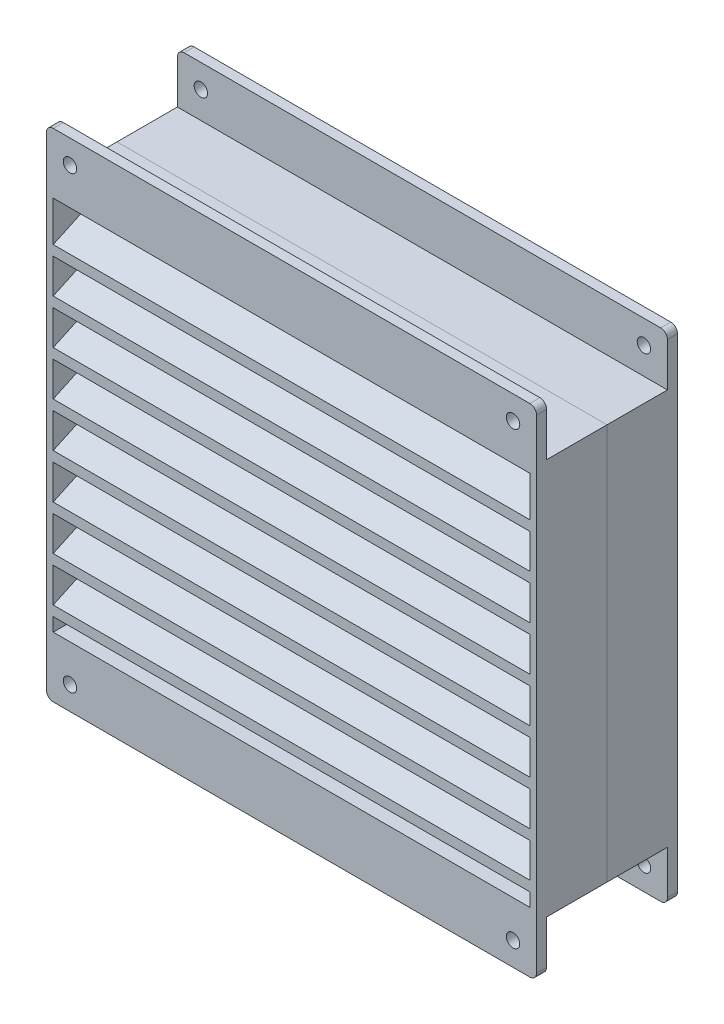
ISO-10303-21;
HEADER;
FILE_DESCRIPTION(('STEP AP214'),'2;1');
FILE_NAME('part.step','',(''),(''),'','','');
FILE_SCHEMA(('AUTOMOTIVE_DESIGN { 1 0 10303 214 1 1 1 1 }'));
ENDSEC;
DATA;
#1=APPLICATION_CONTEXT('core data for automotive mechanical design processes');
#2=APPLICATION_PROTOCOL_DEFINITION('international standard','automotive_design',2000,#1);
#3=PRODUCT_CONTEXT('',#1,'mechanical');
#4=PRODUCT('Part','Part','',(#3));
#5=PRODUCT_RELATED_PRODUCT_CATEGORY('part','',(#4));
#6=PRODUCT_DEFINITION_FORMATION('','',#4);
#7=PRODUCT_DEFINITION_CONTEXT('part definition',#1,'design');
#8=PRODUCT_DEFINITION('design','',#6,#7);
#9=PRODUCT_DEFINITION_SHAPE('','',#8);
#10=(LENGTH_UNIT() NAMED_UNIT(*) SI_UNIT(.MILLI.,.METRE.));
#11=(NAMED_UNIT(*) PLANE_ANGLE_UNIT() SI_UNIT($,.RADIAN.));
#12=(NAMED_UNIT(*) SI_UNIT($,.STERADIAN.) SOLID_ANGLE_UNIT());
#13=UNCERTAINTY_MEASURE_WITH_UNIT(LENGTH_MEASURE(1.E-05),#10,'distance_accuracy_value','');
#14=(GEOMETRIC_REPRESENTATION_CONTEXT(3) GLOBAL_UNCERTAINTY_ASSIGNED_CONTEXT((#13)) GLOBAL_UNIT_ASSIGNED_CONTEXT((#10,
#11,#12)) REPRESENTATION_CONTEXT('',''));
#15=CARTESIAN_POINT('',(0.,0.,0.));
#16=DIRECTION('',(0.,0.,1.));
#17=DIRECTION('',(1.,0.,0.));
#18=AXIS2_PLACEMENT_3D('',#15,#16,#17);
#19=CARTESIAN_POINT('',(146.,118.,-97.0169479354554));
#20=DIRECTION('',(0.,1.,0.));
#21=DIRECTION('',(0.,0.,-1.));
#22=AXIS2_PLACEMENT_3D('',#19,#20,#21);
#23=PLANE('',#22);
#24=DIRECTION('',(0.,0.,1.));
#25=VECTOR('',#24,1.);
#26=CARTESIAN_POINT('',(146.,118.,-97.0169479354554));
#27=LINE('',#26,#25);
#28=CARTESIAN_POINT('',(146.,118.,21.));
#29=VERTEX_POINT('',#28);
#30=CARTESIAN_POINT('',(146.,118.,39.));
#31=VERTEX_POINT('',#30);
#32=EDGE_CURVE('E368',#29,#31,#27,.T.);
#33=ORIENTED_EDGE('',*,*,#32,.F.);
#34=DIRECTION('',(-1.,0.,0.));
#35=VECTOR('',#34,1.);
#36=CARTESIAN_POINT('',(146.,118.,21.));
#37=LINE('',#36,#35);
#38=CARTESIAN_POINT('',(0.,118.,21.));
#39=VERTEX_POINT('',#38);
#40=EDGE_CURVE('E382',#29,#39,#37,.T.);
#41=ORIENTED_EDGE('',*,*,#40,.T.);
#42=DIRECTION('',(0.,0.,-1.));
#43=VECTOR('',#42,1.);
#44=CARTESIAN_POINT('',(0.,118.,42.));
#45=LINE('',#44,#43);
#46=CARTESIAN_POINT('',(0.,118.,39.));
#47=VERTEX_POINT('',#46);
#48=EDGE_CURVE('E370',#47,#39,#45,.T.);
#49=ORIENTED_EDGE('',*,*,#48,.F.);
#50=DIRECTION('',(-1.,0.,0.));
#51=VECTOR('',#50,1.);
#52=CARTESIAN_POINT('',(146.,118.,39.));
#53=LINE('',#52,#51);
#54=EDGE_CURVE('E356',#31,#47,#53,.T.);
#55=ORIENTED_EDGE('',*,*,#54,.F.);
#56=EDGE_LOOP('',(#33,#41,#49,#55));
#57=FACE_BOUND('',#56,.T.);
#58=ADVANCED_FACE('F47',(#57),#23,.T.);
#59=CARTESIAN_POINT('',(144.,118.,-97.0169479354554));
#60=DIRECTION('',(-1.,0.,0.));
#61=DIRECTION('',(0.,-1.,0.));
#62=AXIS2_PLACEMENT_3D('',#59,#60,#61);
#63=PLANE('',#62);
#64=DIRECTION('',(0.,-1.,0.));
#65=VECTOR('',#64,1.);
#66=CARTESIAN_POINT('',(144.,118.,26.9999999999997));
#67=LINE('',#66,#65);
#68=CARTESIAN_POINT('',(144.,109.994614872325,26.9999999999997));
#69=VERTEX_POINT('',#68);
#70=CARTESIAN_POINT('',(144.,106.994614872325,26.9999999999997));
#71=VERTEX_POINT('',#70);
#72=EDGE_CURVE('E564',#69,#71,#67,.T.);
#73=ORIENTED_EDGE('',*,*,#72,.F.);
#74=DIRECTION('',(0.,0.422618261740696,-0.906307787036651));
#75=VECTOR('',#74,1.);
#76=CARTESIAN_POINT('',(144.,158.925673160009,-77.9329931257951));
#77=LINE('',#76,#75);
#78=CARTESIAN_POINT('',(144.,103.,42.));
#79=VERTEX_POINT('',#78);
#80=EDGE_CURVE('E567',#79,#69,#77,.T.);
#81=ORIENTED_EDGE('',*,*,#80,.F.);
#82=DIRECTION('',(0.,1.,0.));
#83=VECTOR('',#82,1.);
#84=CARTESIAN_POINT('',(144.,118.,42.));
#85=LINE('',#84,#83);
#86=CARTESIAN_POINT('',(144.,115.,42.));
#87=VERTEX_POINT('',#86);
#88=EDGE_CURVE('E387',#79,#87,#85,.T.);
#89=ORIENTED_EDGE('',*,*,#88,.T.);
#90=DIRECTION('',(0.,0.,1.));
#91=VECTOR('',#90,1.);
#92=CARTESIAN_POINT('',(144.,115.,-97.0169479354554));
#93=LINE('',#92,#91);
#94=CARTESIAN_POINT('',(144.,115.,21.));
#95=VERTEX_POINT('',#94);
#96=EDGE_CURVE('E418',#95,#87,#93,.T.);
#97=ORIENTED_EDGE('',*,*,#96,.F.);
#98=DIRECTION('',(0.,-1.,0.));
#99=VECTOR('',#98,1.);
#100=CARTESIAN_POINT('',(144.,118.,21.));
#101=LINE('',#100,#99);
#102=CARTESIAN_POINT('',(144.,3.,21.));
#103=VERTEX_POINT('',#102);
#104=EDGE_CURVE('E378',#95,#103,#101,.T.);
#105=ORIENTED_EDGE('',*,*,#104,.T.);
#106=DIRECTION('',(0.,0.,1.));
#107=VECTOR('',#106,1.);
#108=CARTESIAN_POINT('',(144.,3.,42.));
#109=LINE('',#108,#107);
#110=CARTESIAN_POINT('',(144.,3.,42.));
#111=VERTEX_POINT('',#110);
#112=EDGE_CURVE('E390',#103,#111,#109,.T.);
#113=ORIENTED_EDGE('',*,*,#112,.T.);
#114=CARTESIAN_POINT('',(144.,7.00000000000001,42.));
#115=VERTEX_POINT('',#114);
#116=EDGE_CURVE('E379',#111,#115,#85,.T.);
#117=ORIENTED_EDGE('',*,*,#116,.T.);
#118=DIRECTION('',(0.,-0.422618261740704,0.906307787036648));
#119=VECTOR('',#118,1.);
#120=CARTESIAN_POINT('',(144.,80.0718678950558,-114.703126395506));
#121=LINE('',#120,#119);
#122=CARTESIAN_POINT('',(144.,13.9946148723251,27.));
#123=VERTEX_POINT('',#122);
#124=EDGE_CURVE('E711',#123,#115,#121,.T.);
#125=ORIENTED_EDGE('',*,*,#124,.F.);
#126=DIRECTION('',(0.,-1.,0.));
#127=VECTOR('',#126,1.);
#128=CARTESIAN_POINT('',(144.,118.,27.0000000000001));
#129=LINE('',#128,#127);
#130=CARTESIAN_POINT('',(144.,16.9946148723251,27.));
#131=VERTEX_POINT('',#130);
#132=EDGE_CURVE('E714',#131,#123,#129,.T.);
#133=ORIENTED_EDGE('',*,*,#132,.F.);
#134=DIRECTION('',(0.,0.422618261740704,-0.906307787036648));
#135=VECTOR('',#134,1.);
#136=CARTESIAN_POINT('',(144.,82.5360493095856,-113.554059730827));
#137=LINE('',#136,#135);
#138=CARTESIAN_POINT('',(144.,10.,42.));
#139=VERTEX_POINT('',#138);
#140=EDGE_CURVE('E717',#139,#131,#137,.T.);
#141=ORIENTED_EDGE('',*,*,#140,.F.);
#142=CARTESIAN_POINT('',(144.,20.2857142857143,42.));
#143=VERTEX_POINT('',#142);
#144=EDGE_CURVE('E385',#139,#143,#85,.T.);
#145=ORIENTED_EDGE('',*,*,#144,.T.);
#146=DIRECTION('',(0.,-0.422618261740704,0.906307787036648));
#147=VECTOR('',#146,1.);
#148=CARTESIAN_POINT('',(144.,90.9846713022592,-109.614402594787));
#149=LINE('',#148,#147);
#150=CARTESIAN_POINT('',(144.,27.2803291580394,27.));
#151=VERTEX_POINT('',#150);
#152=EDGE_CURVE('E675',#151,#143,#149,.T.);
#153=ORIENTED_EDGE('',*,*,#152,.F.);
#154=DIRECTION('',(0.,-1.,0.));
#155=VECTOR('',#154,1.);
#156=CARTESIAN_POINT('',(144.,118.,27.));
#157=LINE('',#156,#155);
#158=CARTESIAN_POINT('',(144.,30.2803291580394,27.));
#159=VERTEX_POINT('',#158);
#160=EDGE_CURVE('E669',#159,#151,#157,.T.);
#161=ORIENTED_EDGE('',*,*,#160,.F.);
#162=DIRECTION('',(0.,0.422618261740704,-0.906307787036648));
#163=VECTOR('',#162,1.);
#164=CARTESIAN_POINT('',(144.,93.448852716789,-108.465335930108));
#165=LINE('',#164,#163);
#166=CARTESIAN_POINT('',(144.,23.2857142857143,42.));
#167=VERTEX_POINT('',#166);
#168=EDGE_CURVE('E672',#167,#159,#165,.T.);
#169=ORIENTED_EDGE('',*,*,#168,.F.);
#170=CARTESIAN_POINT('',(144.,33.5714285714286,41.9999999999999));
#171=VERTEX_POINT('',#170);
#172=EDGE_CURVE('E1305',#167,#171,#85,.T.);
#173=ORIENTED_EDGE('',*,*,#172,.T.);
#174=DIRECTION('',(0.,-0.422618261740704,0.906307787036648));
#175=VECTOR('',#174,1.);
#176=CARTESIAN_POINT('',(144.,101.897474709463,-104.525678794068));
#177=LINE('',#176,#175);
#178=CARTESIAN_POINT('',(144.,40.5660434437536,26.9999999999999));
#179=VERTEX_POINT('',#178);
#180=EDGE_CURVE('E654',#179,#171,#177,.T.);
#181=ORIENTED_EDGE('',*,*,#180,.F.);
#182=DIRECTION('',(0.,-1.,0.));
#183=VECTOR('',#182,1.);
#184=CARTESIAN_POINT('',(144.,118.,26.9999999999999));
#185=LINE('',#184,#183);
#186=CARTESIAN_POINT('',(144.,43.5660434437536,26.9999999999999));
#187=VERTEX_POINT('',#186);
#188=EDGE_CURVE('E648',#187,#179,#185,.T.);
#189=ORIENTED_EDGE('',*,*,#188,.F.);
#190=DIRECTION('',(0.,0.422618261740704,-0.906307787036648));
#191=VECTOR('',#190,1.);
#192=CARTESIAN_POINT('',(144.,104.361656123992,-103.376612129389));
#193=LINE('',#192,#191);
#194=CARTESIAN_POINT('',(144.,36.5714285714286,41.9999999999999));
#195=VERTEX_POINT('',#194);
#196=EDGE_CURVE('E651',#195,#187,#193,.T.);
#197=ORIENTED_EDGE('',*,*,#196,.F.);
#198=CARTESIAN_POINT('',(144.,46.8571428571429,41.9999999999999));
#199=VERTEX_POINT('',#198);
#200=EDGE_CURVE('E1312',#195,#199,#85,.T.);
#201=ORIENTED_EDGE('',*,*,#200,.T.);
#202=DIRECTION('',(0.,-0.422618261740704,0.906307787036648));
#203=VECTOR('',#202,1.);
#204=CARTESIAN_POINT('',(144.,112.810278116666,-99.4369549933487));
#205=LINE('',#204,#203);
#206=CARTESIAN_POINT('',(144.,53.8517577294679,26.9999999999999));
#207=VERTEX_POINT('',#206);
#208=EDGE_CURVE('E633',#207,#199,#205,.T.);
#209=ORIENTED_EDGE('',*,*,#208,.F.);
#210=DIRECTION('',(0.,-1.,0.));
#211=VECTOR('',#210,1.);
#212=CARTESIAN_POINT('',(144.,118.,26.9999999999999));
#213=LINE('',#212,#211);
#214=CARTESIAN_POINT('',(144.,56.8517577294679,26.9999999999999));
#215=VERTEX_POINT('',#214);
#216=EDGE_CURVE('E627',#215,#207,#213,.T.);
#217=ORIENTED_EDGE('',*,*,#216,.F.);
#218=DIRECTION('',(0.,0.422618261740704,-0.906307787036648));
#219=VECTOR('',#218,1.);
#220=CARTESIAN_POINT('',(144.,115.274459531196,-98.2878883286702));
#221=LINE('',#220,#219);
#222=CARTESIAN_POINT('',(144.,49.8571428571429,41.9999999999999));
#223=VERTEX_POINT('',#222);
#224=EDGE_CURVE('E630',#223,#215,#221,.T.);
#225=ORIENTED_EDGE('',*,*,#224,.F.);
#226=CARTESIAN_POINT('',(144.,60.1428571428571,41.9999999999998));
#227=VERTEX_POINT('',#226);
#228=EDGE_CURVE('E1307',#223,#227,#85,.T.);
#229=ORIENTED_EDGE('',*,*,#228,.T.);
#230=DIRECTION('',(0.,-0.422618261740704,0.906307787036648));
#231=VECTOR('',#230,1.);
#232=CARTESIAN_POINT('',(144.,123.723081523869,-94.3482311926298));
#233=LINE('',#232,#231);
#234=CARTESIAN_POINT('',(144.,67.1374720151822,26.9999999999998));
#235=VERTEX_POINT('',#234);
#236=EDGE_CURVE('E612',#235,#227,#233,.T.);
#237=ORIENTED_EDGE('',*,*,#236,.F.);
#238=DIRECTION('',(0.,-1.,0.));
#239=VECTOR('',#238,1.);
#240=CARTESIAN_POINT('',(144.,118.,26.9999999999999));
#241=LINE('',#240,#239);
#242=CARTESIAN_POINT('',(144.,70.1374720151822,26.9999999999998));
#243=VERTEX_POINT('',#242);
#244=EDGE_CURVE('E606',#243,#235,#241,.T.);
#245=ORIENTED_EDGE('',*,*,#244,.F.);
#246=DIRECTION('',(0.,0.422618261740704,-0.906307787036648));
#247=VECTOR('',#246,1.);
#248=CARTESIAN_POINT('',(144.,126.187262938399,-93.1991645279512));
#249=LINE('',#248,#247);
#250=CARTESIAN_POINT('',(144.,63.1428571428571,41.9999999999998));
#251=VERTEX_POINT('',#250);
#252=EDGE_CURVE('E609',#251,#243,#249,.T.);
#253=ORIENTED_EDGE('',*,*,#252,.F.);
#254=CARTESIAN_POINT('',(144.,73.4285714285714,42.));
#255=VERTEX_POINT('',#254);
#256=EDGE_CURVE('E1300',#251,#255,#85,.T.);
#257=ORIENTED_EDGE('',*,*,#256,.T.);
#258=DIRECTION('',(0.,-0.422618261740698,0.906307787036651));
#259=VECTOR('',#258,1.);
#260=CARTESIAN_POINT('',(144.,134.635884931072,-89.2595073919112));
#261=LINE('',#260,#259);
#262=CARTESIAN_POINT('',(144.,80.4231863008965,26.9999999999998));
#263=VERTEX_POINT('',#262);
#264=EDGE_CURVE('E696',#263,#255,#261,.T.);
#265=ORIENTED_EDGE('',*,*,#264,.F.);
#266=DIRECTION('',(0.,-1.,0.));
#267=VECTOR('',#266,1.);
#268=CARTESIAN_POINT('',(144.,118.,26.9999999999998));
#269=LINE('',#268,#267);
#270=CARTESIAN_POINT('',(144.,83.4231863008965,26.9999999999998));
#271=VERTEX_POINT('',#270);
#272=EDGE_CURVE('E690',#271,#263,#269,.T.);
#273=ORIENTED_EDGE('',*,*,#272,.F.);
#274=DIRECTION('',(0.,0.422618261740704,-0.906307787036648));
#275=VECTOR('',#274,1.);
#276=CARTESIAN_POINT('',(144.,137.100066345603,-88.1104407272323));
#277=LINE('',#276,#275);
#278=CARTESIAN_POINT('',(144.,76.4285714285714,41.9999999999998));
#279=VERTEX_POINT('',#278);
#280=EDGE_CURVE('E693',#279,#271,#277,.T.);
#281=ORIENTED_EDGE('',*,*,#280,.F.);
#282=CARTESIAN_POINT('',(144.,86.7142857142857,41.9999999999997));
#283=VERTEX_POINT('',#282);
#284=EDGE_CURVE('E1299',#279,#283,#85,.T.);
#285=ORIENTED_EDGE('',*,*,#284,.T.);
#286=DIRECTION('',(0.,-0.422618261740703,0.906307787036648));
#287=VECTOR('',#286,1.);
#288=CARTESIAN_POINT('',(144.,145.548688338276,-84.1707835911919));
#289=LINE('',#288,#287);
#290=CARTESIAN_POINT('',(144.,93.7089005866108,26.9999999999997));
#291=VERTEX_POINT('',#290);
#292=EDGE_CURVE('E591',#291,#283,#289,.T.);
#293=ORIENTED_EDGE('',*,*,#292,.F.);
#294=DIRECTION('',(0.,-1.,0.));
#295=VECTOR('',#294,1.);
#296=CARTESIAN_POINT('',(144.,118.,26.9999999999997));
#297=LINE('',#296,#295);
#298=CARTESIAN_POINT('',(144.,96.7089005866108,26.9999999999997));
#299=VERTEX_POINT('',#298);
#300=EDGE_CURVE('E585',#299,#291,#297,.T.);
#301=ORIENTED_EDGE('',*,*,#300,.F.);
#302=DIRECTION('',(0.,0.422618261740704,-0.906307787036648));
#303=VECTOR('',#302,1.);
#304=CARTESIAN_POINT('',(144.,148.012869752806,-83.0217169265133));
#305=LINE('',#304,#303);
#306=CARTESIAN_POINT('',(144.,89.7142857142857,41.9999999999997));
#307=VERTEX_POINT('',#306);
#308=EDGE_CURVE('E588',#307,#299,#305,.T.);
#309=ORIENTED_EDGE('',*,*,#308,.F.);
#310=CARTESIAN_POINT('',(144.,100.,41.9999999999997));
#311=VERTEX_POINT('',#310);
#312=EDGE_CURVE('E1297',#307,#311,#85,.T.);
#313=ORIENTED_EDGE('',*,*,#312,.T.);
#314=DIRECTION('',(0.,-0.422618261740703,0.906307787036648));
#315=VECTOR('',#314,1.);
#316=CARTESIAN_POINT('',(144.,156.461491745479,-79.0820597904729));
#317=LINE('',#316,#315);
#318=EDGE_CURVE('E570',#71,#311,#317,.T.);
#319=ORIENTED_EDGE('',*,*,#318,.F.);
#320=EDGE_LOOP('',(#73,#81,#89,#97,#105,#113,#117,#125,#133,#141,#145,#153,#161,#169,#173,#181,
#189,#197,#201,#209,#217,#225,#229,#237,#245,#253,#257,#265,#273,#281,#285,#293,#301,#309,#313,#319));
#321=FACE_BOUND('',#320,.T.);
#322=ADVANCED_FACE('F767',(#321),#63,.T.);
#323=CARTESIAN_POINT('',(146.,0.,42.));
#324=DIRECTION('',(0.,0.,-1.));
#325=DIRECTION('',(1.,0.,0.));
#326=AXIS2_PLACEMENT_3D('',#323,#324,#325);
#327=PLANE('',#326);
#328=DIRECTION('',(0.,-1.,0.));
#329=VECTOR('',#328,1.);
#330=CARTESIAN_POINT('',(2.,118.,42.));
#331=LINE('',#330,#329);
#332=CARTESIAN_POINT('',(1.99999999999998,7.00000000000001,42.));
#333=VERTEX_POINT('',#332);
#334=CARTESIAN_POINT('',(1.99999999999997,3.,42.));
#335=VERTEX_POINT('',#334);
#336=EDGE_CURVE('E482',#333,#335,#331,.T.);
#337=ORIENTED_EDGE('',*,*,#336,.F.);
#338=DIRECTION('',(-1.,0.,0.));
#339=VECTOR('',#338,1.);
#340=CARTESIAN_POINT('',(146.,7.,42.));
#341=LINE('',#340,#339);
#342=EDGE_CURVE('E699',#115,#333,#341,.T.);
#343=ORIENTED_EDGE('',*,*,#342,.F.);
#344=ORIENTED_EDGE('',*,*,#116,.F.);
#345=DIRECTION('',(-1.,0.,0.));
#346=VECTOR('',#345,1.);
#347=CARTESIAN_POINT('',(146.,3.,42.));
#348=LINE('',#347,#346);
#349=EDGE_CURVE('E415',#111,#335,#348,.T.);
#350=ORIENTED_EDGE('',*,*,#349,.T.);
#351=EDGE_LOOP('',(#337,#343,#344,#350));
#352=FACE_BOUND('',#351,.T.);
#353=CARTESIAN_POINT('',(1.99999999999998,20.2857142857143,42.));
#354=VERTEX_POINT('',#353);
#355=CARTESIAN_POINT('',(1.99999999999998,10.,42.));
#356=VERTEX_POINT('',#355);
#357=EDGE_CURVE('E492',#354,#356,#331,.T.);
#358=ORIENTED_EDGE('',*,*,#357,.F.);
#359=DIRECTION('',(-1.,0.,0.));
#360=VECTOR('',#359,1.);
#361=CARTESIAN_POINT('',(146.,20.2857142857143,42.));
#362=LINE('',#361,#360);
#363=EDGE_CURVE('E666',#143,#354,#362,.T.);
#364=ORIENTED_EDGE('',*,*,#363,.F.);
#365=ORIENTED_EDGE('',*,*,#144,.F.);
#366=DIRECTION('',(-1.,0.,0.));
#367=VECTOR('',#366,1.);
#368=CARTESIAN_POINT('',(146.,10.,42.));
#369=LINE('',#368,#367);
#370=EDGE_CURVE('E708',#139,#356,#369,.T.);
#371=ORIENTED_EDGE('',*,*,#370,.T.);
#372=EDGE_LOOP('',(#358,#364,#365,#371));
#373=FACE_BOUND('',#372,.T.);
#374=CARTESIAN_POINT('',(1.99999999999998,33.5714285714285,42.));
#375=VERTEX_POINT('',#374);
#376=CARTESIAN_POINT('',(1.99999999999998,23.2857142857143,42.));
#377=VERTEX_POINT('',#376);
#378=EDGE_CURVE('E1338',#375,#377,#331,.T.);
#379=ORIENTED_EDGE('',*,*,#378,.F.);
#380=DIRECTION('',(-1.,0.,0.));
#381=VECTOR('',#380,1.);
#382=CARTESIAN_POINT('',(146.,33.5714285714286,41.9999999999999));
#383=LINE('',#382,#381);
#384=EDGE_CURVE('E645',#171,#375,#383,.T.);
#385=ORIENTED_EDGE('',*,*,#384,.F.);
#386=ORIENTED_EDGE('',*,*,#172,.F.);
#387=DIRECTION('',(-1.,0.,0.));
#388=VECTOR('',#387,1.);
#389=CARTESIAN_POINT('',(146.,23.2857142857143,42.));
#390=LINE('',#389,#388);
#391=EDGE_CURVE('E663',#167,#377,#390,.T.);
#392=ORIENTED_EDGE('',*,*,#391,.T.);
#393=EDGE_LOOP('',(#379,#385,#386,#392));
#394=FACE_BOUND('',#393,.T.);
#395=CARTESIAN_POINT('',(1.99999999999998,46.8571428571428,42.));
#396=VERTEX_POINT('',#395);
#397=CARTESIAN_POINT('',(1.99999999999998,36.5714285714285,42.));
#398=VERTEX_POINT('',#397);
#399=EDGE_CURVE('E1344',#396,#398,#331,.T.);
#400=ORIENTED_EDGE('',*,*,#399,.F.);
#401=DIRECTION('',(-1.,0.,0.));
#402=VECTOR('',#401,1.);
#403=CARTESIAN_POINT('',(146.,46.8571428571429,41.9999999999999));
#404=LINE('',#403,#402);
#405=EDGE_CURVE('E624',#199,#396,#404,.T.);
#406=ORIENTED_EDGE('',*,*,#405,.F.);
#407=ORIENTED_EDGE('',*,*,#200,.F.);
#408=DIRECTION('',(-1.,0.,0.));
#409=VECTOR('',#408,1.);
#410=CARTESIAN_POINT('',(146.,36.5714285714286,41.9999999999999));
#411=LINE('',#410,#409);
#412=EDGE_CURVE('E642',#195,#398,#411,.T.);
#413=ORIENTED_EDGE('',*,*,#412,.T.);
#414=EDGE_LOOP('',(#400,#406,#407,#413));
#415=FACE_BOUND('',#414,.T.);
#416=CARTESIAN_POINT('',(1.99999999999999,60.1428571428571,42.));
#417=VERTEX_POINT('',#416);
#418=CARTESIAN_POINT('',(1.99999999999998,49.8571428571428,42.));
#419=VERTEX_POINT('',#418);
#420=EDGE_CURVE('E1350',#417,#419,#331,.T.);
#421=ORIENTED_EDGE('',*,*,#420,.F.);
#422=DIRECTION('',(-1.,0.,0.));
#423=VECTOR('',#422,1.);
#424=CARTESIAN_POINT('',(146.,60.1428571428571,41.9999999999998));
#425=LINE('',#424,#423);
#426=EDGE_CURVE('E603',#227,#417,#425,.T.);
#427=ORIENTED_EDGE('',*,*,#426,.F.);
#428=ORIENTED_EDGE('',*,*,#228,.F.);
#429=DIRECTION('',(-1.,0.,0.));
#430=VECTOR('',#429,1.);
#431=CARTESIAN_POINT('',(146.,49.8571428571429,41.9999999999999));
#432=LINE('',#431,#430);
#433=EDGE_CURVE('E621',#223,#419,#432,.T.);
#434=ORIENTED_EDGE('',*,*,#433,.T.);
#435=EDGE_LOOP('',(#421,#427,#428,#434));
#436=FACE_BOUND('',#435,.T.);
#437=CARTESIAN_POINT('',(1.99999999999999,73.4285714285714,42.));
#438=VERTEX_POINT('',#437);
#439=CARTESIAN_POINT('',(1.99999999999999,63.1428571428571,42.));
#440=VERTEX_POINT('',#439);
#441=EDGE_CURVE('E1356',#438,#440,#331,.T.);
#442=ORIENTED_EDGE('',*,*,#441,.F.);
#443=DIRECTION('',(-1.,0.,0.));
#444=VECTOR('',#443,1.);
#445=CARTESIAN_POINT('',(146.,73.4285714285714,42.));
#446=LINE('',#445,#444);
#447=EDGE_CURVE('E687',#255,#438,#446,.T.);
#448=ORIENTED_EDGE('',*,*,#447,.F.);
#449=ORIENTED_EDGE('',*,*,#256,.F.);
#450=DIRECTION('',(-1.,0.,0.));
#451=VECTOR('',#450,1.);
#452=CARTESIAN_POINT('',(146.,63.1428571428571,41.9999999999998));
#453=LINE('',#452,#451);
#454=EDGE_CURVE('E600',#251,#440,#453,.T.);
#455=ORIENTED_EDGE('',*,*,#454,.T.);
#456=EDGE_LOOP('',(#442,#448,#449,#455));
#457=FACE_BOUND('',#456,.T.);
#458=CARTESIAN_POINT('',(1.99999999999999,86.7142857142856,42.));
#459=VERTEX_POINT('',#458);
#460=CARTESIAN_POINT('',(1.99999999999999,76.4285714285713,42.));
#461=VERTEX_POINT('',#460);
#462=EDGE_CURVE('E1373',#459,#461,#331,.T.);
#463=ORIENTED_EDGE('',*,*,#462,.F.);
#464=DIRECTION('',(-1.,0.,0.));
#465=VECTOR('',#464,1.);
#466=CARTESIAN_POINT('',(146.,86.7142857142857,41.9999999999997));
#467=LINE('',#466,#465);
#468=EDGE_CURVE('E582',#283,#459,#467,.T.);
#469=ORIENTED_EDGE('',*,*,#468,.F.);
#470=ORIENTED_EDGE('',*,*,#284,.F.);
#471=DIRECTION('',(-1.,0.,0.));
#472=VECTOR('',#471,1.);
#473=CARTESIAN_POINT('',(146.,76.4285714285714,41.9999999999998));
#474=LINE('',#473,#472);
#475=EDGE_CURVE('E684',#279,#461,#474,.T.);
#476=ORIENTED_EDGE('',*,*,#475,.T.);
#477=EDGE_LOOP('',(#463,#469,#470,#476));
#478=FACE_BOUND('',#477,.T.);
#479=CARTESIAN_POINT('',(2.,99.9999999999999,42.));
#480=VERTEX_POINT('',#479);
#481=CARTESIAN_POINT('',(1.99999999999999,89.7142857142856,42.));
#482=VERTEX_POINT('',#481);
#483=EDGE_CURVE('E1369',#480,#482,#331,.T.);
#484=ORIENTED_EDGE('',*,*,#483,.F.);
#485=DIRECTION('',(-1.,0.,0.));
#486=VECTOR('',#485,1.);
#487=CARTESIAN_POINT('',(146.,100.,41.9999999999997));
#488=LINE('',#487,#486);
#489=EDGE_CURVE('E561',#311,#480,#488,.T.);
#490=ORIENTED_EDGE('',*,*,#489,.F.);
#491=ORIENTED_EDGE('',*,*,#312,.F.);
#492=DIRECTION('',(-1.,0.,0.));
#493=VECTOR('',#492,1.);
#494=CARTESIAN_POINT('',(146.,89.7142857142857,41.9999999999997));
#495=LINE('',#494,#493);
#496=EDGE_CURVE('E579',#307,#482,#495,.T.);
#497=ORIENTED_EDGE('',*,*,#496,.T.);
#498=EDGE_LOOP('',(#484,#490,#491,#497));
#499=FACE_BOUND('',#498,.T.);
#500=CARTESIAN_POINT('',(2.,115.,42.));
#501=VERTEX_POINT('',#500);
#502=CARTESIAN_POINT('',(2.,103.,42.));
#503=VERTEX_POINT('',#502);
#504=EDGE_CURVE('E489',#501,#503,#331,.T.);
#505=ORIENTED_EDGE('',*,*,#504,.F.);
#506=DIRECTION('',(-1.,0.,0.));
#507=VECTOR('',#506,1.);
#508=CARTESIAN_POINT('',(146.,115.,42.));
#509=LINE('',#508,#507);
#510=EDGE_CURVE('E721',#87,#501,#509,.T.);
#511=ORIENTED_EDGE('',*,*,#510,.F.);
#512=ORIENTED_EDGE('',*,*,#88,.F.);
#513=DIRECTION('',(-1.,0.,0.));
#514=VECTOR('',#513,1.);
#515=CARTESIAN_POINT('',(146.,103.,42.));
#516=LINE('',#515,#514);
#517=EDGE_CURVE('E558',#79,#503,#516,.T.);
#518=ORIENTED_EDGE('',*,*,#517,.T.);
#519=EDGE_LOOP('',(#505,#511,#512,#518));
#520=FACE_BOUND('',#519,.T.);
#521=DIRECTION('',(0.,1.,0.));
#522=VECTOR('',#521,1.);
#523=CARTESIAN_POINT('',(0.,0.,42.));
#524=LINE('',#523,#522);
#525=CARTESIAN_POINT('',(0.,-13.,42.));
#526=VERTEX_POINT('',#525);
#527=CARTESIAN_POINT('',(0.,131.,42.));
#528=VERTEX_POINT('',#527);
#529=EDGE_CURVE('E393',#526,#528,#524,.T.);
#530=ORIENTED_EDGE('',*,*,#529,.F.);
#531=CARTESIAN_POINT('',(2.,-13.,42.));
#532=DIRECTION('',(0.,0.,1.));
#533=DIRECTION('',(1.,0.,0.));
#534=AXIS2_PLACEMENT_3D('',#531,#532,#533);
#535=CIRCLE('',#534,2.);
#536=CARTESIAN_POINT('',(2.,-15.,42.));
#537=VERTEX_POINT('',#536);
#538=EDGE_CURVE('E433',#537,#526,#535,.F.);
#539=ORIENTED_EDGE('',*,*,#538,.F.);
#540=DIRECTION('',(-1.,0.,0.));
#541=VECTOR('',#540,1.);
#542=CARTESIAN_POINT('',(146.,-15.,42.));
#543=LINE('',#542,#541);
#544=CARTESIAN_POINT('',(144.,-15.,42.));
#545=VERTEX_POINT('',#544);
#546=EDGE_CURVE('E464',#545,#537,#543,.T.);
#547=ORIENTED_EDGE('',*,*,#546,.F.);
#548=CARTESIAN_POINT('',(144.,-13.,42.));
#549=DIRECTION('',(0.,0.,1.));
#550=DIRECTION('',(1.,0.,0.));
#551=AXIS2_PLACEMENT_3D('',#548,#549,#550);
#552=CIRCLE('',#551,2.);
#553=CARTESIAN_POINT('',(146.,-13.,42.));
#554=VERTEX_POINT('',#553);
#555=EDGE_CURVE('E430',#554,#545,#552,.F.);
#556=ORIENTED_EDGE('',*,*,#555,.F.);
#557=DIRECTION('',(0.,1.,0.));
#558=VECTOR('',#557,1.);
#559=CARTESIAN_POINT('',(146.,0.,42.));
#560=LINE('',#559,#558);
#561=CARTESIAN_POINT('',(146.,131.,42.));
#562=VERTEX_POINT('',#561);
#563=EDGE_CURVE('E394',#554,#562,#560,.T.);
#564=ORIENTED_EDGE('',*,*,#563,.T.);
#565=CARTESIAN_POINT('',(144.,131.,42.));
#566=DIRECTION('',(0.,0.,1.));
#567=DIRECTION('',(1.,0.,0.));
#568=AXIS2_PLACEMENT_3D('',#565,#566,#567);
#569=CIRCLE('',#568,2.);
#570=CARTESIAN_POINT('',(144.,133.,42.));
#571=VERTEX_POINT('',#570);
#572=EDGE_CURVE('E427',#571,#562,#569,.F.);
#573=ORIENTED_EDGE('',*,*,#572,.F.);
#574=DIRECTION('',(1.,0.,0.));
#575=VECTOR('',#574,1.);
#576=CARTESIAN_POINT('',(146.,133.,42.));
#577=LINE('',#576,#575);
#578=CARTESIAN_POINT('',(2.,133.,42.));
#579=VERTEX_POINT('',#578);
#580=EDGE_CURVE('E372',#579,#571,#577,.T.);
#581=ORIENTED_EDGE('',*,*,#580,.F.);
#582=CARTESIAN_POINT('',(2.,131.,42.));
#583=DIRECTION('',(0.,0.,1.));
#584=DIRECTION('',(1.,0.,0.));
#585=AXIS2_PLACEMENT_3D('',#582,#583,#584);
#586=CIRCLE('',#585,2.);
#587=EDGE_CURVE('E436',#528,#579,#586,.F.);
#588=ORIENTED_EDGE('',*,*,#587,.F.);
#589=EDGE_LOOP('',(#530,#539,#547,#556,#564,#573,#581,#588));
#590=FACE_BOUND('',#589,.T.);
#591=CARTESIAN_POINT('',(7.00000000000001,-8.,42.));
#592=DIRECTION('',(0.,0.,-1.));
#593=DIRECTION('',(1.,0.,0.));
#594=AXIS2_PLACEMENT_3D('',#591,#592,#593);
#595=CIRCLE('',#594,2.);
#596=CARTESIAN_POINT('',(9.00000000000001,-8.,42.));
#597=VERTEX_POINT('',#596);
#598=EDGE_CURVE('E362',#597,#597,#595,.T.);
#599=ORIENTED_EDGE('',*,*,#598,.T.);
#600=EDGE_LOOP('',(#599));
#601=FACE_BOUND('',#600,.T.);
#602=CARTESIAN_POINT('',(139.,-8.,42.));
#603=DIRECTION('',(0.,0.,-1.));
#604=DIRECTION('',(-1.,0.,0.));
#605=AXIS2_PLACEMENT_3D('',#602,#603,#604);
#606=CIRCLE('',#605,2.);
#607=CARTESIAN_POINT('',(137.,-8.,42.));
#608=VERTEX_POINT('',#607);
#609=EDGE_CURVE('E742',#608,#608,#606,.T.);
#610=ORIENTED_EDGE('',*,*,#609,.T.);
#611=EDGE_LOOP('',(#610));
#612=FACE_BOUND('',#611,.T.);
#613=CARTESIAN_POINT('',(139.,126.,42.));
#614=DIRECTION('',(0.,0.,-1.));
#615=DIRECTION('',(1.,0.,0.));
#616=AXIS2_PLACEMENT_3D('',#613,#614,#615);
#617=CIRCLE('',#616,2.);
#618=CARTESIAN_POINT('',(141.,126.,42.));
#619=VERTEX_POINT('',#618);
#620=EDGE_CURVE('E1393',#619,#619,#617,.T.);
#621=ORIENTED_EDGE('',*,*,#620,.T.);
#622=EDGE_LOOP('',(#621));
#623=FACE_BOUND('',#622,.T.);
#624=CARTESIAN_POINT('',(7.00000000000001,126.,42.));
#625=DIRECTION('',(0.,0.,-1.));
#626=DIRECTION('',(-1.,0.,0.));
#627=AXIS2_PLACEMENT_3D('',#624,#625,#626);
#628=CIRCLE('',#627,2.);
#629=CARTESIAN_POINT('',(5.00000000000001,126.,42.));
#630=VERTEX_POINT('',#629);
#631=EDGE_CURVE('E1389',#630,#630,#628,.T.);
#632=ORIENTED_EDGE('',*,*,#631,.T.);
#633=EDGE_LOOP('',(#632));
#634=FACE_BOUND('',#633,.T.);
#635=ADVANCED_FACE('F460',(#352,#373,#394,#415,#436,#457,#478,#499,#520,#590,#601,#612,#623,
#634),#327,.F.);
#636=CARTESIAN_POINT('',(146.,3.,42.));
#637=DIRECTION('',(0.,-1.,0.));
#638=DIRECTION('',(0.,0.,1.));
#639=AXIS2_PLACEMENT_3D('',#636,#637,#638);
#640=PLANE('',#639);
#641=ORIENTED_EDGE('',*,*,#349,.F.);
#642=ORIENTED_EDGE('',*,*,#112,.F.);
#643=DIRECTION('',(-1.,0.,0.));
#644=VECTOR('',#643,1.);
#645=CARTESIAN_POINT('',(146.,3.,21.));
#646=LINE('',#645,#644);
#647=CARTESIAN_POINT('',(1.99999999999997,3.,21.));
#648=VERTEX_POINT('',#647);
#649=EDGE_CURVE('E412',#103,#648,#646,.T.);
#650=ORIENTED_EDGE('',*,*,#649,.T.);
#651=DIRECTION('',(0.,0.,-1.));
#652=VECTOR('',#651,1.);
#653=CARTESIAN_POINT('',(1.99999999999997,3.,42.));
#654=LINE('',#653,#652);
#655=EDGE_CURVE('E549',#335,#648,#654,.T.);
#656=ORIENTED_EDGE('',*,*,#655,.F.);
#657=EDGE_LOOP('',(#641,#642,#650,#656));
#658=FACE_BOUND('',#657,.T.);
#659=ADVANCED_FACE('F788',(#658),#640,.F.);
#660=CARTESIAN_POINT('',(146.,0.,21.));
#661=DIRECTION('',(0.,0.,1.));
#662=DIRECTION('',(-1.,0.,0.));
#663=AXIS2_PLACEMENT_3D('',#660,#661,#662);
#664=PLANE('',#663);
#665=ORIENTED_EDGE('',*,*,#649,.F.);
#666=ORIENTED_EDGE('',*,*,#104,.F.);
#667=DIRECTION('',(-1.,0.,0.));
#668=VECTOR('',#667,1.);
#669=CARTESIAN_POINT('',(146.,115.,21.));
#670=LINE('',#669,#668);
#671=CARTESIAN_POINT('',(2.,115.,21.));
#672=VERTEX_POINT('',#671);
#673=EDGE_CURVE('E724',#95,#672,#670,.T.);
#674=ORIENTED_EDGE('',*,*,#673,.T.);
#675=DIRECTION('',(0.,1.,0.));
#676=VECTOR('',#675,1.);
#677=CARTESIAN_POINT('',(2.,118.,21.));
#678=LINE('',#677,#676);
#679=EDGE_CURVE('E485',#648,#672,#678,.T.);
#680=ORIENTED_EDGE('',*,*,#679,.F.);
#681=EDGE_LOOP('',(#665,#666,#674,#680));
#682=FACE_BOUND('',#681,.T.);
#683=ORIENTED_EDGE('',*,*,#40,.F.);
#684=DIRECTION('',(0.,-1.,0.));
#685=VECTOR('',#684,1.);
#686=CARTESIAN_POINT('',(146.,0.,21.));
#687=LINE('',#686,#685);
#688=CARTESIAN_POINT('',(146.,0.,21.));
#689=VERTEX_POINT('',#688);
#690=EDGE_CURVE('E376',#29,#689,#687,.T.);
#691=ORIENTED_EDGE('',*,*,#690,.T.);
#692=DIRECTION('',(-1.,0.,0.));
#693=VECTOR('',#692,1.);
#694=CARTESIAN_POINT('',(146.,0.,21.));
#695=LINE('',#694,#693);
#696=CARTESIAN_POINT('',(0.,0.,21.));
#697=VERTEX_POINT('',#696);
#698=EDGE_CURVE('E402',#689,#697,#695,.T.);
#699=ORIENTED_EDGE('',*,*,#698,.T.);
#700=DIRECTION('',(0.,-1.,0.));
#701=VECTOR('',#700,1.);
#702=CARTESIAN_POINT('',(0.,0.,21.));
#703=LINE('',#702,#701);
#704=EDGE_CURVE('E405',#39,#697,#703,.T.);
#705=ORIENTED_EDGE('',*,*,#704,.F.);
#706=EDGE_LOOP('',(#683,#691,#699,#705));
#707=FACE_BOUND('',#706,.T.);
#708=ADVANCED_FACE('F727',(#682,#707),#664,.F.);
#709=CARTESIAN_POINT('',(146.,0.,42.));
#710=DIRECTION('',(0.,1.,0.));
#711=DIRECTION('',(0.,0.,-1.));
#712=AXIS2_PLACEMENT_3D('',#709,#710,#711);
#713=PLANE('',#712);
#714=DIRECTION('',(0.,0.,1.));
#715=VECTOR('',#714,1.);
#716=CARTESIAN_POINT('',(0.,0.,42.));
#717=LINE('',#716,#715);
#718=CARTESIAN_POINT('',(0.,0.,39.));
#719=VERTEX_POINT('',#718);
#720=EDGE_CURVE('E397',#697,#719,#717,.T.);
#721=ORIENTED_EDGE('',*,*,#720,.F.);
#722=ORIENTED_EDGE('',*,*,#698,.F.);
#723=DIRECTION('',(0.,0.,1.));
#724=VECTOR('',#723,1.);
#725=CARTESIAN_POINT('',(146.,0.,42.));
#726=LINE('',#725,#724);
#727=CARTESIAN_POINT('',(146.,0.,39.));
#728=VERTEX_POINT('',#727);
#729=EDGE_CURVE('E399',#689,#728,#726,.T.);
#730=ORIENTED_EDGE('',*,*,#729,.T.);
#731=DIRECTION('',(1.,0.,0.));
#732=VECTOR('',#731,1.);
#733=CARTESIAN_POINT('',(146.,0.,39.));
#734=LINE('',#733,#732);
#735=EDGE_CURVE('E475',#719,#728,#734,.T.);
#736=ORIENTED_EDGE('',*,*,#735,.F.);
#737=EDGE_LOOP('',(#721,#722,#730,#736));
#738=FACE_BOUND('',#737,.T.);
#739=ADVANCED_FACE('F780',(#738),#713,.F.);
#740=CARTESIAN_POINT('',(146.,0.,42.));
#741=DIRECTION('',(1.,0.,0.));
#742=DIRECTION('',(0.,0.,1.));
#743=AXIS2_PLACEMENT_3D('',#740,#741,#742);
#744=PLANE('',#743);
#745=DIRECTION('',(0.,-1.,0.));
#746=VECTOR('',#745,1.);
#747=CARTESIAN_POINT('',(146.,0.,39.));
#748=LINE('',#747,#746);
#749=CARTESIAN_POINT('',(146.,-13.,39.));
#750=VERTEX_POINT('',#749);
#751=EDGE_CURVE('E473',#728,#750,#748,.T.);
#752=ORIENTED_EDGE('',*,*,#751,.F.);
#753=ORIENTED_EDGE('',*,*,#729,.F.);
#754=ORIENTED_EDGE('',*,*,#690,.F.);
#755=ORIENTED_EDGE('',*,*,#32,.T.);
#756=DIRECTION('',(0.,-1.,0.));
#757=VECTOR('',#756,1.);
#758=CARTESIAN_POINT('',(146.,118.,39.));
#759=LINE('',#758,#757);
#760=CARTESIAN_POINT('',(146.,131.,39.));
#761=VERTEX_POINT('',#760);
#762=EDGE_CURVE('E351',#761,#31,#759,.T.);
#763=ORIENTED_EDGE('',*,*,#762,.F.);
#764=DIRECTION('',(0.,0.,1.));
#765=VECTOR('',#764,1.);
#766=CARTESIAN_POINT('',(146.,131.,42.));
#767=LINE('',#766,#765);
#768=EDGE_CURVE('E55',#562,#761,#767,.F.);
#769=ORIENTED_EDGE('',*,*,#768,.F.);
#770=ORIENTED_EDGE('',*,*,#563,.F.);
#771=DIRECTION('',(0.,0.,1.));
#772=VECTOR('',#771,1.);
#773=CARTESIAN_POINT('',(146.,-13.,42.));
#774=LINE('',#773,#772);
#775=EDGE_CURVE('E12',#750,#554,#774,.T.);
#776=ORIENTED_EDGE('',*,*,#775,.F.);
#777=EDGE_LOOP('',(#752,#753,#754,#755,#763,#769,#770,#776));
#778=FACE_BOUND('',#777,.T.);
#779=ADVANCED_FACE('F374',(#778),#744,.T.);
#780=CARTESIAN_POINT('',(0.,0.,42.));
#781=DIRECTION('',(1.,0.,0.));
#782=DIRECTION('',(0.,0.,1.));
#783=AXIS2_PLACEMENT_3D('',#780,#781,#782);
#784=PLANE('',#783);
#785=DIRECTION('',(0.,1.,0.));
#786=VECTOR('',#785,1.);
#787=CARTESIAN_POINT('',(0.,118.,39.));
#788=LINE('',#787,#786);
#789=CARTESIAN_POINT('',(0.,131.,39.));
#790=VERTEX_POINT('',#789);
#791=EDGE_CURVE('E371',#47,#790,#788,.T.);
#792=ORIENTED_EDGE('',*,*,#791,.F.);
#793=ORIENTED_EDGE('',*,*,#48,.T.);
#794=ORIENTED_EDGE('',*,*,#704,.T.);
#795=ORIENTED_EDGE('',*,*,#720,.T.);
#796=DIRECTION('',(0.,1.,0.));
#797=VECTOR('',#796,1.);
#798=CARTESIAN_POINT('',(0.,0.,39.));
#799=LINE('',#798,#797);
#800=CARTESIAN_POINT('',(0.,-13.,39.));
#801=VERTEX_POINT('',#800);
#802=EDGE_CURVE('E472',#801,#719,#799,.T.);
#803=ORIENTED_EDGE('',*,*,#802,.F.);
#804=DIRECTION('',(0.,0.,1.));
#805=VECTOR('',#804,1.);
#806=CARTESIAN_POINT('',(0.,-13.,39.));
#807=LINE('',#806,#805);
#808=EDGE_CURVE('E423',#526,#801,#807,.F.);
#809=ORIENTED_EDGE('',*,*,#808,.F.);
#810=ORIENTED_EDGE('',*,*,#529,.T.);
#811=DIRECTION('',(0.,0.,1.));
#812=VECTOR('',#811,1.);
#813=CARTESIAN_POINT('',(0.,131.,42.));
#814=LINE('',#813,#812);
#815=EDGE_CURVE('E425',#790,#528,#814,.T.);
#816=ORIENTED_EDGE('',*,*,#815,.F.);
#817=EDGE_LOOP('',(#792,#793,#794,#795,#803,#809,#810,#816));
#818=FACE_BOUND('',#817,.T.);
#819=ADVANCED_FACE('F730',(#818),#784,.F.);
#820=CARTESIAN_POINT('',(146.,115.,42.));
#821=DIRECTION('',(0.,1.,0.));
#822=DIRECTION('',(0.,0.,-1.));
#823=AXIS2_PLACEMENT_3D('',#820,#821,#822);
#824=PLANE('',#823);
#825=ORIENTED_EDGE('',*,*,#673,.F.);
#826=ORIENTED_EDGE('',*,*,#96,.T.);
#827=ORIENTED_EDGE('',*,*,#510,.T.);
#828=DIRECTION('',(0.,0.,1.));
#829=VECTOR('',#828,1.);
#830=CARTESIAN_POINT('',(2.,115.,42.));
#831=LINE('',#830,#829);
#832=EDGE_CURVE('E547',#672,#501,#831,.T.);
#833=ORIENTED_EDGE('',*,*,#832,.F.);
#834=EDGE_LOOP('',(#825,#826,#827,#833));
#835=FACE_BOUND('',#834,.T.);
#836=ADVANCED_FACE('F775',(#835),#824,.F.);
#837=CARTESIAN_POINT('',(146.,16.9946148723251,27.));
#838=DIRECTION('',(0.,-0.906307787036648,-0.422618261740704));
#839=DIRECTION('',(0.,-0.422618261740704,0.906307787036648));
#840=AXIS2_PLACEMENT_3D('',#837,#838,#839);
#841=PLANE('',#840);
#842=ORIENTED_EDGE('',*,*,#370,.F.);
#843=ORIENTED_EDGE('',*,*,#140,.T.);
#844=DIRECTION('',(-1.,0.,0.));
#845=VECTOR('',#844,1.);
#846=CARTESIAN_POINT('',(146.,16.9946148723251,27.));
#847=LINE('',#846,#845);
#848=CARTESIAN_POINT('',(1.99999999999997,16.9946148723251,27.));
#849=VERTEX_POINT('',#848);
#850=EDGE_CURVE('E705',#131,#849,#847,.T.);
#851=ORIENTED_EDGE('',*,*,#850,.T.);
#852=DIRECTION('',(0.,0.422618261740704,-0.906307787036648));
#853=VECTOR('',#852,1.);
#854=CARTESIAN_POINT('',(1.99999999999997,16.9946148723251,27.));
#855=LINE('',#854,#853);
#856=EDGE_CURVE('E544',#356,#849,#855,.T.);
#857=ORIENTED_EDGE('',*,*,#856,.F.);
#858=EDGE_LOOP('',(#842,#843,#851,#857));
#859=FACE_BOUND('',#858,.T.);
#860=ADVANCED_FACE('F1126',(#859),#841,.F.);
#861=CARTESIAN_POINT('',(146.,13.9946148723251,27.));
#862=DIRECTION('',(0.,0.,1.));
#863=DIRECTION('',(0.,1.,0.));
#864=AXIS2_PLACEMENT_3D('',#861,#862,#863);
#865=PLANE('',#864);
#866=ORIENTED_EDGE('',*,*,#850,.F.);
#867=ORIENTED_EDGE('',*,*,#132,.T.);
#868=DIRECTION('',(-1.,0.,0.));
#869=VECTOR('',#868,1.);
#870=CARTESIAN_POINT('',(146.,13.9946148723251,27.));
#871=LINE('',#870,#869);
#872=CARTESIAN_POINT('',(1.99999999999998,13.9946148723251,27.));
#873=VERTEX_POINT('',#872);
#874=EDGE_CURVE('E702',#123,#873,#871,.T.);
#875=ORIENTED_EDGE('',*,*,#874,.T.);
#876=DIRECTION('',(0.,-1.,0.));
#877=VECTOR('',#876,1.);
#878=CARTESIAN_POINT('',(1.99999999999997,13.9946148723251,27.));
#879=LINE('',#878,#877);
#880=EDGE_CURVE('E541',#849,#873,#879,.T.);
#881=ORIENTED_EDGE('',*,*,#880,.F.);
#882=EDGE_LOOP('',(#866,#867,#875,#881));
#883=FACE_BOUND('',#882,.T.);
#884=ADVANCED_FACE('F1116',(#883),#865,.F.);
#885=CARTESIAN_POINT('',(146.,7.,42.));
#886=DIRECTION('',(0.,0.906307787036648,0.422618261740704));
#887=DIRECTION('',(0.,0.422618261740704,-0.906307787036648));
#888=AXIS2_PLACEMENT_3D('',#885,#886,#887);
#889=PLANE('',#888);
#890=ORIENTED_EDGE('',*,*,#874,.F.);
#891=ORIENTED_EDGE('',*,*,#124,.T.);
#892=ORIENTED_EDGE('',*,*,#342,.T.);
#893=DIRECTION('',(0.,-0.422618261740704,0.906307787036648));
#894=VECTOR('',#893,1.);
#895=CARTESIAN_POINT('',(1.99999999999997,7.00000000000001,42.));
#896=LINE('',#895,#894);
#897=EDGE_CURVE('E539',#873,#333,#896,.T.);
#898=ORIENTED_EDGE('',*,*,#897,.F.);
#899=EDGE_LOOP('',(#890,#891,#892,#898));
#900=FACE_BOUND('',#899,.T.);
#901=ADVANCED_FACE('F1106',(#900),#889,.F.);
#902=CARTESIAN_POINT('',(146.,73.4285714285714,42.));
#903=DIRECTION('',(0.,0.90630778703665,0.422618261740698));
#904=DIRECTION('',(0.,0.422618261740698,-0.906307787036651));
#905=AXIS2_PLACEMENT_3D('',#902,#903,#904);
#906=PLANE('',#905);
#907=DIRECTION('',(-1.,0.,0.));
#908=VECTOR('',#907,1.);
#909=CARTESIAN_POINT('',(146.,80.4231863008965,26.9999999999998));
#910=LINE('',#909,#908);
#911=CARTESIAN_POINT('',(2.,80.4231863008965,26.9999999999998));
#912=VERTEX_POINT('',#911);
#913=EDGE_CURVE('E678',#263,#912,#910,.T.);
#914=ORIENTED_EDGE('',*,*,#913,.F.);
#915=ORIENTED_EDGE('',*,*,#264,.T.);
#916=ORIENTED_EDGE('',*,*,#447,.T.);
#917=DIRECTION('',(0.,-0.422618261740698,0.906307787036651));
#918=VECTOR('',#917,1.);
#919=CARTESIAN_POINT('',(2.,73.4285714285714,42.));
#920=LINE('',#919,#918);
#921=EDGE_CURVE('E537',#912,#438,#920,.T.);
#922=ORIENTED_EDGE('',*,*,#921,.F.);
#923=EDGE_LOOP('',(#914,#915,#916,#922));
#924=FACE_BOUND('',#923,.T.);
#925=ADVANCED_FACE('F1096',(#924),#906,.F.);
#926=CARTESIAN_POINT('',(146.,83.4231863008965,26.9999999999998));
#927=DIRECTION('',(0.,-0.906307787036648,-0.422618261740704));
#928=DIRECTION('',(0.,-0.422618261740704,0.906307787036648));
#929=AXIS2_PLACEMENT_3D('',#926,#927,#928);
#930=PLANE('',#929);
#931=ORIENTED_EDGE('',*,*,#475,.F.);
#932=ORIENTED_EDGE('',*,*,#280,.T.);
#933=DIRECTION('',(-1.,0.,0.));
#934=VECTOR('',#933,1.);
#935=CARTESIAN_POINT('',(146.,83.4231863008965,26.9999999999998));
#936=LINE('',#935,#934);
#937=CARTESIAN_POINT('',(2.,83.4231863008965,26.9999999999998));
#938=VERTEX_POINT('',#937);
#939=EDGE_CURVE('E681',#271,#938,#936,.T.);
#940=ORIENTED_EDGE('',*,*,#939,.T.);
#941=DIRECTION('',(0.,0.422618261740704,-0.906307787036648));
#942=VECTOR('',#941,1.);
#943=CARTESIAN_POINT('',(2.,83.4231863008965,26.9999999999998));
#944=LINE('',#943,#942);
#945=EDGE_CURVE('E534',#461,#938,#944,.T.);
#946=ORIENTED_EDGE('',*,*,#945,.F.);
#947=EDGE_LOOP('',(#931,#932,#940,#946));
#948=FACE_BOUND('',#947,.T.);
#949=ADVANCED_FACE('F1086',(#948),#930,.F.);
#950=CARTESIAN_POINT('',(146.,80.4231863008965,26.9999999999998));
#951=DIRECTION('',(0.,0.,1.));
#952=DIRECTION('',(0.,1.,0.));
#953=AXIS2_PLACEMENT_3D('',#950,#951,#952);
#954=PLANE('',#953);
#955=ORIENTED_EDGE('',*,*,#939,.F.);
#956=ORIENTED_EDGE('',*,*,#272,.T.);
#957=ORIENTED_EDGE('',*,*,#913,.T.);
#958=DIRECTION('',(0.,-1.,0.));
#959=VECTOR('',#958,1.);
#960=CARTESIAN_POINT('',(2.,80.4231863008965,26.9999999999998));
#961=LINE('',#960,#959);
#962=EDGE_CURVE('E532',#938,#912,#961,.T.);
#963=ORIENTED_EDGE('',*,*,#962,.F.);
#964=EDGE_LOOP('',(#955,#956,#957,#963));
#965=FACE_BOUND('',#964,.T.);
#966=ADVANCED_FACE('F1076',(#965),#954,.F.);
#967=CARTESIAN_POINT('',(146.,20.2857142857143,42.));
#968=DIRECTION('',(0.,0.906307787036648,0.422618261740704));
#969=DIRECTION('',(0.,0.422618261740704,-0.906307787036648));
#970=AXIS2_PLACEMENT_3D('',#967,#968,#969);
#971=PLANE('',#970);
#972=DIRECTION('',(-1.,0.,0.));
#973=VECTOR('',#972,1.);
#974=CARTESIAN_POINT('',(146.,27.2803291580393,27.));
#975=LINE('',#974,#973);
#976=CARTESIAN_POINT('',(1.99999999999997,27.2803291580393,27.));
#977=VERTEX_POINT('',#976);
#978=EDGE_CURVE('E657',#151,#977,#975,.T.);
#979=ORIENTED_EDGE('',*,*,#978,.F.);
#980=ORIENTED_EDGE('',*,*,#152,.T.);
#981=ORIENTED_EDGE('',*,*,#363,.T.);
#982=DIRECTION('',(0.,-0.422618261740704,0.906307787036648));
#983=VECTOR('',#982,1.);
#984=CARTESIAN_POINT('',(1.99999999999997,20.2857142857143,42.));
#985=LINE('',#984,#983);
#986=EDGE_CURVE('E530',#977,#354,#985,.T.);
#987=ORIENTED_EDGE('',*,*,#986,.F.);
#988=EDGE_LOOP('',(#979,#980,#981,#987));
#989=FACE_BOUND('',#988,.T.);
#990=ADVANCED_FACE('F1066',(#989),#971,.F.);
#991=CARTESIAN_POINT('',(146.,30.2803291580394,27.));
#992=DIRECTION('',(0.,-0.906307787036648,-0.422618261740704));
#993=DIRECTION('',(0.,-0.422618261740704,0.906307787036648));
#994=AXIS2_PLACEMENT_3D('',#991,#992,#993);
#995=PLANE('',#994);
#996=ORIENTED_EDGE('',*,*,#391,.F.);
#997=ORIENTED_EDGE('',*,*,#168,.T.);
#998=DIRECTION('',(-1.,0.,0.));
#999=VECTOR('',#998,1.);
#1000=CARTESIAN_POINT('',(146.,30.2803291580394,27.));
#1001=LINE('',#1000,#999);
#1002=CARTESIAN_POINT('',(1.99999999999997,30.2803291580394,27.));
#1003=VERTEX_POINT('',#1002);
#1004=EDGE_CURVE('E660',#159,#1003,#1001,.T.);
#1005=ORIENTED_EDGE('',*,*,#1004,.T.);
#1006=DIRECTION('',(0.,0.422618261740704,-0.906307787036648));
#1007=VECTOR('',#1006,1.);
#1008=CARTESIAN_POINT('',(1.99999999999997,30.2803291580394,26.9999999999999));
#1009=LINE('',#1008,#1007);
#1010=EDGE_CURVE('E527',#377,#1003,#1009,.T.);
#1011=ORIENTED_EDGE('',*,*,#1010,.F.);
#1012=EDGE_LOOP('',(#996,#997,#1005,#1011));
#1013=FACE_BOUND('',#1012,.T.);
#1014=ADVANCED_FACE('F1056',(#1013),#995,.F.);
#1015=CARTESIAN_POINT('',(146.,27.2803291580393,27.));
#1016=DIRECTION('',(0.,0.,1.));
#1017=DIRECTION('',(0.,1.,0.));
#1018=AXIS2_PLACEMENT_3D('',#1015,#1016,#1017);
#1019=PLANE('',#1018);
#1020=ORIENTED_EDGE('',*,*,#1004,.F.);
#1021=ORIENTED_EDGE('',*,*,#160,.T.);
#1022=ORIENTED_EDGE('',*,*,#978,.T.);
#1023=DIRECTION('',(0.,-1.,0.));
#1024=VECTOR('',#1023,1.);
#1025=CARTESIAN_POINT('',(1.99999999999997,27.2803291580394,27.));
#1026=LINE('',#1025,#1024);
#1027=EDGE_CURVE('E525',#1003,#977,#1026,.T.);
#1028=ORIENTED_EDGE('',*,*,#1027,.F.);
#1029=EDGE_LOOP('',(#1020,#1021,#1022,#1028));
#1030=FACE_BOUND('',#1029,.T.);
#1031=ADVANCED_FACE('F1046',(#1030),#1019,.F.);
#1032=CARTESIAN_POINT('',(146.,33.5714285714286,41.9999999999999));
#1033=DIRECTION('',(0.,0.906307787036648,0.422618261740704));
#1034=DIRECTION('',(0.,0.422618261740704,-0.906307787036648));
#1035=AXIS2_PLACEMENT_3D('',#1032,#1033,#1034);
#1036=PLANE('',#1035);
#1037=DIRECTION('',(-1.,0.,0.));
#1038=VECTOR('',#1037,1.);
#1039=CARTESIAN_POINT('',(146.,40.5660434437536,26.9999999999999));
#1040=LINE('',#1039,#1038);
#1041=CARTESIAN_POINT('',(1.99999999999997,40.5660434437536,26.9999999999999));
#1042=VERTEX_POINT('',#1041);
#1043=EDGE_CURVE('E636',#179,#1042,#1040,.T.);
#1044=ORIENTED_EDGE('',*,*,#1043,.F.);
#1045=ORIENTED_EDGE('',*,*,#180,.T.);
#1046=ORIENTED_EDGE('',*,*,#384,.T.);
#1047=DIRECTION('',(0.,-0.422618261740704,0.906307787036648));
#1048=VECTOR('',#1047,1.);
#1049=CARTESIAN_POINT('',(1.99999999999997,33.5714285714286,41.9999999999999));
#1050=LINE('',#1049,#1048);
#1051=EDGE_CURVE('E523',#1042,#375,#1050,.T.);
#1052=ORIENTED_EDGE('',*,*,#1051,.F.);
#1053=EDGE_LOOP('',(#1044,#1045,#1046,#1052));
#1054=FACE_BOUND('',#1053,.T.);
#1055=ADVANCED_FACE('F1036',(#1054),#1036,.F.);
#1056=CARTESIAN_POINT('',(146.,43.5660434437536,26.9999999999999));
#1057=DIRECTION('',(0.,-0.906307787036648,-0.422618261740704));
#1058=DIRECTION('',(0.,-0.422618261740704,0.906307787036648));
#1059=AXIS2_PLACEMENT_3D('',#1056,#1057,#1058);
#1060=PLANE('',#1059);
#1061=ORIENTED_EDGE('',*,*,#412,.F.);
#1062=ORIENTED_EDGE('',*,*,#196,.T.);
#1063=DIRECTION('',(-1.,0.,0.));
#1064=VECTOR('',#1063,1.);
#1065=CARTESIAN_POINT('',(146.,43.5660434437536,26.9999999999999));
#1066=LINE('',#1065,#1064);
#1067=CARTESIAN_POINT('',(1.99999999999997,43.5660434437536,26.9999999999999));
#1068=VERTEX_POINT('',#1067);
#1069=EDGE_CURVE('E639',#187,#1068,#1066,.T.);
#1070=ORIENTED_EDGE('',*,*,#1069,.T.);
#1071=DIRECTION('',(0.,0.422618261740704,-0.906307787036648));
#1072=VECTOR('',#1071,1.);
#1073=CARTESIAN_POINT('',(1.99999999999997,43.5660434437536,26.9999999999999));
#1074=LINE('',#1073,#1072);
#1075=EDGE_CURVE('E520',#398,#1068,#1074,.T.);
#1076=ORIENTED_EDGE('',*,*,#1075,.F.);
#1077=EDGE_LOOP('',(#1061,#1062,#1070,#1076));
#1078=FACE_BOUND('',#1077,.T.);
#1079=ADVANCED_FACE('F1026',(#1078),#1060,.F.);
#1080=CARTESIAN_POINT('',(146.,40.5660434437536,26.9999999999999));
#1081=DIRECTION('',(0.,0.,1.));
#1082=DIRECTION('',(0.,1.,0.));
#1083=AXIS2_PLACEMENT_3D('',#1080,#1081,#1082);
#1084=PLANE('',#1083);
#1085=ORIENTED_EDGE('',*,*,#1069,.F.);
#1086=ORIENTED_EDGE('',*,*,#188,.T.);
#1087=ORIENTED_EDGE('',*,*,#1043,.T.);
#1088=DIRECTION('',(0.,-1.,0.));
#1089=VECTOR('',#1088,1.);
#1090=CARTESIAN_POINT('',(1.99999999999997,40.5660434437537,26.9999999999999));
#1091=LINE('',#1090,#1089);
#1092=EDGE_CURVE('E518',#1068,#1042,#1091,.T.);
#1093=ORIENTED_EDGE('',*,*,#1092,.F.);
#1094=EDGE_LOOP('',(#1085,#1086,#1087,#1093));
#1095=FACE_BOUND('',#1094,.T.);
#1096=ADVANCED_FACE('F1016',(#1095),#1084,.F.);
#1097=CARTESIAN_POINT('',(146.,46.8571428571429,41.9999999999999));
#1098=DIRECTION('',(0.,0.906307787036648,0.422618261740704));
#1099=DIRECTION('',(0.,0.422618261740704,-0.906307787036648));
#1100=AXIS2_PLACEMENT_3D('',#1097,#1098,#1099);
#1101=PLANE('',#1100);
#1102=DIRECTION('',(-1.,0.,0.));
#1103=VECTOR('',#1102,1.);
#1104=CARTESIAN_POINT('',(146.,53.8517577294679,26.9999999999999));
#1105=LINE('',#1104,#1103);
#1106=CARTESIAN_POINT('',(1.99999999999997,53.8517577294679,26.9999999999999));
#1107=VERTEX_POINT('',#1106);
#1108=EDGE_CURVE('E615',#207,#1107,#1105,.T.);
#1109=ORIENTED_EDGE('',*,*,#1108,.F.);
#1110=ORIENTED_EDGE('',*,*,#208,.T.);
#1111=ORIENTED_EDGE('',*,*,#405,.T.);
#1112=DIRECTION('',(0.,-0.422618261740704,0.906307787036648));
#1113=VECTOR('',#1112,1.);
#1114=CARTESIAN_POINT('',(1.99999999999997,46.8571428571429,41.9999999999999));
#1115=LINE('',#1114,#1113);
#1116=EDGE_CURVE('E516',#1107,#396,#1115,.T.);
#1117=ORIENTED_EDGE('',*,*,#1116,.F.);
#1118=EDGE_LOOP('',(#1109,#1110,#1111,#1117));
#1119=FACE_BOUND('',#1118,.T.);
#1120=ADVANCED_FACE('F1006',(#1119),#1101,.F.);
#1121=CARTESIAN_POINT('',(146.,56.8517577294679,26.9999999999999));
#1122=DIRECTION('',(0.,-0.906307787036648,-0.422618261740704));
#1123=DIRECTION('',(0.,-0.422618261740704,0.906307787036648));
#1124=AXIS2_PLACEMENT_3D('',#1121,#1122,#1123);
#1125=PLANE('',#1124);
#1126=ORIENTED_EDGE('',*,*,#433,.F.);
#1127=ORIENTED_EDGE('',*,*,#224,.T.);
#1128=DIRECTION('',(-1.,0.,0.));
#1129=VECTOR('',#1128,1.);
#1130=CARTESIAN_POINT('',(146.,56.8517577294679,26.9999999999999));
#1131=LINE('',#1130,#1129);
#1132=CARTESIAN_POINT('',(1.99999999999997,56.8517577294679,26.9999999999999));
#1133=VERTEX_POINT('',#1132);
#1134=EDGE_CURVE('E618',#215,#1133,#1131,.T.);
#1135=ORIENTED_EDGE('',*,*,#1134,.T.);
#1136=DIRECTION('',(0.,0.422618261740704,-0.906307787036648));
#1137=VECTOR('',#1136,1.);
#1138=CARTESIAN_POINT('',(2.,56.8517577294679,26.9999999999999));
#1139=LINE('',#1138,#1137);
#1140=EDGE_CURVE('E513',#419,#1133,#1139,.T.);
#1141=ORIENTED_EDGE('',*,*,#1140,.F.);
#1142=EDGE_LOOP('',(#1126,#1127,#1135,#1141));
#1143=FACE_BOUND('',#1142,.T.);
#1144=ADVANCED_FACE('F996',(#1143),#1125,.F.);
#1145=CARTESIAN_POINT('',(146.,53.8517577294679,26.9999999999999));
#1146=DIRECTION('',(0.,0.,1.));
#1147=DIRECTION('',(0.,1.,0.));
#1148=AXIS2_PLACEMENT_3D('',#1145,#1146,#1147);
#1149=PLANE('',#1148);
#1150=ORIENTED_EDGE('',*,*,#1134,.F.);
#1151=ORIENTED_EDGE('',*,*,#216,.T.);
#1152=ORIENTED_EDGE('',*,*,#1108,.T.);
#1153=DIRECTION('',(0.,-1.,0.));
#1154=VECTOR('',#1153,1.);
#1155=CARTESIAN_POINT('',(1.99999999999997,53.8517577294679,26.9999999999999));
#1156=LINE('',#1155,#1154);
#1157=EDGE_CURVE('E511',#1133,#1107,#1156,.T.);
#1158=ORIENTED_EDGE('',*,*,#1157,.F.);
#1159=EDGE_LOOP('',(#1150,#1151,#1152,#1158));
#1160=FACE_BOUND('',#1159,.T.);
#1161=ADVANCED_FACE('F986',(#1160),#1149,.F.);
#1162=CARTESIAN_POINT('',(146.,60.1428571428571,41.9999999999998));
#1163=DIRECTION('',(0.,0.906307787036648,0.422618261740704));
#1164=DIRECTION('',(0.,0.422618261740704,-0.906307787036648));
#1165=AXIS2_PLACEMENT_3D('',#1162,#1163,#1164);
#1166=PLANE('',#1165);
#1167=DIRECTION('',(-1.,0.,0.));
#1168=VECTOR('',#1167,1.);
#1169=CARTESIAN_POINT('',(146.,67.1374720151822,26.9999999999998));
#1170=LINE('',#1169,#1168);
#1171=CARTESIAN_POINT('',(2.,67.1374720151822,26.9999999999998));
#1172=VERTEX_POINT('',#1171);
#1173=EDGE_CURVE('E594',#235,#1172,#1170,.T.);
#1174=ORIENTED_EDGE('',*,*,#1173,.F.);
#1175=ORIENTED_EDGE('',*,*,#236,.T.);
#1176=ORIENTED_EDGE('',*,*,#426,.T.);
#1177=DIRECTION('',(0.,-0.422618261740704,0.906307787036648));
#1178=VECTOR('',#1177,1.);
#1179=CARTESIAN_POINT('',(2.,60.1428571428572,41.9999999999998));
#1180=LINE('',#1179,#1178);
#1181=EDGE_CURVE('E509',#1172,#417,#1180,.T.);
#1182=ORIENTED_EDGE('',*,*,#1181,.F.);
#1183=EDGE_LOOP('',(#1174,#1175,#1176,#1182));
#1184=FACE_BOUND('',#1183,.T.);
#1185=ADVANCED_FACE('F976',(#1184),#1166,.F.);
#1186=CARTESIAN_POINT('',(146.,70.1374720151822,26.9999999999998));
#1187=DIRECTION('',(0.,-0.906307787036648,-0.422618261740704));
#1188=DIRECTION('',(0.,-0.422618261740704,0.906307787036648));
#1189=AXIS2_PLACEMENT_3D('',#1186,#1187,#1188);
#1190=PLANE('',#1189);
#1191=ORIENTED_EDGE('',*,*,#454,.F.);
#1192=ORIENTED_EDGE('',*,*,#252,.T.);
#1193=DIRECTION('',(-1.,0.,0.));
#1194=VECTOR('',#1193,1.);
#1195=CARTESIAN_POINT('',(146.,70.1374720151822,26.9999999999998));
#1196=LINE('',#1195,#1194);
#1197=CARTESIAN_POINT('',(2.,70.1374720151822,26.9999999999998));
#1198=VERTEX_POINT('',#1197);
#1199=EDGE_CURVE('E597',#243,#1198,#1196,.T.);
#1200=ORIENTED_EDGE('',*,*,#1199,.T.);
#1201=DIRECTION('',(0.,0.422618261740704,-0.906307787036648));
#1202=VECTOR('',#1201,1.);
#1203=CARTESIAN_POINT('',(2.,70.1374720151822,26.9999999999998));
#1204=LINE('',#1203,#1202);
#1205=EDGE_CURVE('E506',#440,#1198,#1204,.T.);
#1206=ORIENTED_EDGE('',*,*,#1205,.F.);
#1207=EDGE_LOOP('',(#1191,#1192,#1200,#1206));
#1208=FACE_BOUND('',#1207,.T.);
#1209=ADVANCED_FACE('F966',(#1208),#1190,.F.);
#1210=CARTESIAN_POINT('',(146.,67.1374720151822,26.9999999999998));
#1211=DIRECTION('',(0.,0.,1.));
#1212=DIRECTION('',(0.,1.,0.));
#1213=AXIS2_PLACEMENT_3D('',#1210,#1211,#1212);
#1214=PLANE('',#1213);
#1215=ORIENTED_EDGE('',*,*,#1199,.F.);
#1216=ORIENTED_EDGE('',*,*,#244,.T.);
#1217=ORIENTED_EDGE('',*,*,#1173,.T.);
#1218=DIRECTION('',(0.,-1.,0.));
#1219=VECTOR('',#1218,1.);
#1220=CARTESIAN_POINT('',(2.,67.1374720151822,26.9999999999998));
#1221=LINE('',#1220,#1219);
#1222=EDGE_CURVE('E504',#1198,#1172,#1221,.T.);
#1223=ORIENTED_EDGE('',*,*,#1222,.F.);
#1224=EDGE_LOOP('',(#1215,#1216,#1217,#1223));
#1225=FACE_BOUND('',#1224,.T.);
#1226=ADVANCED_FACE('F956',(#1225),#1214,.F.);
#1227=CARTESIAN_POINT('',(146.,86.7142857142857,41.9999999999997));
#1228=DIRECTION('',(0.,0.906307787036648,0.422618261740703));
#1229=DIRECTION('',(0.,0.422618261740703,-0.906307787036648));
#1230=AXIS2_PLACEMENT_3D('',#1227,#1228,#1229);
#1231=PLANE('',#1230);
#1232=DIRECTION('',(-1.,0.,0.));
#1233=VECTOR('',#1232,1.);
#1234=CARTESIAN_POINT('',(146.,93.7089005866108,26.9999999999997));
#1235=LINE('',#1234,#1233);
#1236=CARTESIAN_POINT('',(2.,93.7089005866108,26.9999999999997));
#1237=VERTEX_POINT('',#1236);
#1238=EDGE_CURVE('E573',#291,#1237,#1235,.T.);
#1239=ORIENTED_EDGE('',*,*,#1238,.F.);
#1240=ORIENTED_EDGE('',*,*,#292,.T.);
#1241=ORIENTED_EDGE('',*,*,#468,.T.);
#1242=DIRECTION('',(0.,-0.422618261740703,0.906307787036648));
#1243=VECTOR('',#1242,1.);
#1244=CARTESIAN_POINT('',(2.,86.7142857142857,41.9999999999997));
#1245=LINE('',#1244,#1243);
#1246=EDGE_CURVE('E502',#1237,#459,#1245,.T.);
#1247=ORIENTED_EDGE('',*,*,#1246,.F.);
#1248=EDGE_LOOP('',(#1239,#1240,#1241,#1247));
#1249=FACE_BOUND('',#1248,.T.);
#1250=ADVANCED_FACE('F946',(#1249),#1231,.F.);
#1251=CARTESIAN_POINT('',(146.,96.7089005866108,26.9999999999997));
#1252=DIRECTION('',(0.,-0.906307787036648,-0.422618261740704));
#1253=DIRECTION('',(0.,-0.422618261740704,0.906307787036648));
#1254=AXIS2_PLACEMENT_3D('',#1251,#1252,#1253);
#1255=PLANE('',#1254);
#1256=ORIENTED_EDGE('',*,*,#496,.F.);
#1257=ORIENTED_EDGE('',*,*,#308,.T.);
#1258=DIRECTION('',(-1.,0.,0.));
#1259=VECTOR('',#1258,1.);
#1260=CARTESIAN_POINT('',(146.,96.7089005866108,26.9999999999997));
#1261=LINE('',#1260,#1259);
#1262=CARTESIAN_POINT('',(2.,96.7089005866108,26.9999999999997));
#1263=VERTEX_POINT('',#1262);
#1264=EDGE_CURVE('E576',#299,#1263,#1261,.T.);
#1265=ORIENTED_EDGE('',*,*,#1264,.T.);
#1266=DIRECTION('',(0.,0.422618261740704,-0.906307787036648));
#1267=VECTOR('',#1266,1.);
#1268=CARTESIAN_POINT('',(2.,96.7089005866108,26.9999999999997));
#1269=LINE('',#1268,#1267);
#1270=EDGE_CURVE('E499',#482,#1263,#1269,.T.);
#1271=ORIENTED_EDGE('',*,*,#1270,.F.);
#1272=EDGE_LOOP('',(#1256,#1257,#1265,#1271));
#1273=FACE_BOUND('',#1272,.T.);
#1274=ADVANCED_FACE('F936',(#1273),#1255,.F.);
#1275=CARTESIAN_POINT('',(146.,93.7089005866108,26.9999999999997));
#1276=DIRECTION('',(0.,0.,1.));
#1277=DIRECTION('',(0.,1.,0.));
#1278=AXIS2_PLACEMENT_3D('',#1275,#1276,#1277);
#1279=PLANE('',#1278);
#1280=ORIENTED_EDGE('',*,*,#1264,.F.);
#1281=ORIENTED_EDGE('',*,*,#300,.T.);
#1282=ORIENTED_EDGE('',*,*,#1238,.T.);
#1283=DIRECTION('',(0.,-1.,0.));
#1284=VECTOR('',#1283,1.);
#1285=CARTESIAN_POINT('',(2.,93.7089005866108,26.9999999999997));
#1286=LINE('',#1285,#1284);
#1287=EDGE_CURVE('E497',#1263,#1237,#1286,.T.);
#1288=ORIENTED_EDGE('',*,*,#1287,.F.);
#1289=EDGE_LOOP('',(#1280,#1281,#1282,#1288));
#1290=FACE_BOUND('',#1289,.T.);
#1291=ADVANCED_FACE('F926',(#1290),#1279,.F.);
#1292=CARTESIAN_POINT('',(146.,100.,41.9999999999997));
#1293=DIRECTION('',(0.,0.906307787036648,0.422618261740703));
#1294=DIRECTION('',(0.,0.422618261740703,-0.906307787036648));
#1295=AXIS2_PLACEMENT_3D('',#1292,#1293,#1294);
#1296=PLANE('',#1295);
#1297=DIRECTION('',(-1.,0.,0.));
#1298=VECTOR('',#1297,1.);
#1299=CARTESIAN_POINT('',(146.,106.994614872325,26.9999999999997));
#1300=LINE('',#1299,#1298);
#1301=CARTESIAN_POINT('',(2.,106.994614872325,26.9999999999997));
#1302=VERTEX_POINT('',#1301);
#1303=EDGE_CURVE('E552',#71,#1302,#1300,.T.);
#1304=ORIENTED_EDGE('',*,*,#1303,.F.);
#1305=ORIENTED_EDGE('',*,*,#318,.T.);
#1306=ORIENTED_EDGE('',*,*,#489,.T.);
#1307=DIRECTION('',(0.,-0.422618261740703,0.906307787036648));
#1308=VECTOR('',#1307,1.);
#1309=CARTESIAN_POINT('',(2.,100.,41.9999999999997));
#1310=LINE('',#1309,#1308);
#1311=EDGE_CURVE('E495',#1302,#480,#1310,.T.);
#1312=ORIENTED_EDGE('',*,*,#1311,.F.);
#1313=EDGE_LOOP('',(#1304,#1305,#1306,#1312));
#1314=FACE_BOUND('',#1313,.T.);
#1315=ADVANCED_FACE('F916',(#1314),#1296,.F.);
#1316=CARTESIAN_POINT('',(146.,109.994614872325,26.9999999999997));
#1317=DIRECTION('',(0.,-0.906307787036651,-0.422618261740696));
#1318=DIRECTION('',(0.,-0.422618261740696,0.906307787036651));
#1319=AXIS2_PLACEMENT_3D('',#1316,#1317,#1318);
#1320=PLANE('',#1319);
#1321=ORIENTED_EDGE('',*,*,#517,.F.);
#1322=ORIENTED_EDGE('',*,*,#80,.T.);
#1323=DIRECTION('',(-1.,0.,0.));
#1324=VECTOR('',#1323,1.);
#1325=CARTESIAN_POINT('',(146.,109.994614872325,26.9999999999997));
#1326=LINE('',#1325,#1324);
#1327=CARTESIAN_POINT('',(2.,109.994614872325,26.9999999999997));
#1328=VERTEX_POINT('',#1327);
#1329=EDGE_CURVE('E555',#69,#1328,#1326,.T.);
#1330=ORIENTED_EDGE('',*,*,#1329,.T.);
#1331=DIRECTION('',(0.,0.422618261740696,-0.906307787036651));
#1332=VECTOR('',#1331,1.);
#1333=CARTESIAN_POINT('',(2.,109.994614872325,26.9999999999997));
#1334=LINE('',#1333,#1332);
#1335=EDGE_CURVE('E488',#503,#1328,#1334,.T.);
#1336=ORIENTED_EDGE('',*,*,#1335,.F.);
#1337=EDGE_LOOP('',(#1321,#1322,#1330,#1336));
#1338=FACE_BOUND('',#1337,.T.);
#1339=ADVANCED_FACE('F906',(#1338),#1320,.F.);
#1340=CARTESIAN_POINT('',(146.,106.994614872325,26.9999999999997));
#1341=DIRECTION('',(0.,0.,1.));
#1342=DIRECTION('',(0.,1.,0.));
#1343=AXIS2_PLACEMENT_3D('',#1340,#1341,#1342);
#1344=PLANE('',#1343);
#1345=ORIENTED_EDGE('',*,*,#1329,.F.);
#1346=ORIENTED_EDGE('',*,*,#72,.T.);
#1347=ORIENTED_EDGE('',*,*,#1303,.T.);
#1348=DIRECTION('',(0.,-1.,0.));
#1349=VECTOR('',#1348,1.);
#1350=CARTESIAN_POINT('',(2.,106.994614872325,26.9999999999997));
#1351=LINE('',#1350,#1349);
#1352=EDGE_CURVE('E421',#1328,#1302,#1351,.T.);
#1353=ORIENTED_EDGE('',*,*,#1352,.F.);
#1354=EDGE_LOOP('',(#1345,#1346,#1347,#1353));
#1355=FACE_BOUND('',#1354,.T.);
#1356=ADVANCED_FACE('F896',(#1355),#1344,.F.);
#1357=CARTESIAN_POINT('',(2.,118.,-97.0169479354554));
#1358=DIRECTION('',(1.,0.,0.));
#1359=DIRECTION('',(0.,1.,0.));
#1360=AXIS2_PLACEMENT_3D('',#1357,#1358,#1359);
#1361=PLANE('',#1360);
#1362=ORIENTED_EDGE('',*,*,#655,.T.);
#1363=ORIENTED_EDGE('',*,*,#679,.T.);
#1364=ORIENTED_EDGE('',*,*,#832,.T.);
#1365=ORIENTED_EDGE('',*,*,#504,.T.);
#1366=ORIENTED_EDGE('',*,*,#1335,.T.);
#1367=ORIENTED_EDGE('',*,*,#1352,.T.);
#1368=ORIENTED_EDGE('',*,*,#1311,.T.);
#1369=ORIENTED_EDGE('',*,*,#483,.T.);
#1370=ORIENTED_EDGE('',*,*,#1270,.T.);
#1371=ORIENTED_EDGE('',*,*,#1287,.T.);
#1372=ORIENTED_EDGE('',*,*,#1246,.T.);
#1373=ORIENTED_EDGE('',*,*,#462,.T.);
#1374=ORIENTED_EDGE('',*,*,#945,.T.);
#1375=ORIENTED_EDGE('',*,*,#962,.T.);
#1376=ORIENTED_EDGE('',*,*,#921,.T.);
#1377=ORIENTED_EDGE('',*,*,#441,.T.);
#1378=ORIENTED_EDGE('',*,*,#1205,.T.);
#1379=ORIENTED_EDGE('',*,*,#1222,.T.);
#1380=ORIENTED_EDGE('',*,*,#1181,.T.);
#1381=ORIENTED_EDGE('',*,*,#420,.T.);
#1382=ORIENTED_EDGE('',*,*,#1140,.T.);
#1383=ORIENTED_EDGE('',*,*,#1157,.T.);
#1384=ORIENTED_EDGE('',*,*,#1116,.T.);
#1385=ORIENTED_EDGE('',*,*,#399,.T.);
#1386=ORIENTED_EDGE('',*,*,#1075,.T.);
#1387=ORIENTED_EDGE('',*,*,#1092,.T.);
#1388=ORIENTED_EDGE('',*,*,#1051,.T.);
#1389=ORIENTED_EDGE('',*,*,#378,.T.);
#1390=ORIENTED_EDGE('',*,*,#1010,.T.);
#1391=ORIENTED_EDGE('',*,*,#1027,.T.);
#1392=ORIENTED_EDGE('',*,*,#986,.T.);
#1393=ORIENTED_EDGE('',*,*,#357,.T.);
#1394=ORIENTED_EDGE('',*,*,#856,.T.);
#1395=ORIENTED_EDGE('',*,*,#880,.T.);
#1396=ORIENTED_EDGE('',*,*,#897,.T.);
#1397=ORIENTED_EDGE('',*,*,#336,.T.);
#1398=EDGE_LOOP('',(#1362,#1363,#1364,#1365,#1366,#1367,#1368,#1369,#1370,#1371,#1372,#1373,
#1374,#1375,#1376,#1377,#1378,#1379,#1380,#1381,#1382,#1383,#1384,#1385,#1386,#1387,#1388,#1389,
#1390,#1391,#1392,#1393,#1394,#1395,#1396,#1397));
#1399=FACE_BOUND('',#1398,.T.);
#1400=ADVANCED_FACE('F887',(#1399),#1361,.T.);
#1401=CARTESIAN_POINT('',(146.,-15.,39.));
#1402=DIRECTION('',(0.,-1.,0.));
#1403=DIRECTION('',(0.,0.,1.));
#1404=AXIS2_PLACEMENT_3D('',#1401,#1402,#1403);
#1405=PLANE('',#1404);
#1406=DIRECTION('',(-1.,0.,0.));
#1407=VECTOR('',#1406,1.);
#1408=CARTESIAN_POINT('',(146.,-15.,39.));
#1409=LINE('',#1408,#1407);
#1410=CARTESIAN_POINT('',(144.,-15.,39.));
#1411=VERTEX_POINT('',#1410);
#1412=CARTESIAN_POINT('',(2.,-15.,39.));
#1413=VERTEX_POINT('',#1412);
#1414=EDGE_CURVE('E469',#1411,#1413,#1409,.T.);
#1415=ORIENTED_EDGE('',*,*,#1414,.F.);
#1416=DIRECTION('',(0.,0.,1.));
#1417=VECTOR('',#1416,1.);
#1418=CARTESIAN_POINT('',(144.,-15.,39.));
#1419=LINE('',#1418,#1417);
#1420=EDGE_CURVE('E447',#545,#1411,#1419,.F.);
#1421=ORIENTED_EDGE('',*,*,#1420,.F.);
#1422=ORIENTED_EDGE('',*,*,#546,.T.);
#1423=DIRECTION('',(0.,0.,1.));
#1424=VECTOR('',#1423,1.);
#1425=CARTESIAN_POINT('',(2.,-15.,42.));
#1426=LINE('',#1425,#1424);
#1427=EDGE_CURVE('E449',#1413,#537,#1426,.T.);
#1428=ORIENTED_EDGE('',*,*,#1427,.F.);
#1429=EDGE_LOOP('',(#1415,#1421,#1422,#1428));
#1430=FACE_BOUND('',#1429,.T.);
#1431=ADVANCED_FACE('F470',(#1430),#1405,.T.);
#1432=CARTESIAN_POINT('',(0.,0.,39.));
#1433=DIRECTION('',(0.,0.,1.));
#1434=DIRECTION('',(-1.,0.,0.));
#1435=AXIS2_PLACEMENT_3D('',#1432,#1433,#1434);
#1436=PLANE('',#1435);
#1437=CARTESIAN_POINT('',(7.00000000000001,-8.,39.));
#1438=DIRECTION('',(0.,0.,-1.));
#1439=DIRECTION('',(1.,0.,0.));
#1440=AXIS2_PLACEMENT_3D('',#1437,#1438,#1439);
#1441=CIRCLE('',#1440,2.);
#1442=CARTESIAN_POINT('',(9.00000000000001,-8.,39.));
#1443=VERTEX_POINT('',#1442);
#1444=EDGE_CURVE('E739',#1443,#1443,#1441,.T.);
#1445=ORIENTED_EDGE('',*,*,#1444,.F.);
#1446=EDGE_LOOP('',(#1445));
#1447=FACE_BOUND('',#1446,.T.);
#1448=CARTESIAN_POINT('',(139.,-8.,39.));
#1449=DIRECTION('',(0.,0.,-1.));
#1450=DIRECTION('',(-1.,0.,0.));
#1451=AXIS2_PLACEMENT_3D('',#1448,#1449,#1450);
#1452=CIRCLE('',#1451,2.);
#1453=CARTESIAN_POINT('',(137.,-8.,39.));
#1454=VERTEX_POINT('',#1453);
#1455=EDGE_CURVE('E484',#1454,#1454,#1452,.T.);
#1456=ORIENTED_EDGE('',*,*,#1455,.F.);
#1457=EDGE_LOOP('',(#1456));
#1458=FACE_BOUND('',#1457,.T.);
#1459=ORIENTED_EDGE('',*,*,#802,.T.);
#1460=ORIENTED_EDGE('',*,*,#735,.T.);
#1461=ORIENTED_EDGE('',*,*,#751,.T.);
#1462=CARTESIAN_POINT('',(144.,-13.,39.));
#1463=DIRECTION('',(0.,0.,-1.));
#1464=DIRECTION('',(-1.,0.,0.));
#1465=AXIS2_PLACEMENT_3D('',#1462,#1463,#1464);
#1466=CIRCLE('',#1465,2.);
#1467=EDGE_CURVE('E61',#1411,#750,#1466,.F.);
#1468=ORIENTED_EDGE('',*,*,#1467,.F.);
#1469=ORIENTED_EDGE('',*,*,#1414,.T.);
#1470=CARTESIAN_POINT('',(2.,-13.,39.));
#1471=DIRECTION('',(0.,0.,-1.));
#1472=DIRECTION('',(-1.,0.,0.));
#1473=AXIS2_PLACEMENT_3D('',#1470,#1471,#1472);
#1474=CIRCLE('',#1473,2.);
#1475=EDGE_CURVE('E69',#801,#1413,#1474,.F.);
#1476=ORIENTED_EDGE('',*,*,#1475,.F.);
#1477=EDGE_LOOP('',(#1459,#1460,#1461,#1468,#1469,#1476));
#1478=FACE_BOUND('',#1477,.T.);
#1479=ADVANCED_FACE('F754',(#1447,#1458,#1478),#1436,.F.);
#1480=CARTESIAN_POINT('',(139.,-8.,39.));
#1481=DIRECTION('',(0.,0.,1.));
#1482=DIRECTION('',(-1.,0.,0.));
#1483=AXIS2_PLACEMENT_3D('',#1480,#1481,#1482);
#1484=CYLINDRICAL_SURFACE('',#1483,2.);
#1485=ORIENTED_EDGE('',*,*,#1455,.T.);
#1486=EDGE_LOOP('',(#1485));
#1487=FACE_BOUND('',#1486,.T.);
#1488=ORIENTED_EDGE('',*,*,#609,.F.);
#1489=EDGE_LOOP('',(#1488));
#1490=FACE_BOUND('',#1489,.T.);
#1491=ADVANCED_FACE('F751',(#1487,#1490),#1484,.F.);
#1492=CARTESIAN_POINT('',(7.00000000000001,-8.,39.));
#1493=DIRECTION('',(0.,0.,1.));
#1494=DIRECTION('',(-1.,0.,0.));
#1495=AXIS2_PLACEMENT_3D('',#1492,#1493,#1494);
#1496=CYLINDRICAL_SURFACE('',#1495,2.);
#1497=ORIENTED_EDGE('',*,*,#1444,.T.);
#1498=EDGE_LOOP('',(#1497));
#1499=FACE_BOUND('',#1498,.T.);
#1500=ORIENTED_EDGE('',*,*,#598,.F.);
#1501=EDGE_LOOP('',(#1500));
#1502=FACE_BOUND('',#1501,.T.);
#1503=ADVANCED_FACE('F753',(#1499,#1502),#1496,.F.);
#1504=CARTESIAN_POINT('',(146.,133.,39.));
#1505=DIRECTION('',(0.,1.,0.));
#1506=DIRECTION('',(0.,0.,-1.));
#1507=AXIS2_PLACEMENT_3D('',#1504,#1505,#1506);
#1508=PLANE('',#1507);
#1509=ORIENTED_EDGE('',*,*,#580,.T.);
#1510=DIRECTION('',(0.,0.,1.));
#1511=VECTOR('',#1510,1.);
#1512=CARTESIAN_POINT('',(144.,133.,39.));
#1513=LINE('',#1512,#1511);
#1514=CARTESIAN_POINT('',(144.,133.,39.));
#1515=VERTEX_POINT('',#1514);
#1516=EDGE_CURVE('E439',#1515,#571,#1513,.T.);
#1517=ORIENTED_EDGE('',*,*,#1516,.F.);
#1518=DIRECTION('',(1.,0.,0.));
#1519=VECTOR('',#1518,1.);
#1520=CARTESIAN_POINT('',(146.,133.,39.));
#1521=LINE('',#1520,#1519);
#1522=CARTESIAN_POINT('',(2.,133.,39.));
#1523=VERTEX_POINT('',#1522);
#1524=EDGE_CURVE('E363',#1523,#1515,#1521,.T.);
#1525=ORIENTED_EDGE('',*,*,#1524,.F.);
#1526=DIRECTION('',(0.,0.,1.));
#1527=VECTOR('',#1526,1.);
#1528=CARTESIAN_POINT('',(2.,133.,39.));
#1529=LINE('',#1528,#1527);
#1530=EDGE_CURVE('E441',#579,#1523,#1529,.F.);
#1531=ORIENTED_EDGE('',*,*,#1530,.F.);
#1532=EDGE_LOOP('',(#1509,#1517,#1525,#1531));
#1533=FACE_BOUND('',#1532,.T.);
#1534=ADVANCED_FACE('F761',(#1533),#1508,.T.);
#1535=CARTESIAN_POINT('',(0.,0.,39.));
#1536=DIRECTION('',(0.,0.,1.));
#1537=DIRECTION('',(-1.,0.,0.));
#1538=AXIS2_PLACEMENT_3D('',#1535,#1536,#1537);
#1539=PLANE('',#1538);
#1540=CARTESIAN_POINT('',(139.,126.,39.));
#1541=DIRECTION('',(0.,0.,-1.));
#1542=DIRECTION('',(1.,0.,0.));
#1543=AXIS2_PLACEMENT_3D('',#1540,#1541,#1542);
#1544=CIRCLE('',#1543,2.);
#1545=CARTESIAN_POINT('',(141.,126.,39.));
#1546=VERTEX_POINT('',#1545);
#1547=EDGE_CURVE('E1386',#1546,#1546,#1544,.T.);
#1548=ORIENTED_EDGE('',*,*,#1547,.F.);
#1549=EDGE_LOOP('',(#1548));
#1550=FACE_BOUND('',#1549,.T.);
#1551=CARTESIAN_POINT('',(7.00000000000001,126.,39.));
#1552=DIRECTION('',(0.,0.,-1.));
#1553=DIRECTION('',(-1.,0.,0.));
#1554=AXIS2_PLACEMENT_3D('',#1551,#1552,#1553);
#1555=CIRCLE('',#1554,2.);
#1556=CARTESIAN_POINT('',(5.00000000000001,126.,39.));
#1557=VERTEX_POINT('',#1556);
#1558=EDGE_CURVE('E738',#1557,#1557,#1555,.T.);
#1559=ORIENTED_EDGE('',*,*,#1558,.F.);
#1560=EDGE_LOOP('',(#1559));
#1561=FACE_BOUND('',#1560,.T.);
#1562=ORIENTED_EDGE('',*,*,#1524,.T.);
#1563=CARTESIAN_POINT('',(144.,131.,39.));
#1564=DIRECTION('',(0.,0.,-1.));
#1565=DIRECTION('',(-1.,0.,0.));
#1566=AXIS2_PLACEMENT_3D('',#1563,#1564,#1565);
#1567=CIRCLE('',#1566,2.);
#1568=EDGE_CURVE('E358',#761,#1515,#1567,.F.);
#1569=ORIENTED_EDGE('',*,*,#1568,.F.);
#1570=ORIENTED_EDGE('',*,*,#762,.T.);
#1571=ORIENTED_EDGE('',*,*,#54,.T.);
#1572=ORIENTED_EDGE('',*,*,#791,.T.);
#1573=CARTESIAN_POINT('',(2.,131.,39.));
#1574=DIRECTION('',(0.,0.,-1.));
#1575=DIRECTION('',(-1.,0.,0.));
#1576=AXIS2_PLACEMENT_3D('',#1573,#1574,#1575);
#1577=CIRCLE('',#1576,2.);
#1578=EDGE_CURVE('E445',#1523,#790,#1577,.F.);
#1579=ORIENTED_EDGE('',*,*,#1578,.F.);
#1580=EDGE_LOOP('',(#1562,#1569,#1570,#1571,#1572,#1579));
#1581=FACE_BOUND('',#1580,.T.);
#1582=ADVANCED_FACE('F354',(#1550,#1561,#1581),#1539,.F.);
#1583=CARTESIAN_POINT('',(7.00000000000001,126.,39.));
#1584=DIRECTION('',(0.,0.,1.));
#1585=DIRECTION('',(-1.,0.,0.));
#1586=AXIS2_PLACEMENT_3D('',#1583,#1584,#1585);
#1587=CYLINDRICAL_SURFACE('',#1586,2.);
#1588=ORIENTED_EDGE('',*,*,#1558,.T.);
#1589=EDGE_LOOP('',(#1588));
#1590=FACE_BOUND('',#1589,.T.);
#1591=ORIENTED_EDGE('',*,*,#631,.F.);
#1592=EDGE_LOOP('',(#1591));
#1593=FACE_BOUND('',#1592,.T.);
#1594=ADVANCED_FACE('F834',(#1590,#1593),#1587,.F.);
#1595=CARTESIAN_POINT('',(139.,126.,39.));
#1596=DIRECTION('',(0.,0.,1.));
#1597=DIRECTION('',(-1.,0.,0.));
#1598=AXIS2_PLACEMENT_3D('',#1595,#1596,#1597);
#1599=CYLINDRICAL_SURFACE('',#1598,2.);
#1600=ORIENTED_EDGE('',*,*,#1547,.T.);
#1601=EDGE_LOOP('',(#1600));
#1602=FACE_BOUND('',#1601,.T.);
#1603=ORIENTED_EDGE('',*,*,#620,.F.);
#1604=EDGE_LOOP('',(#1603));
#1605=FACE_BOUND('',#1604,.T.);
#1606=ADVANCED_FACE('F800',(#1602,#1605),#1599,.F.);
#1607=CARTESIAN_POINT('',(2.,131.,42.));
#1608=DIRECTION('',(0.,0.,-1.));
#1609=DIRECTION('',(1.,0.,0.));
#1610=AXIS2_PLACEMENT_3D('',#1607,#1608,#1609);
#1611=CYLINDRICAL_SURFACE('',#1610,2.);
#1612=ORIENTED_EDGE('',*,*,#1578,.T.);
#1613=ORIENTED_EDGE('',*,*,#815,.T.);
#1614=ORIENTED_EDGE('',*,*,#587,.T.);
#1615=ORIENTED_EDGE('',*,*,#1530,.T.);
#1616=EDGE_LOOP('',(#1612,#1613,#1614,#1615));
#1617=FACE_BOUND('',#1616,.T.);
#1618=ADVANCED_FACE('F796',(#1617),#1611,.T.);
#1619=CARTESIAN_POINT('',(2.,-13.,39.));
#1620=DIRECTION('',(0.,0.,-1.));
#1621=DIRECTION('',(1.,0.,0.));
#1622=AXIS2_PLACEMENT_3D('',#1619,#1620,#1621);
#1623=CYLINDRICAL_SURFACE('',#1622,2.);
#1624=ORIENTED_EDGE('',*,*,#1475,.T.);
#1625=ORIENTED_EDGE('',*,*,#1427,.T.);
#1626=ORIENTED_EDGE('',*,*,#538,.T.);
#1627=ORIENTED_EDGE('',*,*,#808,.T.);
#1628=EDGE_LOOP('',(#1624,#1625,#1626,#1627));
#1629=FACE_BOUND('',#1628,.T.);
#1630=ADVANCED_FACE('F799',(#1629),#1623,.T.);
#1631=CARTESIAN_POINT('',(144.,-13.,42.));
#1632=DIRECTION('',(0.,0.,1.));
#1633=DIRECTION('',(-1.,0.,0.));
#1634=AXIS2_PLACEMENT_3D('',#1631,#1632,#1633);
#1635=CYLINDRICAL_SURFACE('',#1634,2.);
#1636=ORIENTED_EDGE('',*,*,#1467,.T.);
#1637=ORIENTED_EDGE('',*,*,#775,.T.);
#1638=ORIENTED_EDGE('',*,*,#555,.T.);
#1639=ORIENTED_EDGE('',*,*,#1420,.T.);
#1640=EDGE_LOOP('',(#1636,#1637,#1638,#1639));
#1641=FACE_BOUND('',#1640,.T.);
#1642=ADVANCED_FACE('F465',(#1641),#1635,.T.);
#1643=CARTESIAN_POINT('',(144.,131.,39.));
#1644=DIRECTION('',(0.,0.,1.));
#1645=DIRECTION('',(-1.,0.,0.));
#1646=AXIS2_PLACEMENT_3D('',#1643,#1644,#1645);
#1647=CYLINDRICAL_SURFACE('',#1646,2.);
#1648=ORIENTED_EDGE('',*,*,#1568,.T.);
#1649=ORIENTED_EDGE('',*,*,#1516,.T.);
#1650=ORIENTED_EDGE('',*,*,#572,.T.);
#1651=ORIENTED_EDGE('',*,*,#768,.T.);
#1652=EDGE_LOOP('',(#1648,#1649,#1650,#1651));
#1653=FACE_BOUND('',#1652,.T.);
#1654=ADVANCED_FACE('F49',(#1653),#1647,.T.);
#1655=CLOSED_SHELL('',(#58,#322,#635,#659,#708,#739,#779,#819,#836,#860,#884,#901,#925,#949,
#966,#990,#1014,#1031,#1055,#1079,#1096,#1120,#1144,#1161,#1185,#1209,#1226,#1250,#1274,#1291,
#1315,#1339,#1356,#1400,#1431,#1479,#1491,#1503,#1534,#1582,#1594,#1606,#1618,#1630,#1642,#1654));
#1656=MANIFOLD_SOLID_BREP('B2',#1655);
#1657=CARTESIAN_POINT('',(146.,118.,139.016947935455));
#1658=DIRECTION('',(0.,1.,0.));
#1659=DIRECTION('',(0.,0.,1.));
#1660=AXIS2_PLACEMENT_3D('',#1657,#1658,#1659);
#1661=PLANE('',#1660);
#1662=DIRECTION('',(0.,0.,-1.));
#1663=VECTOR('',#1662,1.);
#1664=CARTESIAN_POINT('',(146.,118.,139.016947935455));
#1665=LINE('',#1664,#1663);
#1666=CARTESIAN_POINT('',(146.,118.,21.));
#1667=VERTEX_POINT('',#1666);
#1668=CARTESIAN_POINT('',(146.,118.,3.));
#1669=VERTEX_POINT('',#1668);
#1670=EDGE_CURVE('E1719',#1667,#1669,#1665,.T.);
#1671=ORIENTED_EDGE('',*,*,#1670,.T.);
#1672=DIRECTION('',(-1.,0.,0.));
#1673=VECTOR('',#1672,1.);
#1674=CARTESIAN_POINT('',(146.,118.,3.));
#1675=LINE('',#1674,#1673);
#1676=CARTESIAN_POINT('',(0.,118.,3.));
#1677=VERTEX_POINT('',#1676);
#1678=EDGE_CURVE('E1728',#1669,#1677,#1675,.T.);
#1679=ORIENTED_EDGE('',*,*,#1678,.T.);
#1680=DIRECTION('',(0.,0.,1.));
#1681=VECTOR('',#1680,1.);
#1682=CARTESIAN_POINT('',(0.,118.,0.));
#1683=LINE('',#1682,#1681);
#1684=CARTESIAN_POINT('',(0.,118.,21.));
#1685=VERTEX_POINT('',#1684);
#1686=EDGE_CURVE('E2086',#1677,#1685,#1683,.T.);
#1687=ORIENTED_EDGE('',*,*,#1686,.T.);
#1688=DIRECTION('',(-1.,0.,0.));
#1689=VECTOR('',#1688,1.);
#1690=CARTESIAN_POINT('',(146.,118.,21.));
#1691=LINE('',#1690,#1689);
#1692=EDGE_CURVE('E1739',#1667,#1685,#1691,.T.);
#1693=ORIENTED_EDGE('',*,*,#1692,.F.);
#1694=EDGE_LOOP('',(#1671,#1679,#1687,#1693));
#1695=FACE_BOUND('',#1694,.T.);
#1696=ADVANCED_FACE('F1409',(#1695),#1661,.T.);
#1697=CARTESIAN_POINT('',(144.,118.,139.016947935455));
#1698=DIRECTION('',(-1.,0.,0.));
#1699=DIRECTION('',(0.,-1.,0.));
#1700=AXIS2_PLACEMENT_3D('',#1697,#1698,#1699);
#1701=PLANE('',#1700);
#1702=DIRECTION('',(0.,-1.,0.));
#1703=VECTOR('',#1702,1.);
#1704=CARTESIAN_POINT('',(144.,118.,15.0000000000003));
#1705=LINE('',#1704,#1703);
#1706=CARTESIAN_POINT('',(144.,109.994614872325,15.0000000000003));
#1707=VERTEX_POINT('',#1706);
#1708=CARTESIAN_POINT('',(144.,106.994614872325,15.0000000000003));
#1709=VERTEX_POINT('',#1708);
#1710=EDGE_CURVE('E1930',#1707,#1709,#1705,.T.);
#1711=ORIENTED_EDGE('',*,*,#1710,.T.);
#1712=DIRECTION('',(0.,-0.422618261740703,-0.906307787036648));
#1713=VECTOR('',#1712,1.);
#1714=CARTESIAN_POINT('',(144.,156.461491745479,121.082059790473));
#1715=LINE('',#1714,#1713);
#1716=CARTESIAN_POINT('',(144.,100.,3.28199245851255E-13));
#1717=VERTEX_POINT('',#1716);
#1718=EDGE_CURVE('E1936',#1709,#1717,#1715,.T.);
#1719=ORIENTED_EDGE('',*,*,#1718,.T.);
#1720=DIRECTION('',(0.,1.,0.));
#1721=VECTOR('',#1720,1.);
#1722=CARTESIAN_POINT('',(144.,118.,0.));
#1723=LINE('',#1722,#1721);
#1724=CARTESIAN_POINT('',(144.,89.7142857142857,2.78320941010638E-13));
#1725=VERTEX_POINT('',#1724);
#1726=EDGE_CURVE('E2334',#1725,#1717,#1723,.T.);
#1727=ORIENTED_EDGE('',*,*,#1726,.F.);
#1728=DIRECTION('',(0.,0.422618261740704,0.906307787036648));
#1729=VECTOR('',#1728,1.);
#1730=CARTESIAN_POINT('',(144.,148.012869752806,125.021716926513));
#1731=LINE('',#1730,#1729);
#1732=CARTESIAN_POINT('',(144.,96.7089005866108,15.0000000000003));
#1733=VERTEX_POINT('',#1732);
#1734=EDGE_CURVE('E1954',#1725,#1733,#1731,.T.);
#1735=ORIENTED_EDGE('',*,*,#1734,.T.);
#1736=DIRECTION('',(0.,-1.,0.));
#1737=VECTOR('',#1736,1.);
#1738=CARTESIAN_POINT('',(144.,118.,15.0000000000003));
#1739=LINE('',#1738,#1737);
#1740=CARTESIAN_POINT('',(144.,93.7089005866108,15.0000000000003));
#1741=VERTEX_POINT('',#1740);
#1742=EDGE_CURVE('E1951',#1733,#1741,#1739,.T.);
#1743=ORIENTED_EDGE('',*,*,#1742,.T.);
#1744=DIRECTION('',(0.,-0.422618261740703,-0.906307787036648));
#1745=VECTOR('',#1744,1.);
#1746=CARTESIAN_POINT('',(144.,145.548688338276,126.170783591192));
#1747=LINE('',#1746,#1745);
#1748=CARTESIAN_POINT('',(144.,86.7142857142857,2.78320941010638E-13));
#1749=VERTEX_POINT('',#1748);
#1750=EDGE_CURVE('E1957',#1741,#1749,#1747,.T.);
#1751=ORIENTED_EDGE('',*,*,#1750,.T.);
#1752=CARTESIAN_POINT('',(144.,76.4285714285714,2.31934117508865E-13));
#1753=VERTEX_POINT('',#1752);
#1754=EDGE_CURVE('E2329',#1753,#1749,#1723,.T.);
#1755=ORIENTED_EDGE('',*,*,#1754,.F.);
#1756=DIRECTION('',(0.,0.422618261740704,0.906307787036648));
#1757=VECTOR('',#1756,1.);
#1758=CARTESIAN_POINT('',(144.,137.100066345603,130.110440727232));
#1759=LINE('',#1758,#1757);
#1760=CARTESIAN_POINT('',(144.,83.4231863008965,15.0000000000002));
#1761=VERTEX_POINT('',#1760);
#1762=EDGE_CURVE('E2059',#1753,#1761,#1759,.T.);
#1763=ORIENTED_EDGE('',*,*,#1762,.T.);
#1764=DIRECTION('',(0.,-1.,0.));
#1765=VECTOR('',#1764,1.);
#1766=CARTESIAN_POINT('',(144.,118.,15.0000000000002));
#1767=LINE('',#1766,#1765);
#1768=CARTESIAN_POINT('',(144.,80.4231863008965,15.0000000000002));
#1769=VERTEX_POINT('',#1768);
#1770=EDGE_CURVE('E2056',#1761,#1769,#1767,.T.);
#1771=ORIENTED_EDGE('',*,*,#1770,.T.);
#1772=DIRECTION('',(0.,-0.422618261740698,-0.906307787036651));
#1773=VECTOR('',#1772,1.);
#1774=CARTESIAN_POINT('',(144.,134.635884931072,131.259507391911));
#1775=LINE('',#1774,#1773);
#1776=CARTESIAN_POINT('',(144.,73.4285714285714,0.));
#1777=VERTEX_POINT('',#1776);
#1778=EDGE_CURVE('E2062',#1769,#1777,#1775,.T.);
#1779=ORIENTED_EDGE('',*,*,#1778,.T.);
#1780=CARTESIAN_POINT('',(144.,63.1428571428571,1.85547294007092E-13));
#1781=VERTEX_POINT('',#1780);
#1782=EDGE_CURVE('E2333',#1781,#1777,#1723,.T.);
#1783=ORIENTED_EDGE('',*,*,#1782,.F.);
#1784=DIRECTION('',(0.,0.422618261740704,0.906307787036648));
#1785=VECTOR('',#1784,1.);
#1786=CARTESIAN_POINT('',(144.,126.187262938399,135.199164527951));
#1787=LINE('',#1786,#1785);
#1788=CARTESIAN_POINT('',(144.,70.1374720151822,15.0000000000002));
#1789=VERTEX_POINT('',#1788);
#1790=EDGE_CURVE('E1975',#1781,#1789,#1787,.T.);
#1791=ORIENTED_EDGE('',*,*,#1790,.T.);
#1792=DIRECTION('',(0.,-1.,0.));
#1793=VECTOR('',#1792,1.);
#1794=CARTESIAN_POINT('',(144.,118.,15.0000000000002));
#1795=LINE('',#1794,#1793);
#1796=CARTESIAN_POINT('',(144.,67.1374720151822,15.0000000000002));
#1797=VERTEX_POINT('',#1796);
#1798=EDGE_CURVE('E1972',#1789,#1797,#1795,.T.);
#1799=ORIENTED_EDGE('',*,*,#1798,.T.);
#1800=DIRECTION('',(0.,-0.422618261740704,-0.906307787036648));
#1801=VECTOR('',#1800,1.);
#1802=CARTESIAN_POINT('',(144.,123.723081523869,136.34823119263));
#1803=LINE('',#1802,#1801);
#1804=CARTESIAN_POINT('',(144.,60.1428571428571,1.85547294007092E-13));
#1805=VERTEX_POINT('',#1804);
#1806=EDGE_CURVE('E1978',#1797,#1805,#1803,.T.);
#1807=ORIENTED_EDGE('',*,*,#1806,.T.);
#1808=CARTESIAN_POINT('',(144.,49.8571428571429,1.39160470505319E-13));
#1809=VERTEX_POINT('',#1808);
#1810=EDGE_CURVE('E2338',#1809,#1805,#1723,.T.);
#1811=ORIENTED_EDGE('',*,*,#1810,.F.);
#1812=DIRECTION('',(0.,0.422618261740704,0.906307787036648));
#1813=VECTOR('',#1812,1.);
#1814=CARTESIAN_POINT('',(144.,115.274459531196,140.28788832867));
#1815=LINE('',#1814,#1813);
#1816=CARTESIAN_POINT('',(144.,56.8517577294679,15.0000000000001));
#1817=VERTEX_POINT('',#1816);
#1818=EDGE_CURVE('E1996',#1809,#1817,#1815,.T.);
#1819=ORIENTED_EDGE('',*,*,#1818,.T.);
#1820=DIRECTION('',(0.,-1.,0.));
#1821=VECTOR('',#1820,1.);
#1822=CARTESIAN_POINT('',(144.,118.,15.0000000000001));
#1823=LINE('',#1822,#1821);
#1824=CARTESIAN_POINT('',(144.,53.8517577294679,15.0000000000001));
#1825=VERTEX_POINT('',#1824);
#1826=EDGE_CURVE('E1993',#1817,#1825,#1823,.T.);
#1827=ORIENTED_EDGE('',*,*,#1826,.T.);
#1828=DIRECTION('',(0.,-0.422618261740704,-0.906307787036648));
#1829=VECTOR('',#1828,1.);
#1830=CARTESIAN_POINT('',(144.,112.810278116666,141.436954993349));
#1831=LINE('',#1830,#1829);
#1832=CARTESIAN_POINT('',(144.,46.8571428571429,1.39160470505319E-13));
#1833=VERTEX_POINT('',#1832);
#1834=EDGE_CURVE('E1999',#1825,#1833,#1831,.T.);
#1835=ORIENTED_EDGE('',*,*,#1834,.T.);
#1836=CARTESIAN_POINT('',(144.,36.5714285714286,0.));
#1837=VERTEX_POINT('',#1836);
#1838=EDGE_CURVE('E2331',#1837,#1833,#1723,.T.);
#1839=ORIENTED_EDGE('',*,*,#1838,.F.);
#1840=DIRECTION('',(0.,0.422618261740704,0.906307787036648));
#1841=VECTOR('',#1840,1.);
#1842=CARTESIAN_POINT('',(144.,104.361656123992,145.376612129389));
#1843=LINE('',#1842,#1841);
#1844=CARTESIAN_POINT('',(144.,43.5660434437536,15.0000000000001));
#1845=VERTEX_POINT('',#1844);
#1846=EDGE_CURVE('E2017',#1837,#1845,#1843,.T.);
#1847=ORIENTED_EDGE('',*,*,#1846,.T.);
#1848=DIRECTION('',(0.,-1.,0.));
#1849=VECTOR('',#1848,1.);
#1850=CARTESIAN_POINT('',(144.,118.,15.0000000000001));
#1851=LINE('',#1850,#1849);
#1852=CARTESIAN_POINT('',(144.,40.5660434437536,15.0000000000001));
#1853=VERTEX_POINT('',#1852);
#1854=EDGE_CURVE('E2014',#1845,#1853,#1851,.T.);
#1855=ORIENTED_EDGE('',*,*,#1854,.T.);
#1856=DIRECTION('',(0.,-0.422618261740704,-0.906307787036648));
#1857=VECTOR('',#1856,1.);
#1858=CARTESIAN_POINT('',(144.,101.897474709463,146.525678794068));
#1859=LINE('',#1858,#1857);
#1860=CARTESIAN_POINT('',(144.,33.5714285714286,0.));
#1861=VERTEX_POINT('',#1860);
#1862=EDGE_CURVE('E2020',#1853,#1861,#1859,.T.);
#1863=ORIENTED_EDGE('',*,*,#1862,.T.);
#1864=CARTESIAN_POINT('',(144.,23.2857142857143,0.));
#1865=VERTEX_POINT('',#1864);
#1866=EDGE_CURVE('E2328',#1865,#1861,#1723,.T.);
#1867=ORIENTED_EDGE('',*,*,#1866,.F.);
#1868=DIRECTION('',(0.,0.422618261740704,0.906307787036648));
#1869=VECTOR('',#1868,1.);
#1870=CARTESIAN_POINT('',(144.,93.448852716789,150.465335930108));
#1871=LINE('',#1870,#1869);
#1872=CARTESIAN_POINT('',(144.,30.2803291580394,15.));
#1873=VERTEX_POINT('',#1872);
#1874=EDGE_CURVE('E2038',#1865,#1873,#1871,.T.);
#1875=ORIENTED_EDGE('',*,*,#1874,.T.);
#1876=DIRECTION('',(0.,-1.,0.));
#1877=VECTOR('',#1876,1.);
#1878=CARTESIAN_POINT('',(144.,118.,15.));
#1879=LINE('',#1878,#1877);
#1880=CARTESIAN_POINT('',(144.,27.2803291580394,15.));
#1881=VERTEX_POINT('',#1880);
#1882=EDGE_CURVE('E2035',#1873,#1881,#1879,.T.);
#1883=ORIENTED_EDGE('',*,*,#1882,.T.);
#1884=DIRECTION('',(0.,-0.422618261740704,-0.906307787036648));
#1885=VECTOR('',#1884,1.);
#1886=CARTESIAN_POINT('',(144.,90.9846713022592,151.614402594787));
#1887=LINE('',#1886,#1885);
#1888=CARTESIAN_POINT('',(144.,20.2857142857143,0.));
#1889=VERTEX_POINT('',#1888);
#1890=EDGE_CURVE('E2041',#1881,#1889,#1887,.T.);
#1891=ORIENTED_EDGE('',*,*,#1890,.T.);
#1892=CARTESIAN_POINT('',(144.,10.,0.));
#1893=VERTEX_POINT('',#1892);
#1894=EDGE_CURVE('E1745',#1893,#1889,#1723,.T.);
#1895=ORIENTED_EDGE('',*,*,#1894,.F.);
#1896=DIRECTION('',(0.,0.422618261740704,0.906307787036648));
#1897=VECTOR('',#1896,1.);
#1898=CARTESIAN_POINT('',(144.,82.5360493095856,155.554059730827));
#1899=LINE('',#1898,#1897);
#1900=CARTESIAN_POINT('',(144.,16.9946148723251,15.));
#1901=VERTEX_POINT('',#1900);
#1902=EDGE_CURVE('E2083',#1893,#1901,#1899,.T.);
#1903=ORIENTED_EDGE('',*,*,#1902,.T.);
#1904=DIRECTION('',(0.,-1.,0.));
#1905=VECTOR('',#1904,1.);
#1906=CARTESIAN_POINT('',(144.,118.,14.9999999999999));
#1907=LINE('',#1906,#1905);
#1908=CARTESIAN_POINT('',(144.,13.9946148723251,15.));
#1909=VERTEX_POINT('',#1908);
#1910=EDGE_CURVE('E2080',#1901,#1909,#1907,.T.);
#1911=ORIENTED_EDGE('',*,*,#1910,.T.);
#1912=DIRECTION('',(0.,-0.422618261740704,-0.906307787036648));
#1913=VECTOR('',#1912,1.);
#1914=CARTESIAN_POINT('',(144.,80.0718678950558,156.703126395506));
#1915=LINE('',#1914,#1913);
#1916=CARTESIAN_POINT('',(144.,7.00000000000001,0.));
#1917=VERTEX_POINT('',#1916);
#1918=EDGE_CURVE('E2077',#1909,#1917,#1915,.T.);
#1919=ORIENTED_EDGE('',*,*,#1918,.T.);
#1920=CARTESIAN_POINT('',(144.,3.,0.));
#1921=VERTEX_POINT('',#1920);
#1922=EDGE_CURVE('E1741',#1921,#1917,#1723,.T.);
#1923=ORIENTED_EDGE('',*,*,#1922,.F.);
#1924=DIRECTION('',(0.,0.,-1.));
#1925=VECTOR('',#1924,1.);
#1926=CARTESIAN_POINT('',(144.,3.,0.));
#1927=LINE('',#1926,#1925);
#1928=CARTESIAN_POINT('',(144.,3.,21.));
#1929=VERTEX_POINT('',#1928);
#1930=EDGE_CURVE('E1750',#1929,#1921,#1927,.T.);
#1931=ORIENTED_EDGE('',*,*,#1930,.F.);
#1932=DIRECTION('',(0.,-1.,0.));
#1933=VECTOR('',#1932,1.);
#1934=CARTESIAN_POINT('',(144.,118.,21.));
#1935=LINE('',#1934,#1933);
#1936=CARTESIAN_POINT('',(144.,115.,21.));
#1937=VERTEX_POINT('',#1936);
#1938=EDGE_CURVE('E1740',#1937,#1929,#1935,.T.);
#1939=ORIENTED_EDGE('',*,*,#1938,.F.);
#1940=DIRECTION('',(0.,0.,-1.));
#1941=VECTOR('',#1940,1.);
#1942=CARTESIAN_POINT('',(144.,115.,139.016947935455));
#1943=LINE('',#1942,#1941);
#1944=CARTESIAN_POINT('',(144.,115.,0.));
#1945=VERTEX_POINT('',#1944);
#1946=EDGE_CURVE('E1777',#1937,#1945,#1943,.T.);
#1947=ORIENTED_EDGE('',*,*,#1946,.T.);
#1948=CARTESIAN_POINT('',(144.,103.,0.));
#1949=VERTEX_POINT('',#1948);
#1950=EDGE_CURVE('E1747',#1949,#1945,#1723,.T.);
#1951=ORIENTED_EDGE('',*,*,#1950,.F.);
#1952=DIRECTION('',(0.,0.422618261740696,0.906307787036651));
#1953=VECTOR('',#1952,1.);
#1954=CARTESIAN_POINT('',(144.,158.925673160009,119.932993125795));
#1955=LINE('',#1954,#1953);
#1956=EDGE_CURVE('E1933',#1949,#1707,#1955,.T.);
#1957=ORIENTED_EDGE('',*,*,#1956,.T.);
#1958=EDGE_LOOP('',(#1711,#1719,#1727,#1735,#1743,#1751,#1755,#1763,#1771,#1779,#1783,#1791,
#1799,#1807,#1811,#1819,#1827,#1835,#1839,#1847,#1855,#1863,#1867,#1875,#1883,#1891,#1895,#1903,
#1911,#1919,#1923,#1931,#1939,#1947,#1951,#1957));
#1959=FACE_BOUND('',#1958,.T.);
#1960=ADVANCED_FACE('F2145',(#1959),#1701,.T.);
#1961=CARTESIAN_POINT('',(146.,0.,0.));
#1962=DIRECTION('',(0.,0.,1.));
#1963=DIRECTION('',(1.,0.,0.));
#1964=AXIS2_PLACEMENT_3D('',#1961,#1962,#1963);
#1965=PLANE('',#1964);
#1966=DIRECTION('',(0.,-1.,0.));
#1967=VECTOR('',#1966,1.);
#1968=CARTESIAN_POINT('',(2.,118.,0.));
#1969=LINE('',#1968,#1967);
#1970=CARTESIAN_POINT('',(1.99999999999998,7.00000000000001,0.));
#1971=VERTEX_POINT('',#1970);
#1972=CARTESIAN_POINT('',(1.99999999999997,3.,0.));
#1973=VERTEX_POINT('',#1972);
#1974=EDGE_CURVE('E1841',#1971,#1973,#1969,.T.);
#1975=ORIENTED_EDGE('',*,*,#1974,.T.);
#1976=DIRECTION('',(-1.,0.,0.));
#1977=VECTOR('',#1976,1.);
#1978=CARTESIAN_POINT('',(146.,3.,0.));
#1979=LINE('',#1978,#1977);
#1980=EDGE_CURVE('E1774',#1921,#1973,#1979,.T.);
#1981=ORIENTED_EDGE('',*,*,#1980,.F.);
#1982=ORIENTED_EDGE('',*,*,#1922,.T.);
#1983=DIRECTION('',(-1.,0.,0.));
#1984=VECTOR('',#1983,1.);
#1985=CARTESIAN_POINT('',(146.,7.,0.));
#1986=LINE('',#1985,#1984);
#1987=EDGE_CURVE('E2065',#1917,#1971,#1986,.T.);
#1988=ORIENTED_EDGE('',*,*,#1987,.T.);
#1989=EDGE_LOOP('',(#1975,#1981,#1982,#1988));
#1990=FACE_BOUND('',#1989,.T.);
#1991=CARTESIAN_POINT('',(1.99999999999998,20.2857142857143,0.));
#1992=VERTEX_POINT('',#1991);
#1993=CARTESIAN_POINT('',(1.99999999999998,10.,0.));
#1994=VERTEX_POINT('',#1993);
#1995=EDGE_CURVE('E1844',#1992,#1994,#1969,.T.);
#1996=ORIENTED_EDGE('',*,*,#1995,.T.);
#1997=DIRECTION('',(-1.,0.,0.));
#1998=VECTOR('',#1997,1.);
#1999=CARTESIAN_POINT('',(146.,10.,0.));
#2000=LINE('',#1999,#1998);
#2001=EDGE_CURVE('E2074',#1893,#1994,#2000,.T.);
#2002=ORIENTED_EDGE('',*,*,#2001,.F.);
#2003=ORIENTED_EDGE('',*,*,#1894,.T.);
#2004=DIRECTION('',(-1.,0.,0.));
#2005=VECTOR('',#2004,1.);
#2006=CARTESIAN_POINT('',(146.,20.2857142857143,0.));
#2007=LINE('',#2006,#2005);
#2008=EDGE_CURVE('E2032',#1889,#1992,#2007,.T.);
#2009=ORIENTED_EDGE('',*,*,#2008,.T.);
#2010=EDGE_LOOP('',(#1996,#2002,#2003,#2009));
#2011=FACE_BOUND('',#2010,.T.);
#2012=CARTESIAN_POINT('',(1.99999999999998,33.5714285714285,0.));
#2013=VERTEX_POINT('',#2012);
#2014=CARTESIAN_POINT('',(1.99999999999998,23.2857142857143,0.));
#2015=VERTEX_POINT('',#2014);
#2016=EDGE_CURVE('E2368',#2013,#2015,#1969,.T.);
#2017=ORIENTED_EDGE('',*,*,#2016,.T.);
#2018=DIRECTION('',(-1.,0.,0.));
#2019=VECTOR('',#2018,1.);
#2020=CARTESIAN_POINT('',(146.,23.2857142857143,0.));
#2021=LINE('',#2020,#2019);
#2022=EDGE_CURVE('E2029',#1865,#2015,#2021,.T.);
#2023=ORIENTED_EDGE('',*,*,#2022,.F.);
#2024=ORIENTED_EDGE('',*,*,#1866,.T.);
#2025=DIRECTION('',(-1.,0.,0.));
#2026=VECTOR('',#2025,1.);
#2027=CARTESIAN_POINT('',(146.,33.5714285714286,0.));
#2028=LINE('',#2027,#2026);
#2029=EDGE_CURVE('E2011',#1861,#2013,#2028,.T.);
#2030=ORIENTED_EDGE('',*,*,#2029,.T.);
#2031=EDGE_LOOP('',(#2017,#2023,#2024,#2030));
#2032=FACE_BOUND('',#2031,.T.);
#2033=CARTESIAN_POINT('',(1.99999999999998,46.8571428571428,0.));
#2034=VERTEX_POINT('',#2033);
#2035=CARTESIAN_POINT('',(1.99999999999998,36.5714285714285,0.));
#2036=VERTEX_POINT('',#2035);
#2037=EDGE_CURVE('E2364',#2034,#2036,#1969,.T.);
#2038=ORIENTED_EDGE('',*,*,#2037,.T.);
#2039=DIRECTION('',(-1.,0.,0.));
#2040=VECTOR('',#2039,1.);
#2041=CARTESIAN_POINT('',(146.,36.5714285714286,0.));
#2042=LINE('',#2041,#2040);
#2043=EDGE_CURVE('E2008',#1837,#2036,#2042,.T.);
#2044=ORIENTED_EDGE('',*,*,#2043,.F.);
#2045=ORIENTED_EDGE('',*,*,#1838,.T.);
#2046=DIRECTION('',(-1.,0.,0.));
#2047=VECTOR('',#2046,1.);
#2048=CARTESIAN_POINT('',(146.,46.8571428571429,1.39160470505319E-13));
#2049=LINE('',#2048,#2047);
#2050=EDGE_CURVE('E1990',#1833,#2034,#2049,.T.);
#2051=ORIENTED_EDGE('',*,*,#2050,.T.);
#2052=EDGE_LOOP('',(#2038,#2044,#2045,#2051));
#2053=FACE_BOUND('',#2052,.T.);
#2054=CARTESIAN_POINT('',(1.99999999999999,60.1428571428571,0.));
#2055=VERTEX_POINT('',#2054);
#2056=CARTESIAN_POINT('',(1.99999999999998,49.8571428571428,0.));
#2057=VERTEX_POINT('',#2056);
#2058=EDGE_CURVE('E2360',#2055,#2057,#1969,.T.);
#2059=ORIENTED_EDGE('',*,*,#2058,.T.);
#2060=DIRECTION('',(-1.,0.,0.));
#2061=VECTOR('',#2060,1.);
#2062=CARTESIAN_POINT('',(146.,49.8571428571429,1.39160470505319E-13));
#2063=LINE('',#2062,#2061);
#2064=EDGE_CURVE('E1987',#1809,#2057,#2063,.T.);
#2065=ORIENTED_EDGE('',*,*,#2064,.F.);
#2066=ORIENTED_EDGE('',*,*,#1810,.T.);
#2067=DIRECTION('',(-1.,0.,0.));
#2068=VECTOR('',#2067,1.);
#2069=CARTESIAN_POINT('',(146.,60.1428571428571,1.85547294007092E-13));
#2070=LINE('',#2069,#2068);
#2071=EDGE_CURVE('E1969',#1805,#2055,#2070,.T.);
#2072=ORIENTED_EDGE('',*,*,#2071,.T.);
#2073=EDGE_LOOP('',(#2059,#2065,#2066,#2072));
#2074=FACE_BOUND('',#2073,.T.);
#2075=CARTESIAN_POINT('',(1.99999999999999,73.4285714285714,0.));
#2076=VERTEX_POINT('',#2075);
#2077=CARTESIAN_POINT('',(1.99999999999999,63.1428571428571,0.));
#2078=VERTEX_POINT('',#2077);
#2079=EDGE_CURVE('E2358',#2076,#2078,#1969,.T.);
#2080=ORIENTED_EDGE('',*,*,#2079,.T.);
#2081=DIRECTION('',(-1.,0.,0.));
#2082=VECTOR('',#2081,1.);
#2083=CARTESIAN_POINT('',(146.,63.1428571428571,1.85547294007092E-13));
#2084=LINE('',#2083,#2082);
#2085=EDGE_CURVE('E1966',#1781,#2078,#2084,.T.);
#2086=ORIENTED_EDGE('',*,*,#2085,.F.);
#2087=ORIENTED_EDGE('',*,*,#1782,.T.);
#2088=DIRECTION('',(-1.,0.,0.));
#2089=VECTOR('',#2088,1.);
#2090=CARTESIAN_POINT('',(146.,73.4285714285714,0.));
#2091=LINE('',#2090,#2089);
#2092=EDGE_CURVE('E2053',#1777,#2076,#2091,.T.);
#2093=ORIENTED_EDGE('',*,*,#2092,.T.);
#2094=EDGE_LOOP('',(#2080,#2086,#2087,#2093));
#2095=FACE_BOUND('',#2094,.T.);
#2096=CARTESIAN_POINT('',(1.99999999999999,86.7142857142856,0.));
#2097=VERTEX_POINT('',#2096);
#2098=CARTESIAN_POINT('',(1.99999999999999,76.4285714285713,0.));
#2099=VERTEX_POINT('',#2098);
#2100=EDGE_CURVE('E2356',#2097,#2099,#1969,.T.);
#2101=ORIENTED_EDGE('',*,*,#2100,.T.);
#2102=DIRECTION('',(-1.,0.,0.));
#2103=VECTOR('',#2102,1.);
#2104=CARTESIAN_POINT('',(146.,76.4285714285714,2.31934117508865E-13));
#2105=LINE('',#2104,#2103);
#2106=EDGE_CURVE('E2050',#1753,#2099,#2105,.T.);
#2107=ORIENTED_EDGE('',*,*,#2106,.F.);
#2108=ORIENTED_EDGE('',*,*,#1754,.T.);
#2109=DIRECTION('',(-1.,0.,0.));
#2110=VECTOR('',#2109,1.);
#2111=CARTESIAN_POINT('',(146.,86.7142857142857,2.78320941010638E-13));
#2112=LINE('',#2111,#2110);
#2113=EDGE_CURVE('E1948',#1749,#2097,#2112,.T.);
#2114=ORIENTED_EDGE('',*,*,#2113,.T.);
#2115=EDGE_LOOP('',(#2101,#2107,#2108,#2114));
#2116=FACE_BOUND('',#2115,.T.);
#2117=CARTESIAN_POINT('',(2.,99.9999999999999,0.));
#2118=VERTEX_POINT('',#2117);
#2119=CARTESIAN_POINT('',(1.99999999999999,89.7142857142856,0.));
#2120=VERTEX_POINT('',#2119);
#2121=EDGE_CURVE('E2354',#2118,#2120,#1969,.T.);
#2122=ORIENTED_EDGE('',*,*,#2121,.T.);
#2123=DIRECTION('',(-1.,0.,0.));
#2124=VECTOR('',#2123,1.);
#2125=CARTESIAN_POINT('',(146.,89.7142857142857,2.78320941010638E-13));
#2126=LINE('',#2125,#2124);
#2127=EDGE_CURVE('E1945',#1725,#2120,#2126,.T.);
#2128=ORIENTED_EDGE('',*,*,#2127,.F.);
#2129=ORIENTED_EDGE('',*,*,#1726,.T.);
#2130=DIRECTION('',(-1.,0.,0.));
#2131=VECTOR('',#2130,1.);
#2132=CARTESIAN_POINT('',(146.,100.,3.28199245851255E-13));
#2133=LINE('',#2132,#2131);
#2134=EDGE_CURVE('E1927',#1717,#2118,#2133,.T.);
#2135=ORIENTED_EDGE('',*,*,#2134,.T.);
#2136=EDGE_LOOP('',(#2122,#2128,#2129,#2135));
#2137=FACE_BOUND('',#2136,.T.);
#2138=CARTESIAN_POINT('',(2.,115.,0.));
#2139=VERTEX_POINT('',#2138);
#2140=CARTESIAN_POINT('',(2.,103.,0.));
#2141=VERTEX_POINT('',#2140);
#2142=EDGE_CURVE('E1840',#2139,#2141,#1969,.T.);
#2143=ORIENTED_EDGE('',*,*,#2142,.T.);
#2144=DIRECTION('',(-1.,0.,0.));
#2145=VECTOR('',#2144,1.);
#2146=CARTESIAN_POINT('',(146.,103.,0.));
#2147=LINE('',#2146,#2145);
#2148=EDGE_CURVE('E1924',#1949,#2141,#2147,.T.);
#2149=ORIENTED_EDGE('',*,*,#2148,.F.);
#2150=ORIENTED_EDGE('',*,*,#1950,.T.);
#2151=DIRECTION('',(-1.,0.,0.));
#2152=VECTOR('',#2151,1.);
#2153=CARTESIAN_POINT('',(146.,115.,0.));
#2154=LINE('',#2153,#2152);
#2155=EDGE_CURVE('E2088',#1945,#2139,#2154,.T.);
#2156=ORIENTED_EDGE('',*,*,#2155,.T.);
#2157=EDGE_LOOP('',(#2143,#2149,#2150,#2156));
#2158=FACE_BOUND('',#2157,.T.);
#2159=DIRECTION('',(0.,1.,0.));
#2160=VECTOR('',#2159,1.);
#2161=CARTESIAN_POINT('',(0.,0.,0.));
#2162=LINE('',#2161,#2160);
#2163=CARTESIAN_POINT('',(0.,-13.,0.));
#2164=VERTEX_POINT('',#2163);
#2165=CARTESIAN_POINT('',(0.,131.,0.));
#2166=VERTEX_POINT('',#2165);
#2167=EDGE_CURVE('E1753',#2164,#2166,#2162,.T.);
#2168=ORIENTED_EDGE('',*,*,#2167,.T.);
#2169=CARTESIAN_POINT('',(2.,131.,0.));
#2170=DIRECTION('',(0.,0.,1.));
#2171=DIRECTION('',(1.,0.,0.));
#2172=AXIS2_PLACEMENT_3D('',#2169,#2170,#2171);
#2173=CIRCLE('',#2172,2.);
#2174=CARTESIAN_POINT('',(2.,133.,0.));
#2175=VERTEX_POINT('',#2174);
#2176=EDGE_CURVE('E1794',#2166,#2175,#2173,.F.);
#2177=ORIENTED_EDGE('',*,*,#2176,.T.);
#2178=DIRECTION('',(1.,0.,0.));
#2179=VECTOR('',#2178,1.);
#2180=CARTESIAN_POINT('',(146.,133.,0.));
#2181=LINE('',#2180,#2179);
#2182=CARTESIAN_POINT('',(144.,133.,0.));
#2183=VERTEX_POINT('',#2182);
#2184=EDGE_CURVE('E1735',#2175,#2183,#2181,.T.);
#2185=ORIENTED_EDGE('',*,*,#2184,.T.);
#2186=CARTESIAN_POINT('',(144.,131.,0.));
#2187=DIRECTION('',(0.,0.,1.));
#2188=DIRECTION('',(1.,0.,0.));
#2189=AXIS2_PLACEMENT_3D('',#2186,#2187,#2188);
#2190=CIRCLE('',#2189,2.);
#2191=CARTESIAN_POINT('',(146.,131.,0.));
#2192=VERTEX_POINT('',#2191);
#2193=EDGE_CURVE('E1788',#2183,#2192,#2190,.F.);
#2194=ORIENTED_EDGE('',*,*,#2193,.T.);
#2195=DIRECTION('',(0.,1.,0.));
#2196=VECTOR('',#2195,1.);
#2197=CARTESIAN_POINT('',(146.,0.,0.));
#2198=LINE('',#2197,#2196);
#2199=CARTESIAN_POINT('',(146.,-13.,0.));
#2200=VERTEX_POINT('',#2199);
#2201=EDGE_CURVE('E1754',#2200,#2192,#2198,.T.);
#2202=ORIENTED_EDGE('',*,*,#2201,.F.);
#2203=CARTESIAN_POINT('',(144.,-13.,0.));
#2204=DIRECTION('',(0.,0.,1.));
#2205=DIRECTION('',(1.,0.,0.));
#2206=AXIS2_PLACEMENT_3D('',#2203,#2204,#2205);
#2207=CIRCLE('',#2206,2.);
#2208=CARTESIAN_POINT('',(144.,-15.,0.));
#2209=VERTEX_POINT('',#2208);
#2210=EDGE_CURVE('E1790',#2200,#2209,#2207,.F.);
#2211=ORIENTED_EDGE('',*,*,#2210,.T.);
#2212=DIRECTION('',(-1.,0.,0.));
#2213=VECTOR('',#2212,1.);
#2214=CARTESIAN_POINT('',(146.,-15.,0.));
#2215=LINE('',#2214,#2213);
#2216=CARTESIAN_POINT('',(2.,-15.,0.));
#2217=VERTEX_POINT('',#2216);
#2218=EDGE_CURVE('E1816',#2209,#2217,#2215,.T.);
#2219=ORIENTED_EDGE('',*,*,#2218,.T.);
#2220=CARTESIAN_POINT('',(2.,-13.,0.));
#2221=DIRECTION('',(0.,0.,1.));
#2222=DIRECTION('',(1.,0.,0.));
#2223=AXIS2_PLACEMENT_3D('',#2220,#2221,#2222);
#2224=CIRCLE('',#2223,2.);
#2225=EDGE_CURVE('E1792',#2217,#2164,#2224,.F.);
#2226=ORIENTED_EDGE('',*,*,#2225,.T.);
#2227=EDGE_LOOP('',(#2168,#2177,#2185,#2194,#2202,#2211,#2219,#2226));
#2228=FACE_BOUND('',#2227,.T.);
#2229=CARTESIAN_POINT('',(7.00000000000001,-8.,0.));
#2230=DIRECTION('',(0.,0.,-1.));
#2231=DIRECTION('',(1.,0.,0.));
#2232=AXIS2_PLACEMENT_3D('',#2229,#2230,#2231);
#2233=CIRCLE('',#2232,2.);
#2234=CARTESIAN_POINT('',(9.00000000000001,-8.,0.));
#2235=VERTEX_POINT('',#2234);
#2236=EDGE_CURVE('E1724',#2235,#2235,#2233,.T.);
#2237=ORIENTED_EDGE('',*,*,#2236,.F.);
#2238=EDGE_LOOP('',(#2237));
#2239=FACE_BOUND('',#2238,.T.);
#2240=CARTESIAN_POINT('',(139.,-8.,0.));
#2241=DIRECTION('',(0.,0.,-1.));
#2242=DIRECTION('',(-1.,0.,0.));
#2243=AXIS2_PLACEMENT_3D('',#2240,#2241,#2242);
#2244=CIRCLE('',#2243,2.);
#2245=CARTESIAN_POINT('',(137.,-8.,0.));
#2246=VERTEX_POINT('',#2245);
#2247=EDGE_CURVE('E1830',#2246,#2246,#2244,.T.);
#2248=ORIENTED_EDGE('',*,*,#2247,.F.);
#2249=EDGE_LOOP('',(#2248));
#2250=FACE_BOUND('',#2249,.T.);
#2251=CARTESIAN_POINT('',(139.,126.,0.));
#2252=DIRECTION('',(0.,0.,-1.));
#2253=DIRECTION('',(1.,0.,0.));
#2254=AXIS2_PLACEMENT_3D('',#2251,#2252,#2253);
#2255=CIRCLE('',#2254,2.);
#2256=CARTESIAN_POINT('',(141.,126.,0.));
#2257=VERTEX_POINT('',#2256);
#2258=EDGE_CURVE('E2126',#2257,#2257,#2255,.T.);
#2259=ORIENTED_EDGE('',*,*,#2258,.F.);
#2260=EDGE_LOOP('',(#2259));
#2261=FACE_BOUND('',#2260,.T.);
#2262=CARTESIAN_POINT('',(7.00000000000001,126.,0.));
#2263=DIRECTION('',(0.,0.,-1.));
#2264=DIRECTION('',(-1.,0.,0.));
#2265=AXIS2_PLACEMENT_3D('',#2262,#2263,#2264);
#2266=CIRCLE('',#2265,2.);
#2267=CARTESIAN_POINT('',(5.00000000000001,126.,0.));
#2268=VERTEX_POINT('',#2267);
#2269=EDGE_CURVE('E2120',#2268,#2268,#2266,.T.);
#2270=ORIENTED_EDGE('',*,*,#2269,.F.);
#2271=EDGE_LOOP('',(#2270));
#2272=FACE_BOUND('',#2271,.T.);
#2273=ADVANCED_FACE('F1821',(#1990,#2011,#2032,#2053,#2074,#2095,#2116,#2137,#2158,#2228,#2239,
#2250,#2261,#2272),#1965,.F.);
#2274=CARTESIAN_POINT('',(146.,3.,0.));
#2275=DIRECTION('',(0.,-1.,0.));
#2276=DIRECTION('',(0.,0.,-1.));
#2277=AXIS2_PLACEMENT_3D('',#2274,#2275,#2276);
#2278=PLANE('',#2277);
#2279=ORIENTED_EDGE('',*,*,#1980,.T.);
#2280=DIRECTION('',(0.,0.,1.));
#2281=VECTOR('',#2280,1.);
#2282=CARTESIAN_POINT('',(1.99999999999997,3.,0.));
#2283=LINE('',#2282,#2281);
#2284=CARTESIAN_POINT('',(1.99999999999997,3.,21.));
#2285=VERTEX_POINT('',#2284);
#2286=EDGE_CURVE('E1915',#1973,#2285,#2283,.T.);
#2287=ORIENTED_EDGE('',*,*,#2286,.T.);
#2288=DIRECTION('',(-1.,0.,0.));
#2289=VECTOR('',#2288,1.);
#2290=CARTESIAN_POINT('',(146.,3.,21.));
#2291=LINE('',#2290,#2289);
#2292=EDGE_CURVE('E1771',#1929,#2285,#2291,.T.);
#2293=ORIENTED_EDGE('',*,*,#2292,.F.);
#2294=ORIENTED_EDGE('',*,*,#1930,.T.);
#2295=EDGE_LOOP('',(#2279,#2287,#2293,#2294));
#2296=FACE_BOUND('',#2295,.T.);
#2297=ADVANCED_FACE('F2144',(#2296),#2278,.F.);
#2298=CARTESIAN_POINT('',(146.,0.,21.));
#2299=DIRECTION('',(0.,0.,-1.));
#2300=DIRECTION('',(-1.,0.,0.));
#2301=AXIS2_PLACEMENT_3D('',#2298,#2299,#2300);
#2302=PLANE('',#2301);
#2303=ORIENTED_EDGE('',*,*,#2292,.T.);
#2304=DIRECTION('',(0.,1.,0.));
#2305=VECTOR('',#2304,1.);
#2306=CARTESIAN_POINT('',(2.,118.,21.));
#2307=LINE('',#2306,#2305);
#2308=CARTESIAN_POINT('',(2.,115.,21.));
#2309=VERTEX_POINT('',#2308);
#2310=EDGE_CURVE('E1836',#2285,#2309,#2307,.T.);
#2311=ORIENTED_EDGE('',*,*,#2310,.T.);
#2312=DIRECTION('',(-1.,0.,0.));
#2313=VECTOR('',#2312,1.);
#2314=CARTESIAN_POINT('',(146.,115.,21.));
#2315=LINE('',#2314,#2313);
#2316=EDGE_CURVE('E2091',#1937,#2309,#2315,.T.);
#2317=ORIENTED_EDGE('',*,*,#2316,.F.);
#2318=ORIENTED_EDGE('',*,*,#1938,.T.);
#2319=EDGE_LOOP('',(#2303,#2311,#2317,#2318));
#2320=FACE_BOUND('',#2319,.T.);
#2321=ORIENTED_EDGE('',*,*,#1692,.T.);
#2322=DIRECTION('',(0.,-1.,0.));
#2323=VECTOR('',#2322,1.);
#2324=CARTESIAN_POINT('',(0.,0.,21.));
#2325=LINE('',#2324,#2323);
#2326=CARTESIAN_POINT('',(0.,0.,21.));
#2327=VERTEX_POINT('',#2326);
#2328=EDGE_CURVE('E1765',#1685,#2327,#2325,.T.);
#2329=ORIENTED_EDGE('',*,*,#2328,.T.);
#2330=DIRECTION('',(-1.,0.,0.));
#2331=VECTOR('',#2330,1.);
#2332=CARTESIAN_POINT('',(146.,0.,21.));
#2333=LINE('',#2332,#2331);
#2334=CARTESIAN_POINT('',(146.,0.,21.));
#2335=VERTEX_POINT('',#2334);
#2336=EDGE_CURVE('E1762',#2335,#2327,#2333,.T.);
#2337=ORIENTED_EDGE('',*,*,#2336,.F.);
#2338=DIRECTION('',(0.,-1.,0.));
#2339=VECTOR('',#2338,1.);
#2340=CARTESIAN_POINT('',(146.,0.,21.));
#2341=LINE('',#2340,#2339);
#2342=EDGE_CURVE('E1756',#1667,#2335,#2341,.T.);
#2343=ORIENTED_EDGE('',*,*,#2342,.F.);
#2344=EDGE_LOOP('',(#2321,#2329,#2337,#2343));
#2345=FACE_BOUND('',#2344,.T.);
#2346=ADVANCED_FACE('F2093',(#2320,#2345),#2302,.F.);
#2347=CARTESIAN_POINT('',(146.,0.,0.));
#2348=DIRECTION('',(0.,1.,0.));
#2349=DIRECTION('',(0.,0.,1.));
#2350=AXIS2_PLACEMENT_3D('',#2347,#2348,#2349);
#2351=PLANE('',#2350);
#2352=DIRECTION('',(0.,0.,-1.));
#2353=VECTOR('',#2352,1.);
#2354=CARTESIAN_POINT('',(0.,0.,0.));
#2355=LINE('',#2354,#2353);
#2356=CARTESIAN_POINT('',(0.,0.,3.));
#2357=VERTEX_POINT('',#2356);
#2358=EDGE_CURVE('E1757',#2327,#2357,#2355,.T.);
#2359=ORIENTED_EDGE('',*,*,#2358,.T.);
#2360=DIRECTION('',(1.,0.,0.));
#2361=VECTOR('',#2360,1.);
#2362=CARTESIAN_POINT('',(146.,0.,3.));
#2363=LINE('',#2362,#2361);
#2364=CARTESIAN_POINT('',(146.,0.,3.));
#2365=VERTEX_POINT('',#2364);
#2366=EDGE_CURVE('E1834',#2357,#2365,#2363,.T.);
#2367=ORIENTED_EDGE('',*,*,#2366,.T.);
#2368=DIRECTION('',(0.,0.,-1.));
#2369=VECTOR('',#2368,1.);
#2370=CARTESIAN_POINT('',(146.,0.,0.));
#2371=LINE('',#2370,#2369);
#2372=EDGE_CURVE('E1759',#2335,#2365,#2371,.T.);
#2373=ORIENTED_EDGE('',*,*,#2372,.F.);
#2374=ORIENTED_EDGE('',*,*,#2336,.T.);
#2375=EDGE_LOOP('',(#2359,#2367,#2373,#2374));
#2376=FACE_BOUND('',#2375,.T.);
#2377=ADVANCED_FACE('F2101',(#2376),#2351,.F.);
#2378=CARTESIAN_POINT('',(146.,0.,0.));
#2379=DIRECTION('',(1.,0.,0.));
#2380=DIRECTION('',(0.,0.,-1.));
#2381=AXIS2_PLACEMENT_3D('',#2378,#2379,#2380);
#2382=PLANE('',#2381);
#2383=DIRECTION('',(0.,-1.,0.));
#2384=VECTOR('',#2383,1.);
#2385=CARTESIAN_POINT('',(146.,0.,3.));
#2386=LINE('',#2385,#2384);
#2387=CARTESIAN_POINT('',(146.,-13.,3.));
#2388=VERTEX_POINT('',#2387);
#2389=EDGE_CURVE('E1825',#2365,#2388,#2386,.T.);
#2390=ORIENTED_EDGE('',*,*,#2389,.T.);
#2391=DIRECTION('',(0.,0.,-1.));
#2392=VECTOR('',#2391,1.);
#2393=CARTESIAN_POINT('',(146.,-13.,0.));
#2394=LINE('',#2393,#2392);
#2395=EDGE_CURVE('E45',#2388,#2200,#2394,.T.);
#2396=ORIENTED_EDGE('',*,*,#2395,.T.);
#2397=ORIENTED_EDGE('',*,*,#2201,.T.);
#2398=DIRECTION('',(0.,0.,-1.));
#2399=VECTOR('',#2398,1.);
#2400=CARTESIAN_POINT('',(146.,131.,0.));
#2401=LINE('',#2400,#2399);
#2402=CARTESIAN_POINT('',(146.,131.,3.));
#2403=VERTEX_POINT('',#2402);
#2404=EDGE_CURVE('E1417',#2192,#2403,#2401,.F.);
#2405=ORIENTED_EDGE('',*,*,#2404,.T.);
#2406=DIRECTION('',(0.,-1.,0.));
#2407=VECTOR('',#2406,1.);
#2408=CARTESIAN_POINT('',(146.,118.,3.));
#2409=LINE('',#2408,#2407);
#2410=EDGE_CURVE('E1715',#2403,#1669,#2409,.T.);
#2411=ORIENTED_EDGE('',*,*,#2410,.T.);
#2412=ORIENTED_EDGE('',*,*,#1670,.F.);
#2413=ORIENTED_EDGE('',*,*,#2342,.T.);
#2414=ORIENTED_EDGE('',*,*,#2372,.T.);
#2415=EDGE_LOOP('',(#2390,#2396,#2397,#2405,#2411,#2412,#2413,#2414));
#2416=FACE_BOUND('',#2415,.T.);
#2417=ADVANCED_FACE('F1717',(#2416),#2382,.T.);
#2418=CARTESIAN_POINT('',(0.,0.,0.));
#2419=DIRECTION('',(1.,0.,0.));
#2420=DIRECTION('',(0.,0.,-1.));
#2421=AXIS2_PLACEMENT_3D('',#2418,#2419,#2420);
#2422=PLANE('',#2421);
#2423=DIRECTION('',(0.,1.,0.));
#2424=VECTOR('',#2423,1.);
#2425=CARTESIAN_POINT('',(0.,118.,3.));
#2426=LINE('',#2425,#2424);
#2427=CARTESIAN_POINT('',(0.,131.,3.));
#2428=VERTEX_POINT('',#2427);
#2429=EDGE_CURVE('E1732',#1677,#2428,#2426,.T.);
#2430=ORIENTED_EDGE('',*,*,#2429,.T.);
#2431=DIRECTION('',(0.,0.,-1.));
#2432=VECTOR('',#2431,1.);
#2433=CARTESIAN_POINT('',(0.,131.,0.));
#2434=LINE('',#2433,#2432);
#2435=EDGE_CURVE('E1785',#2428,#2166,#2434,.T.);
#2436=ORIENTED_EDGE('',*,*,#2435,.T.);
#2437=ORIENTED_EDGE('',*,*,#2167,.F.);
#2438=DIRECTION('',(0.,0.,-1.));
#2439=VECTOR('',#2438,1.);
#2440=CARTESIAN_POINT('',(0.,-13.,3.));
#2441=LINE('',#2440,#2439);
#2442=CARTESIAN_POINT('',(0.,-13.,3.));
#2443=VERTEX_POINT('',#2442);
#2444=EDGE_CURVE('E1783',#2164,#2443,#2441,.F.);
#2445=ORIENTED_EDGE('',*,*,#2444,.T.);
#2446=DIRECTION('',(0.,1.,0.));
#2447=VECTOR('',#2446,1.);
#2448=CARTESIAN_POINT('',(0.,0.,3.));
#2449=LINE('',#2448,#2447);
#2450=EDGE_CURVE('E2103',#2443,#2357,#2449,.T.);
#2451=ORIENTED_EDGE('',*,*,#2450,.T.);
#2452=ORIENTED_EDGE('',*,*,#2358,.F.);
#2453=ORIENTED_EDGE('',*,*,#2328,.F.);
#2454=ORIENTED_EDGE('',*,*,#1686,.F.);
#2455=EDGE_LOOP('',(#2430,#2436,#2437,#2445,#2451,#2452,#2453,#2454));
#2456=FACE_BOUND('',#2455,.T.);
#2457=ADVANCED_FACE('F2172',(#2456),#2422,.F.);
#2458=CARTESIAN_POINT('',(146.,115.,0.));
#2459=DIRECTION('',(0.,1.,0.));
#2460=DIRECTION('',(0.,0.,1.));
#2461=AXIS2_PLACEMENT_3D('',#2458,#2459,#2460);
#2462=PLANE('',#2461);
#2463=ORIENTED_EDGE('',*,*,#2316,.T.);
#2464=DIRECTION('',(0.,0.,-1.));
#2465=VECTOR('',#2464,1.);
#2466=CARTESIAN_POINT('',(2.,115.,0.));
#2467=LINE('',#2466,#2465);
#2468=EDGE_CURVE('E1913',#2309,#2139,#2467,.T.);
#2469=ORIENTED_EDGE('',*,*,#2468,.T.);
#2470=ORIENTED_EDGE('',*,*,#2155,.F.);
#2471=ORIENTED_EDGE('',*,*,#1946,.F.);
#2472=EDGE_LOOP('',(#2463,#2469,#2470,#2471));
#2473=FACE_BOUND('',#2472,.T.);
#2474=ADVANCED_FACE('F2167',(#2473),#2462,.F.);
#2475=CARTESIAN_POINT('',(146.,16.9946148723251,15.));
#2476=DIRECTION('',(0.,-0.906307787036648,0.422618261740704));
#2477=DIRECTION('',(0.,-0.422618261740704,-0.906307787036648));
#2478=AXIS2_PLACEMENT_3D('',#2475,#2476,#2477);
#2479=PLANE('',#2478);
#2480=ORIENTED_EDGE('',*,*,#2001,.T.);
#2481=DIRECTION('',(0.,0.422618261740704,0.906307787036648));
#2482=VECTOR('',#2481,1.);
#2483=CARTESIAN_POINT('',(1.99999999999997,16.9946148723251,15.));
#2484=LINE('',#2483,#2482);
#2485=CARTESIAN_POINT('',(1.99999999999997,16.9946148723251,15.));
#2486=VERTEX_POINT('',#2485);
#2487=EDGE_CURVE('E1910',#1994,#2486,#2484,.T.);
#2488=ORIENTED_EDGE('',*,*,#2487,.T.);
#2489=DIRECTION('',(-1.,0.,0.));
#2490=VECTOR('',#2489,1.);
#2491=CARTESIAN_POINT('',(146.,16.9946148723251,15.));
#2492=LINE('',#2491,#2490);
#2493=EDGE_CURVE('E2071',#1901,#2486,#2492,.T.);
#2494=ORIENTED_EDGE('',*,*,#2493,.F.);
#2495=ORIENTED_EDGE('',*,*,#1902,.F.);
#2496=EDGE_LOOP('',(#2480,#2488,#2494,#2495));
#2497=FACE_BOUND('',#2496,.T.);
#2498=ADVANCED_FACE('F2312',(#2497),#2479,.F.);
#2499=CARTESIAN_POINT('',(146.,13.9946148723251,15.));
#2500=DIRECTION('',(0.,0.,-1.));
#2501=DIRECTION('',(0.,1.,0.));
#2502=AXIS2_PLACEMENT_3D('',#2499,#2500,#2501);
#2503=PLANE('',#2502);
#2504=ORIENTED_EDGE('',*,*,#2493,.T.);
#2505=DIRECTION('',(0.,-1.,0.));
#2506=VECTOR('',#2505,1.);
#2507=CARTESIAN_POINT('',(1.99999999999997,13.9946148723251,15.));
#2508=LINE('',#2507,#2506);
#2509=CARTESIAN_POINT('',(1.99999999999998,13.9946148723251,15.));
#2510=VERTEX_POINT('',#2509);
#2511=EDGE_CURVE('E1907',#2486,#2510,#2508,.T.);
#2512=ORIENTED_EDGE('',*,*,#2511,.T.);
#2513=DIRECTION('',(-1.,0.,0.));
#2514=VECTOR('',#2513,1.);
#2515=CARTESIAN_POINT('',(146.,13.9946148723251,15.));
#2516=LINE('',#2515,#2514);
#2517=EDGE_CURVE('E2068',#1909,#2510,#2516,.T.);
#2518=ORIENTED_EDGE('',*,*,#2517,.F.);
#2519=ORIENTED_EDGE('',*,*,#1910,.F.);
#2520=EDGE_LOOP('',(#2504,#2512,#2518,#2519));
#2521=FACE_BOUND('',#2520,.T.);
#2522=ADVANCED_FACE('F2309',(#2521),#2503,.F.);
#2523=CARTESIAN_POINT('',(146.,7.,0.));
#2524=DIRECTION('',(0.,0.906307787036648,-0.422618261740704));
#2525=DIRECTION('',(0.,0.422618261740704,0.906307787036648));
#2526=AXIS2_PLACEMENT_3D('',#2523,#2524,#2525);
#2527=PLANE('',#2526);
#2528=ORIENTED_EDGE('',*,*,#2517,.T.);
#2529=DIRECTION('',(0.,-0.422618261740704,-0.906307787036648));
#2530=VECTOR('',#2529,1.);
#2531=CARTESIAN_POINT('',(1.99999999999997,7.00000000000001,0.));
#2532=LINE('',#2531,#2530);
#2533=EDGE_CURVE('E1904',#2510,#1971,#2532,.T.);
#2534=ORIENTED_EDGE('',*,*,#2533,.T.);
#2535=ORIENTED_EDGE('',*,*,#1987,.F.);
#2536=ORIENTED_EDGE('',*,*,#1918,.F.);
#2537=EDGE_LOOP('',(#2528,#2534,#2535,#2536));
#2538=FACE_BOUND('',#2537,.T.);
#2539=ADVANCED_FACE('F2305',(#2538),#2527,.F.);
#2540=CARTESIAN_POINT('',(146.,73.4285714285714,0.));
#2541=DIRECTION('',(0.,0.90630778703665,-0.422618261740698));
#2542=DIRECTION('',(0.,0.422618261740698,0.906307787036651));
#2543=AXIS2_PLACEMENT_3D('',#2540,#2541,#2542);
#2544=PLANE('',#2543);
#2545=DIRECTION('',(-1.,0.,0.));
#2546=VECTOR('',#2545,1.);
#2547=CARTESIAN_POINT('',(146.,80.4231863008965,15.0000000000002));
#2548=LINE('',#2547,#2546);
#2549=CARTESIAN_POINT('',(2.,80.4231863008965,15.0000000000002));
#2550=VERTEX_POINT('',#2549);
#2551=EDGE_CURVE('E2044',#1769,#2550,#2548,.T.);
#2552=ORIENTED_EDGE('',*,*,#2551,.T.);
#2553=DIRECTION('',(0.,-0.422618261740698,-0.906307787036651));
#2554=VECTOR('',#2553,1.);
#2555=CARTESIAN_POINT('',(2.,73.4285714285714,0.));
#2556=LINE('',#2555,#2554);
#2557=EDGE_CURVE('E1901',#2550,#2076,#2556,.T.);
#2558=ORIENTED_EDGE('',*,*,#2557,.T.);
#2559=ORIENTED_EDGE('',*,*,#2092,.F.);
#2560=ORIENTED_EDGE('',*,*,#1778,.F.);
#2561=EDGE_LOOP('',(#2552,#2558,#2559,#2560));
#2562=FACE_BOUND('',#2561,.T.);
#2563=ADVANCED_FACE('F2301',(#2562),#2544,.F.);
#2564=CARTESIAN_POINT('',(146.,83.4231863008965,15.0000000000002));
#2565=DIRECTION('',(0.,-0.906307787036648,0.422618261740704));
#2566=DIRECTION('',(0.,-0.422618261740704,-0.906307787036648));
#2567=AXIS2_PLACEMENT_3D('',#2564,#2565,#2566);
#2568=PLANE('',#2567);
#2569=ORIENTED_EDGE('',*,*,#2106,.T.);
#2570=DIRECTION('',(0.,0.422618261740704,0.906307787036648));
#2571=VECTOR('',#2570,1.);
#2572=CARTESIAN_POINT('',(2.,83.4231863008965,15.0000000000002));
#2573=LINE('',#2572,#2571);
#2574=CARTESIAN_POINT('',(2.,83.4231863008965,15.0000000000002));
#2575=VERTEX_POINT('',#2574);
#2576=EDGE_CURVE('E1898',#2099,#2575,#2573,.T.);
#2577=ORIENTED_EDGE('',*,*,#2576,.T.);
#2578=DIRECTION('',(-1.,0.,0.));
#2579=VECTOR('',#2578,1.);
#2580=CARTESIAN_POINT('',(146.,83.4231863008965,15.0000000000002));
#2581=LINE('',#2580,#2579);
#2582=EDGE_CURVE('E2047',#1761,#2575,#2581,.T.);
#2583=ORIENTED_EDGE('',*,*,#2582,.F.);
#2584=ORIENTED_EDGE('',*,*,#1762,.F.);
#2585=EDGE_LOOP('',(#2569,#2577,#2583,#2584));
#2586=FACE_BOUND('',#2585,.T.);
#2587=ADVANCED_FACE('F2297',(#2586),#2568,.F.);
#2588=CARTESIAN_POINT('',(146.,80.4231863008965,15.0000000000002));
#2589=DIRECTION('',(0.,0.,-1.));
#2590=DIRECTION('',(0.,1.,0.));
#2591=AXIS2_PLACEMENT_3D('',#2588,#2589,#2590);
#2592=PLANE('',#2591);
#2593=ORIENTED_EDGE('',*,*,#2582,.T.);
#2594=DIRECTION('',(0.,-1.,0.));
#2595=VECTOR('',#2594,1.);
#2596=CARTESIAN_POINT('',(2.,80.4231863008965,15.0000000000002));
#2597=LINE('',#2596,#2595);
#2598=EDGE_CURVE('E1895',#2575,#2550,#2597,.T.);
#2599=ORIENTED_EDGE('',*,*,#2598,.T.);
#2600=ORIENTED_EDGE('',*,*,#2551,.F.);
#2601=ORIENTED_EDGE('',*,*,#1770,.F.);
#2602=EDGE_LOOP('',(#2593,#2599,#2600,#2601));
#2603=FACE_BOUND('',#2602,.T.);
#2604=ADVANCED_FACE('F2293',(#2603),#2592,.F.);
#2605=CARTESIAN_POINT('',(146.,20.2857142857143,0.));
#2606=DIRECTION('',(0.,0.906307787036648,-0.422618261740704));
#2607=DIRECTION('',(0.,0.422618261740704,0.906307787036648));
#2608=AXIS2_PLACEMENT_3D('',#2605,#2606,#2607);
#2609=PLANE('',#2608);
#2610=DIRECTION('',(-1.,0.,0.));
#2611=VECTOR('',#2610,1.);
#2612=CARTESIAN_POINT('',(146.,27.2803291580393,15.));
#2613=LINE('',#2612,#2611);
#2614=CARTESIAN_POINT('',(1.99999999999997,27.2803291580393,15.));
#2615=VERTEX_POINT('',#2614);
#2616=EDGE_CURVE('E2023',#1881,#2615,#2613,.T.);
#2617=ORIENTED_EDGE('',*,*,#2616,.T.);
#2618=DIRECTION('',(0.,-0.422618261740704,-0.906307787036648));
#2619=VECTOR('',#2618,1.);
#2620=CARTESIAN_POINT('',(1.99999999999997,20.2857142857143,0.));
#2621=LINE('',#2620,#2619);
#2622=EDGE_CURVE('E1892',#2615,#1992,#2621,.T.);
#2623=ORIENTED_EDGE('',*,*,#2622,.T.);
#2624=ORIENTED_EDGE('',*,*,#2008,.F.);
#2625=ORIENTED_EDGE('',*,*,#1890,.F.);
#2626=EDGE_LOOP('',(#2617,#2623,#2624,#2625));
#2627=FACE_BOUND('',#2626,.T.);
#2628=ADVANCED_FACE('F2289',(#2627),#2609,.F.);
#2629=CARTESIAN_POINT('',(146.,30.2803291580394,15.));
#2630=DIRECTION('',(0.,-0.906307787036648,0.422618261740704));
#2631=DIRECTION('',(0.,-0.422618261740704,-0.906307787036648));
#2632=AXIS2_PLACEMENT_3D('',#2629,#2630,#2631);
#2633=PLANE('',#2632);
#2634=ORIENTED_EDGE('',*,*,#2022,.T.);
#2635=DIRECTION('',(0.,0.422618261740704,0.906307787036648));
#2636=VECTOR('',#2635,1.);
#2637=CARTESIAN_POINT('',(1.99999999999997,30.2803291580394,15.0000000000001));
#2638=LINE('',#2637,#2636);
#2639=CARTESIAN_POINT('',(1.99999999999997,30.2803291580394,15.));
#2640=VERTEX_POINT('',#2639);
#2641=EDGE_CURVE('E1889',#2015,#2640,#2638,.T.);
#2642=ORIENTED_EDGE('',*,*,#2641,.T.);
#2643=DIRECTION('',(-1.,0.,0.));
#2644=VECTOR('',#2643,1.);
#2645=CARTESIAN_POINT('',(146.,30.2803291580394,15.));
#2646=LINE('',#2645,#2644);
#2647=EDGE_CURVE('E2026',#1873,#2640,#2646,.T.);
#2648=ORIENTED_EDGE('',*,*,#2647,.F.);
#2649=ORIENTED_EDGE('',*,*,#1874,.F.);
#2650=EDGE_LOOP('',(#2634,#2642,#2648,#2649));
#2651=FACE_BOUND('',#2650,.T.);
#2652=ADVANCED_FACE('F2285',(#2651),#2633,.F.);
#2653=CARTESIAN_POINT('',(146.,27.2803291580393,15.));
#2654=DIRECTION('',(0.,0.,-1.));
#2655=DIRECTION('',(0.,1.,0.));
#2656=AXIS2_PLACEMENT_3D('',#2653,#2654,#2655);
#2657=PLANE('',#2656);
#2658=ORIENTED_EDGE('',*,*,#2647,.T.);
#2659=DIRECTION('',(0.,-1.,0.));
#2660=VECTOR('',#2659,1.);
#2661=CARTESIAN_POINT('',(1.99999999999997,27.2803291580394,15.));
#2662=LINE('',#2661,#2660);
#2663=EDGE_CURVE('E1886',#2640,#2615,#2662,.T.);
#2664=ORIENTED_EDGE('',*,*,#2663,.T.);
#2665=ORIENTED_EDGE('',*,*,#2616,.F.);
#2666=ORIENTED_EDGE('',*,*,#1882,.F.);
#2667=EDGE_LOOP('',(#2658,#2664,#2665,#2666));
#2668=FACE_BOUND('',#2667,.T.);
#2669=ADVANCED_FACE('F2281',(#2668),#2657,.F.);
#2670=CARTESIAN_POINT('',(146.,33.5714285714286,0.));
#2671=DIRECTION('',(0.,0.906307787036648,-0.422618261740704));
#2672=DIRECTION('',(0.,0.422618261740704,0.906307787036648));
#2673=AXIS2_PLACEMENT_3D('',#2670,#2671,#2672);
#2674=PLANE('',#2673);
#2675=DIRECTION('',(-1.,0.,0.));
#2676=VECTOR('',#2675,1.);
#2677=CARTESIAN_POINT('',(146.,40.5660434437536,15.0000000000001));
#2678=LINE('',#2677,#2676);
#2679=CARTESIAN_POINT('',(1.99999999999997,40.5660434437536,15.0000000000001));
#2680=VERTEX_POINT('',#2679);
#2681=EDGE_CURVE('E2002',#1853,#2680,#2678,.T.);
#2682=ORIENTED_EDGE('',*,*,#2681,.T.);
#2683=DIRECTION('',(0.,-0.422618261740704,-0.906307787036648));
#2684=VECTOR('',#2683,1.);
#2685=CARTESIAN_POINT('',(1.99999999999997,33.5714285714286,1.04936234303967E-13));
#2686=LINE('',#2685,#2684);
#2687=EDGE_CURVE('E1883',#2680,#2013,#2686,.T.);
#2688=ORIENTED_EDGE('',*,*,#2687,.T.);
#2689=ORIENTED_EDGE('',*,*,#2029,.F.);
#2690=ORIENTED_EDGE('',*,*,#1862,.F.);
#2691=EDGE_LOOP('',(#2682,#2688,#2689,#2690));
#2692=FACE_BOUND('',#2691,.T.);
#2693=ADVANCED_FACE('F2277',(#2692),#2674,.F.);
#2694=CARTESIAN_POINT('',(146.,43.5660434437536,15.0000000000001));
#2695=DIRECTION('',(0.,-0.906307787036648,0.422618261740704));
#2696=DIRECTION('',(0.,-0.422618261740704,-0.906307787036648));
#2697=AXIS2_PLACEMENT_3D('',#2694,#2695,#2696);
#2698=PLANE('',#2697);
#2699=ORIENTED_EDGE('',*,*,#2043,.T.);
#2700=DIRECTION('',(0.,0.422618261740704,0.906307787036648));
#2701=VECTOR('',#2700,1.);
#2702=CARTESIAN_POINT('',(1.99999999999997,43.5660434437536,15.0000000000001));
#2703=LINE('',#2702,#2701);
#2704=CARTESIAN_POINT('',(1.99999999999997,43.5660434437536,15.0000000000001));
#2705=VERTEX_POINT('',#2704);
#2706=EDGE_CURVE('E1880',#2036,#2705,#2703,.T.);
#2707=ORIENTED_EDGE('',*,*,#2706,.T.);
#2708=DIRECTION('',(-1.,0.,0.));
#2709=VECTOR('',#2708,1.);
#2710=CARTESIAN_POINT('',(146.,43.5660434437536,15.0000000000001));
#2711=LINE('',#2710,#2709);
#2712=EDGE_CURVE('E2005',#1845,#2705,#2711,.T.);
#2713=ORIENTED_EDGE('',*,*,#2712,.F.);
#2714=ORIENTED_EDGE('',*,*,#1846,.F.);
#2715=EDGE_LOOP('',(#2699,#2707,#2713,#2714));
#2716=FACE_BOUND('',#2715,.T.);
#2717=ADVANCED_FACE('F2273',(#2716),#2698,.F.);
#2718=CARTESIAN_POINT('',(146.,40.5660434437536,15.0000000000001));
#2719=DIRECTION('',(0.,0.,-1.));
#2720=DIRECTION('',(0.,1.,0.));
#2721=AXIS2_PLACEMENT_3D('',#2718,#2719,#2720);
#2722=PLANE('',#2721);
#2723=ORIENTED_EDGE('',*,*,#2712,.T.);
#2724=DIRECTION('',(0.,-1.,0.));
#2725=VECTOR('',#2724,1.);
#2726=CARTESIAN_POINT('',(1.99999999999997,40.5660434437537,15.0000000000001));
#2727=LINE('',#2726,#2725);
#2728=EDGE_CURVE('E1877',#2705,#2680,#2727,.T.);
#2729=ORIENTED_EDGE('',*,*,#2728,.T.);
#2730=ORIENTED_EDGE('',*,*,#2681,.F.);
#2731=ORIENTED_EDGE('',*,*,#1854,.F.);
#2732=EDGE_LOOP('',(#2723,#2729,#2730,#2731));
#2733=FACE_BOUND('',#2732,.T.);
#2734=ADVANCED_FACE('F2269',(#2733),#2722,.F.);
#2735=CARTESIAN_POINT('',(146.,46.8571428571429,1.39160470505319E-13));
#2736=DIRECTION('',(0.,0.906307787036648,-0.422618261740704));
#2737=DIRECTION('',(0.,0.422618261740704,0.906307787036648));
#2738=AXIS2_PLACEMENT_3D('',#2735,#2736,#2737);
#2739=PLANE('',#2738);
#2740=DIRECTION('',(-1.,0.,0.));
#2741=VECTOR('',#2740,1.);
#2742=CARTESIAN_POINT('',(146.,53.8517577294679,15.0000000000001));
#2743=LINE('',#2742,#2741);
#2744=CARTESIAN_POINT('',(1.99999999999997,53.8517577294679,15.0000000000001));
#2745=VERTEX_POINT('',#2744);
#2746=EDGE_CURVE('E1981',#1825,#2745,#2743,.T.);
#2747=ORIENTED_EDGE('',*,*,#2746,.T.);
#2748=DIRECTION('',(0.,-0.422618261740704,-0.906307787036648));
#2749=VECTOR('',#2748,1.);
#2750=CARTESIAN_POINT('',(1.99999999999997,46.8571428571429,1.5132305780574E-13));
#2751=LINE('',#2750,#2749);
#2752=EDGE_CURVE('E1874',#2745,#2034,#2751,.T.);
#2753=ORIENTED_EDGE('',*,*,#2752,.T.);
#2754=ORIENTED_EDGE('',*,*,#2050,.F.);
#2755=ORIENTED_EDGE('',*,*,#1834,.F.);
#2756=EDGE_LOOP('',(#2747,#2753,#2754,#2755));
#2757=FACE_BOUND('',#2756,.T.);
#2758=ADVANCED_FACE('F2265',(#2757),#2739,.F.);
#2759=CARTESIAN_POINT('',(146.,56.8517577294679,15.0000000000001));
#2760=DIRECTION('',(0.,-0.906307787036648,0.422618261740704));
#2761=DIRECTION('',(0.,-0.422618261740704,-0.906307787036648));
#2762=AXIS2_PLACEMENT_3D('',#2759,#2760,#2761);
#2763=PLANE('',#2762);
#2764=ORIENTED_EDGE('',*,*,#2064,.T.);
#2765=DIRECTION('',(0.,0.422618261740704,0.906307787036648));
#2766=VECTOR('',#2765,1.);
#2767=CARTESIAN_POINT('',(2.,56.8517577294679,15.0000000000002));
#2768=LINE('',#2767,#2766);
#2769=CARTESIAN_POINT('',(1.99999999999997,56.8517577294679,15.0000000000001));
#2770=VERTEX_POINT('',#2769);
#2771=EDGE_CURVE('E1871',#2057,#2770,#2768,.T.);
#2772=ORIENTED_EDGE('',*,*,#2771,.T.);
#2773=DIRECTION('',(-1.,0.,0.));
#2774=VECTOR('',#2773,1.);
#2775=CARTESIAN_POINT('',(146.,56.8517577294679,15.0000000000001));
#2776=LINE('',#2775,#2774);
#2777=EDGE_CURVE('E1984',#1817,#2770,#2776,.T.);
#2778=ORIENTED_EDGE('',*,*,#2777,.F.);
#2779=ORIENTED_EDGE('',*,*,#1818,.F.);
#2780=EDGE_LOOP('',(#2764,#2772,#2778,#2779));
#2781=FACE_BOUND('',#2780,.T.);
#2782=ADVANCED_FACE('F2261',(#2781),#2763,.F.);
#2783=CARTESIAN_POINT('',(146.,53.8517577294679,15.0000000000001));
#2784=DIRECTION('',(0.,0.,-1.));
#2785=DIRECTION('',(0.,1.,0.));
#2786=AXIS2_PLACEMENT_3D('',#2783,#2784,#2785);
#2787=PLANE('',#2786);
#2788=ORIENTED_EDGE('',*,*,#2777,.T.);
#2789=DIRECTION('',(0.,-1.,0.));
#2790=VECTOR('',#2789,1.);
#2791=CARTESIAN_POINT('',(1.99999999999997,53.8517577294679,15.0000000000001));
#2792=LINE('',#2791,#2790);
#2793=EDGE_CURVE('E1868',#2770,#2745,#2792,.T.);
#2794=ORIENTED_EDGE('',*,*,#2793,.T.);
#2795=ORIENTED_EDGE('',*,*,#2746,.F.);
#2796=ORIENTED_EDGE('',*,*,#1826,.F.);
#2797=EDGE_LOOP('',(#2788,#2794,#2795,#2796));
#2798=FACE_BOUND('',#2797,.T.);
#2799=ADVANCED_FACE('F2257',(#2798),#2787,.F.);
#2800=CARTESIAN_POINT('',(146.,60.1428571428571,1.85547294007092E-13));
#2801=DIRECTION('',(0.,0.906307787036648,-0.422618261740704));
#2802=DIRECTION('',(0.,0.422618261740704,0.906307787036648));
#2803=AXIS2_PLACEMENT_3D('',#2800,#2801,#2802);
#2804=PLANE('',#2803);
#2805=DIRECTION('',(-1.,0.,0.));
#2806=VECTOR('',#2805,1.);
#2807=CARTESIAN_POINT('',(146.,67.1374720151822,15.0000000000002));
#2808=LINE('',#2807,#2806);
#2809=CARTESIAN_POINT('',(2.,67.1374720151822,15.0000000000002));
#2810=VERTEX_POINT('',#2809);
#2811=EDGE_CURVE('E1960',#1797,#2810,#2808,.T.);
#2812=ORIENTED_EDGE('',*,*,#2811,.T.);
#2813=DIRECTION('',(0.,-0.422618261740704,-0.906307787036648));
#2814=VECTOR('',#2813,1.);
#2815=CARTESIAN_POINT('',(2.,60.1428571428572,1.97709881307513E-13));
#2816=LINE('',#2815,#2814);
#2817=EDGE_CURVE('E1865',#2810,#2055,#2816,.T.);
#2818=ORIENTED_EDGE('',*,*,#2817,.T.);
#2819=ORIENTED_EDGE('',*,*,#2071,.F.);
#2820=ORIENTED_EDGE('',*,*,#1806,.F.);
#2821=EDGE_LOOP('',(#2812,#2818,#2819,#2820));
#2822=FACE_BOUND('',#2821,.T.);
#2823=ADVANCED_FACE('F2253',(#2822),#2804,.F.);
#2824=CARTESIAN_POINT('',(146.,70.1374720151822,15.0000000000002));
#2825=DIRECTION('',(0.,-0.906307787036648,0.422618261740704));
#2826=DIRECTION('',(0.,-0.422618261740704,-0.906307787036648));
#2827=AXIS2_PLACEMENT_3D('',#2824,#2825,#2826);
#2828=PLANE('',#2827);
#2829=ORIENTED_EDGE('',*,*,#2085,.T.);
#2830=DIRECTION('',(0.,0.422618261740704,0.906307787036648));
#2831=VECTOR('',#2830,1.);
#2832=CARTESIAN_POINT('',(2.,70.1374720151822,15.0000000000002));
#2833=LINE('',#2832,#2831);
#2834=CARTESIAN_POINT('',(2.,70.1374720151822,15.0000000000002));
#2835=VERTEX_POINT('',#2834);
#2836=EDGE_CURVE('E1862',#2078,#2835,#2833,.T.);
#2837=ORIENTED_EDGE('',*,*,#2836,.T.);
#2838=DIRECTION('',(-1.,0.,0.));
#2839=VECTOR('',#2838,1.);
#2840=CARTESIAN_POINT('',(146.,70.1374720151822,15.0000000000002));
#2841=LINE('',#2840,#2839);
#2842=EDGE_CURVE('E1963',#1789,#2835,#2841,.T.);
#2843=ORIENTED_EDGE('',*,*,#2842,.F.);
#2844=ORIENTED_EDGE('',*,*,#1790,.F.);
#2845=EDGE_LOOP('',(#2829,#2837,#2843,#2844));
#2846=FACE_BOUND('',#2845,.T.);
#2847=ADVANCED_FACE('F2249',(#2846),#2828,.F.);
#2848=CARTESIAN_POINT('',(146.,67.1374720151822,15.0000000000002));
#2849=DIRECTION('',(0.,0.,-1.));
#2850=DIRECTION('',(0.,1.,0.));
#2851=AXIS2_PLACEMENT_3D('',#2848,#2849,#2850);
#2852=PLANE('',#2851);
#2853=ORIENTED_EDGE('',*,*,#2842,.T.);
#2854=DIRECTION('',(0.,-1.,0.));
#2855=VECTOR('',#2854,1.);
#2856=CARTESIAN_POINT('',(2.,67.1374720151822,15.0000000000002));
#2857=LINE('',#2856,#2855);
#2858=EDGE_CURVE('E1859',#2835,#2810,#2857,.T.);
#2859=ORIENTED_EDGE('',*,*,#2858,.T.);
#2860=ORIENTED_EDGE('',*,*,#2811,.F.);
#2861=ORIENTED_EDGE('',*,*,#1798,.F.);
#2862=EDGE_LOOP('',(#2853,#2859,#2860,#2861));
#2863=FACE_BOUND('',#2862,.T.);
#2864=ADVANCED_FACE('F2245',(#2863),#2852,.F.);
#2865=CARTESIAN_POINT('',(146.,86.7142857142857,2.78320941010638E-13));
#2866=DIRECTION('',(0.,0.906307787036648,-0.422618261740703));
#2867=DIRECTION('',(0.,0.422618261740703,0.906307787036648));
#2868=AXIS2_PLACEMENT_3D('',#2865,#2866,#2867);
#2869=PLANE('',#2868);
#2870=DIRECTION('',(-1.,0.,0.));
#2871=VECTOR('',#2870,1.);
#2872=CARTESIAN_POINT('',(146.,93.7089005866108,15.0000000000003));
#2873=LINE('',#2872,#2871);
#2874=CARTESIAN_POINT('',(2.,93.7089005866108,15.0000000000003));
#2875=VERTEX_POINT('',#2874);
#2876=EDGE_CURVE('E1939',#1741,#2875,#2873,.T.);
#2877=ORIENTED_EDGE('',*,*,#2876,.T.);
#2878=DIRECTION('',(0.,-0.422618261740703,-0.906307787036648));
#2879=VECTOR('',#2878,1.);
#2880=CARTESIAN_POINT('',(2.,86.7142857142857,2.90483528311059E-13));
#2881=LINE('',#2880,#2879);
#2882=EDGE_CURVE('E1856',#2875,#2097,#2881,.T.);
#2883=ORIENTED_EDGE('',*,*,#2882,.T.);
#2884=ORIENTED_EDGE('',*,*,#2113,.F.);
#2885=ORIENTED_EDGE('',*,*,#1750,.F.);
#2886=EDGE_LOOP('',(#2877,#2883,#2884,#2885));
#2887=FACE_BOUND('',#2886,.T.);
#2888=ADVANCED_FACE('F2241',(#2887),#2869,.F.);
#2889=CARTESIAN_POINT('',(146.,96.7089005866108,15.0000000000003));
#2890=DIRECTION('',(0.,-0.906307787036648,0.422618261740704));
#2891=DIRECTION('',(0.,-0.422618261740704,-0.906307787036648));
#2892=AXIS2_PLACEMENT_3D('',#2889,#2890,#2891);
#2893=PLANE('',#2892);
#2894=ORIENTED_EDGE('',*,*,#2127,.T.);
#2895=DIRECTION('',(0.,0.422618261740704,0.906307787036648));
#2896=VECTOR('',#2895,1.);
#2897=CARTESIAN_POINT('',(2.,96.7089005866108,15.0000000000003));
#2898=LINE('',#2897,#2896);
#2899=CARTESIAN_POINT('',(2.,96.7089005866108,15.0000000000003));
#2900=VERTEX_POINT('',#2899);
#2901=EDGE_CURVE('E1853',#2120,#2900,#2898,.T.);
#2902=ORIENTED_EDGE('',*,*,#2901,.T.);
#2903=DIRECTION('',(-1.,0.,0.));
#2904=VECTOR('',#2903,1.);
#2905=CARTESIAN_POINT('',(146.,96.7089005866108,15.0000000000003));
#2906=LINE('',#2905,#2904);
#2907=EDGE_CURVE('E1942',#1733,#2900,#2906,.T.);
#2908=ORIENTED_EDGE('',*,*,#2907,.F.);
#2909=ORIENTED_EDGE('',*,*,#1734,.F.);
#2910=EDGE_LOOP('',(#2894,#2902,#2908,#2909));
#2911=FACE_BOUND('',#2910,.T.);
#2912=ADVANCED_FACE('F2237',(#2911),#2893,.F.);
#2913=CARTESIAN_POINT('',(146.,93.7089005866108,15.0000000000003));
#2914=DIRECTION('',(0.,0.,-1.));
#2915=DIRECTION('',(0.,1.,0.));
#2916=AXIS2_PLACEMENT_3D('',#2913,#2914,#2915);
#2917=PLANE('',#2916);
#2918=ORIENTED_EDGE('',*,*,#2907,.T.);
#2919=DIRECTION('',(0.,-1.,0.));
#2920=VECTOR('',#2919,1.);
#2921=CARTESIAN_POINT('',(2.,93.7089005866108,15.0000000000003));
#2922=LINE('',#2921,#2920);
#2923=EDGE_CURVE('E1850',#2900,#2875,#2922,.T.);
#2924=ORIENTED_EDGE('',*,*,#2923,.T.);
#2925=ORIENTED_EDGE('',*,*,#2876,.F.);
#2926=ORIENTED_EDGE('',*,*,#1742,.F.);
#2927=EDGE_LOOP('',(#2918,#2924,#2925,#2926));
#2928=FACE_BOUND('',#2927,.T.);
#2929=ADVANCED_FACE('F2233',(#2928),#2917,.F.);
#2930=CARTESIAN_POINT('',(146.,100.,3.28199245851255E-13));
#2931=DIRECTION('',(0.,0.906307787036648,-0.422618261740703));
#2932=DIRECTION('',(0.,0.422618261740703,0.906307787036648));
#2933=AXIS2_PLACEMENT_3D('',#2930,#2931,#2932);
#2934=PLANE('',#2933);
#2935=DIRECTION('',(-1.,0.,0.));
#2936=VECTOR('',#2935,1.);
#2937=CARTESIAN_POINT('',(146.,106.994614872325,15.0000000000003));
#2938=LINE('',#2937,#2936);
#2939=CARTESIAN_POINT('',(2.,106.994614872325,15.0000000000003));
#2940=VERTEX_POINT('',#2939);
#2941=EDGE_CURVE('E1918',#1709,#2940,#2938,.T.);
#2942=ORIENTED_EDGE('',*,*,#2941,.T.);
#2943=DIRECTION('',(0.,-0.422618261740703,-0.906307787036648));
#2944=VECTOR('',#2943,1.);
#2945=CARTESIAN_POINT('',(2.,100.,3.40361833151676E-13));
#2946=LINE('',#2945,#2944);
#2947=EDGE_CURVE('E1847',#2940,#2118,#2946,.T.);
#2948=ORIENTED_EDGE('',*,*,#2947,.T.);
#2949=ORIENTED_EDGE('',*,*,#2134,.F.);
#2950=ORIENTED_EDGE('',*,*,#1718,.F.);
#2951=EDGE_LOOP('',(#2942,#2948,#2949,#2950));
#2952=FACE_BOUND('',#2951,.T.);
#2953=ADVANCED_FACE('F2229',(#2952),#2934,.F.);
#2954=CARTESIAN_POINT('',(146.,109.994614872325,15.0000000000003));
#2955=DIRECTION('',(0.,-0.906307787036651,0.422618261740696));
#2956=DIRECTION('',(0.,-0.422618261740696,-0.906307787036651));
#2957=AXIS2_PLACEMENT_3D('',#2954,#2955,#2956);
#2958=PLANE('',#2957);
#2959=ORIENTED_EDGE('',*,*,#2148,.T.);
#2960=DIRECTION('',(0.,0.422618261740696,0.906307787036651));
#2961=VECTOR('',#2960,1.);
#2962=CARTESIAN_POINT('',(2.,109.994614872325,15.0000000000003));
#2963=LINE('',#2962,#2961);
#2964=CARTESIAN_POINT('',(2.,109.994614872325,15.0000000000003));
#2965=VERTEX_POINT('',#2964);
#2966=EDGE_CURVE('E1839',#2141,#2965,#2963,.T.);
#2967=ORIENTED_EDGE('',*,*,#2966,.T.);
#2968=DIRECTION('',(-1.,0.,0.));
#2969=VECTOR('',#2968,1.);
#2970=CARTESIAN_POINT('',(146.,109.994614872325,15.0000000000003));
#2971=LINE('',#2970,#2969);
#2972=EDGE_CURVE('E1921',#1707,#2965,#2971,.T.);
#2973=ORIENTED_EDGE('',*,*,#2972,.F.);
#2974=ORIENTED_EDGE('',*,*,#1956,.F.);
#2975=EDGE_LOOP('',(#2959,#2967,#2973,#2974));
#2976=FACE_BOUND('',#2975,.T.);
#2977=ADVANCED_FACE('F2225',(#2976),#2958,.F.);
#2978=CARTESIAN_POINT('',(146.,106.994614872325,15.0000000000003));
#2979=DIRECTION('',(0.,0.,-1.));
#2980=DIRECTION('',(0.,1.,0.));
#2981=AXIS2_PLACEMENT_3D('',#2978,#2979,#2980);
#2982=PLANE('',#2981);
#2983=ORIENTED_EDGE('',*,*,#2972,.T.);
#2984=DIRECTION('',(0.,-1.,0.));
#2985=VECTOR('',#2984,1.);
#2986=CARTESIAN_POINT('',(2.,106.994614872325,15.0000000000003));
#2987=LINE('',#2986,#2985);
#2988=EDGE_CURVE('E1780',#2965,#2940,#2987,.T.);
#2989=ORIENTED_EDGE('',*,*,#2988,.T.);
#2990=ORIENTED_EDGE('',*,*,#2941,.F.);
#2991=ORIENTED_EDGE('',*,*,#1710,.F.);
#2992=EDGE_LOOP('',(#2983,#2989,#2990,#2991));
#2993=FACE_BOUND('',#2992,.T.);
#2994=ADVANCED_FACE('F2221',(#2993),#2982,.F.);
#2995=CARTESIAN_POINT('',(2.,118.,139.016947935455));
#2996=DIRECTION('',(1.,0.,0.));
#2997=DIRECTION('',(0.,1.,0.));
#2998=AXIS2_PLACEMENT_3D('',#2995,#2996,#2997);
#2999=PLANE('',#2998);
#3000=ORIENTED_EDGE('',*,*,#2286,.F.);
#3001=ORIENTED_EDGE('',*,*,#1974,.F.);
#3002=ORIENTED_EDGE('',*,*,#2533,.F.);
#3003=ORIENTED_EDGE('',*,*,#2511,.F.);
#3004=ORIENTED_EDGE('',*,*,#2487,.F.);
#3005=ORIENTED_EDGE('',*,*,#1995,.F.);
#3006=ORIENTED_EDGE('',*,*,#2622,.F.);
#3007=ORIENTED_EDGE('',*,*,#2663,.F.);
#3008=ORIENTED_EDGE('',*,*,#2641,.F.);
#3009=ORIENTED_EDGE('',*,*,#2016,.F.);
#3010=ORIENTED_EDGE('',*,*,#2687,.F.);
#3011=ORIENTED_EDGE('',*,*,#2728,.F.);
#3012=ORIENTED_EDGE('',*,*,#2706,.F.);
#3013=ORIENTED_EDGE('',*,*,#2037,.F.);
#3014=ORIENTED_EDGE('',*,*,#2752,.F.);
#3015=ORIENTED_EDGE('',*,*,#2793,.F.);
#3016=ORIENTED_EDGE('',*,*,#2771,.F.);
#3017=ORIENTED_EDGE('',*,*,#2058,.F.);
#3018=ORIENTED_EDGE('',*,*,#2817,.F.);
#3019=ORIENTED_EDGE('',*,*,#2858,.F.);
#3020=ORIENTED_EDGE('',*,*,#2836,.F.);
#3021=ORIENTED_EDGE('',*,*,#2079,.F.);
#3022=ORIENTED_EDGE('',*,*,#2557,.F.);
#3023=ORIENTED_EDGE('',*,*,#2598,.F.);
#3024=ORIENTED_EDGE('',*,*,#2576,.F.);
#3025=ORIENTED_EDGE('',*,*,#2100,.F.);
#3026=ORIENTED_EDGE('',*,*,#2882,.F.);
#3027=ORIENTED_EDGE('',*,*,#2923,.F.);
#3028=ORIENTED_EDGE('',*,*,#2901,.F.);
#3029=ORIENTED_EDGE('',*,*,#2121,.F.);
#3030=ORIENTED_EDGE('',*,*,#2947,.F.);
#3031=ORIENTED_EDGE('',*,*,#2988,.F.);
#3032=ORIENTED_EDGE('',*,*,#2966,.F.);
#3033=ORIENTED_EDGE('',*,*,#2142,.F.);
#3034=ORIENTED_EDGE('',*,*,#2468,.F.);
#3035=ORIENTED_EDGE('',*,*,#2310,.F.);
#3036=EDGE_LOOP('',(#3000,#3001,#3002,#3003,#3004,#3005,#3006,#3007,#3008,#3009,#3010,#3011,
#3012,#3013,#3014,#3015,#3016,#3017,#3018,#3019,#3020,#3021,#3022,#3023,#3024,#3025,#3026,#3027,
#3028,#3029,#3030,#3031,#3032,#3033,#3034,#3035));
#3037=FACE_BOUND('',#3036,.T.);
#3038=ADVANCED_FACE('F2214',(#3037),#2999,.T.);
#3039=CARTESIAN_POINT('',(146.,-15.,3.));
#3040=DIRECTION('',(0.,-1.,0.));
#3041=DIRECTION('',(0.,0.,-1.));
#3042=AXIS2_PLACEMENT_3D('',#3039,#3040,#3041);
#3043=PLANE('',#3042);
#3044=DIRECTION('',(-1.,0.,0.));
#3045=VECTOR('',#3044,1.);
#3046=CARTESIAN_POINT('',(146.,-15.,3.));
#3047=LINE('',#3046,#3045);
#3048=CARTESIAN_POINT('',(144.,-15.,3.));
#3049=VERTEX_POINT('',#3048);
#3050=CARTESIAN_POINT('',(2.,-15.,3.));
#3051=VERTEX_POINT('',#3050);
#3052=EDGE_CURVE('E1818',#3049,#3051,#3047,.T.);
#3053=ORIENTED_EDGE('',*,*,#3052,.T.);
#3054=DIRECTION('',(0.,0.,-1.));
#3055=VECTOR('',#3054,1.);
#3056=CARTESIAN_POINT('',(2.,-15.,0.));
#3057=LINE('',#3056,#3055);
#3058=EDGE_CURVE('E1807',#3051,#2217,#3057,.T.);
#3059=ORIENTED_EDGE('',*,*,#3058,.T.);
#3060=ORIENTED_EDGE('',*,*,#2218,.F.);
#3061=DIRECTION('',(0.,0.,-1.));
#3062=VECTOR('',#3061,1.);
#3063=CARTESIAN_POINT('',(144.,-15.,3.));
#3064=LINE('',#3063,#3062);
#3065=EDGE_CURVE('E1805',#2209,#3049,#3064,.F.);
#3066=ORIENTED_EDGE('',*,*,#3065,.T.);
#3067=EDGE_LOOP('',(#3053,#3059,#3060,#3066));
#3068=FACE_BOUND('',#3067,.T.);
#3069=ADVANCED_FACE('F1815',(#3068),#3043,.T.);
#3070=CARTESIAN_POINT('',(0.,0.,3.));
#3071=DIRECTION('',(0.,0.,-1.));
#3072=DIRECTION('',(-1.,0.,0.));
#3073=AXIS2_PLACEMENT_3D('',#3070,#3071,#3072);
#3074=PLANE('',#3073);
#3075=CARTESIAN_POINT('',(7.00000000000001,-8.,3.));
#3076=DIRECTION('',(0.,0.,-1.));
#3077=DIRECTION('',(1.,0.,0.));
#3078=AXIS2_PLACEMENT_3D('',#3075,#3076,#3077);
#3079=CIRCLE('',#3078,2.);
#3080=CARTESIAN_POINT('',(9.00000000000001,-8.,3.));
#3081=VERTEX_POINT('',#3080);
#3082=EDGE_CURVE('E2108',#3081,#3081,#3079,.T.);
#3083=ORIENTED_EDGE('',*,*,#3082,.T.);
#3084=EDGE_LOOP('',(#3083));
#3085=FACE_BOUND('',#3084,.T.);
#3086=CARTESIAN_POINT('',(139.,-8.,3.));
#3087=DIRECTION('',(0.,0.,-1.));
#3088=DIRECTION('',(-1.,0.,0.));
#3089=AXIS2_PLACEMENT_3D('',#3086,#3087,#3088);
#3090=CIRCLE('',#3089,2.);
#3091=CARTESIAN_POINT('',(137.,-8.,3.));
#3092=VERTEX_POINT('',#3091);
#3093=EDGE_CURVE('E1826',#3092,#3092,#3090,.T.);
#3094=ORIENTED_EDGE('',*,*,#3093,.T.);
#3095=EDGE_LOOP('',(#3094));
#3096=FACE_BOUND('',#3095,.T.);
#3097=ORIENTED_EDGE('',*,*,#2450,.F.);
#3098=CARTESIAN_POINT('',(2.,-13.,3.));
#3099=DIRECTION('',(0.,0.,-1.));
#3100=DIRECTION('',(-1.,0.,0.));
#3101=AXIS2_PLACEMENT_3D('',#3098,#3099,#3100);
#3102=CIRCLE('',#3101,2.);
#3103=EDGE_CURVE('E1430',#2443,#3051,#3102,.F.);
#3104=ORIENTED_EDGE('',*,*,#3103,.T.);
#3105=ORIENTED_EDGE('',*,*,#3052,.F.);
#3106=CARTESIAN_POINT('',(144.,-13.,3.));
#3107=DIRECTION('',(0.,0.,-1.));
#3108=DIRECTION('',(-1.,0.,0.));
#3109=AXIS2_PLACEMENT_3D('',#3106,#3107,#3108);
#3110=CIRCLE('',#3109,2.);
#3111=EDGE_CURVE('E1424',#3049,#2388,#3110,.F.);
#3112=ORIENTED_EDGE('',*,*,#3111,.T.);
#3113=ORIENTED_EDGE('',*,*,#2389,.F.);
#3114=ORIENTED_EDGE('',*,*,#2366,.F.);
#3115=EDGE_LOOP('',(#3097,#3104,#3105,#3112,#3113,#3114));
#3116=FACE_BOUND('',#3115,.T.);
#3117=ADVANCED_FACE('F2202',(#3085,#3096,#3116),#3074,.F.);
#3118=CARTESIAN_POINT('',(139.,-8.,3.));
#3119=DIRECTION('',(0.,0.,-1.));
#3120=DIRECTION('',(-1.,0.,0.));
#3121=AXIS2_PLACEMENT_3D('',#3118,#3119,#3120);
#3122=CYLINDRICAL_SURFACE('',#3121,2.);
#3123=ORIENTED_EDGE('',*,*,#3093,.F.);
#3124=EDGE_LOOP('',(#3123));
#3125=FACE_BOUND('',#3124,.T.);
#3126=ORIENTED_EDGE('',*,*,#2247,.T.);
#3127=EDGE_LOOP('',(#3126));
#3128=FACE_BOUND('',#3127,.T.);
#3129=ADVANCED_FACE('F2204',(#3125,#3128),#3122,.F.);
#3130=CARTESIAN_POINT('',(7.00000000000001,-8.,3.));
#3131=DIRECTION('',(0.,0.,-1.));
#3132=DIRECTION('',(-1.,0.,0.));
#3133=AXIS2_PLACEMENT_3D('',#3130,#3131,#3132);
#3134=CYLINDRICAL_SURFACE('',#3133,2.);
#3135=ORIENTED_EDGE('',*,*,#3082,.F.);
#3136=EDGE_LOOP('',(#3135));
#3137=FACE_BOUND('',#3136,.T.);
#3138=ORIENTED_EDGE('',*,*,#2236,.T.);
#3139=EDGE_LOOP('',(#3138));
#3140=FACE_BOUND('',#3139,.T.);
#3141=ADVANCED_FACE('F2211',(#3137,#3140),#3134,.F.);
#3142=CARTESIAN_POINT('',(146.,133.,3.));
#3143=DIRECTION('',(0.,1.,0.));
#3144=DIRECTION('',(0.,0.,1.));
#3145=AXIS2_PLACEMENT_3D('',#3142,#3143,#3144);
#3146=PLANE('',#3145);
#3147=ORIENTED_EDGE('',*,*,#2184,.F.);
#3148=DIRECTION('',(0.,0.,-1.));
#3149=VECTOR('',#3148,1.);
#3150=CARTESIAN_POINT('',(2.,133.,3.));
#3151=LINE('',#3150,#3149);
#3152=CARTESIAN_POINT('',(2.,133.,3.));
#3153=VERTEX_POINT('',#3152);
#3154=EDGE_CURVE('E1799',#2175,#3153,#3151,.F.);
#3155=ORIENTED_EDGE('',*,*,#3154,.T.);
#3156=DIRECTION('',(1.,0.,0.));
#3157=VECTOR('',#3156,1.);
#3158=CARTESIAN_POINT('',(146.,133.,3.));
#3159=LINE('',#3158,#3157);
#3160=CARTESIAN_POINT('',(144.,133.,3.));
#3161=VERTEX_POINT('',#3160);
#3162=EDGE_CURVE('E1725',#3153,#3161,#3159,.T.);
#3163=ORIENTED_EDGE('',*,*,#3162,.T.);
#3164=DIRECTION('',(0.,0.,-1.));
#3165=VECTOR('',#3164,1.);
#3166=CARTESIAN_POINT('',(144.,133.,3.));
#3167=LINE('',#3166,#3165);
#3168=EDGE_CURVE('E1796',#3161,#2183,#3167,.T.);
#3169=ORIENTED_EDGE('',*,*,#3168,.T.);
#3170=EDGE_LOOP('',(#3147,#3155,#3163,#3169));
#3171=FACE_BOUND('',#3170,.T.);
#3172=ADVANCED_FACE('F2156',(#3171),#3146,.T.);
#3173=CARTESIAN_POINT('',(0.,0.,3.));
#3174=DIRECTION('',(0.,0.,-1.));
#3175=DIRECTION('',(-1.,0.,0.));
#3176=AXIS2_PLACEMENT_3D('',#3173,#3174,#3175);
#3177=PLANE('',#3176);
#3178=CARTESIAN_POINT('',(139.,126.,3.));
#3179=DIRECTION('',(0.,0.,-1.));
#3180=DIRECTION('',(1.,0.,0.));
#3181=AXIS2_PLACEMENT_3D('',#3178,#3179,#3180);
#3182=CIRCLE('',#3181,2.);
#3183=CARTESIAN_POINT('',(141.,126.,3.));
#3184=VERTEX_POINT('',#3183);
#3185=EDGE_CURVE('E2123',#3184,#3184,#3182,.T.);
#3186=ORIENTED_EDGE('',*,*,#3185,.T.);
#3187=EDGE_LOOP('',(#3186));
#3188=FACE_BOUND('',#3187,.T.);
#3189=CARTESIAN_POINT('',(7.00000000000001,126.,3.));
#3190=DIRECTION('',(0.,0.,-1.));
#3191=DIRECTION('',(-1.,0.,0.));
#3192=AXIS2_PLACEMENT_3D('',#3189,#3190,#3191);
#3193=CIRCLE('',#3192,2.);
#3194=CARTESIAN_POINT('',(5.00000000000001,126.,3.));
#3195=VERTEX_POINT('',#3194);
#3196=EDGE_CURVE('E2115',#3195,#3195,#3193,.T.);
#3197=ORIENTED_EDGE('',*,*,#3196,.T.);
#3198=EDGE_LOOP('',(#3197));
#3199=FACE_BOUND('',#3198,.T.);
#3200=ORIENTED_EDGE('',*,*,#3162,.F.);
#3201=CARTESIAN_POINT('',(2.,131.,3.));
#3202=DIRECTION('',(0.,0.,-1.));
#3203=DIRECTION('',(-1.,0.,0.));
#3204=AXIS2_PLACEMENT_3D('',#3201,#3202,#3203);
#3205=CIRCLE('',#3204,2.);
#3206=EDGE_CURVE('E1803',#3153,#2428,#3205,.F.);
#3207=ORIENTED_EDGE('',*,*,#3206,.T.);
#3208=ORIENTED_EDGE('',*,*,#2429,.F.);
#3209=ORIENTED_EDGE('',*,*,#1678,.F.);
#3210=ORIENTED_EDGE('',*,*,#2410,.F.);
#3211=CARTESIAN_POINT('',(144.,131.,3.));
#3212=DIRECTION('',(0.,0.,-1.));
#3213=DIRECTION('',(-1.,0.,0.));
#3214=AXIS2_PLACEMENT_3D('',#3211,#3212,#3213);
#3215=CIRCLE('',#3214,2.);
#3216=EDGE_CURVE('E1801',#2403,#3161,#3215,.F.);
#3217=ORIENTED_EDGE('',*,*,#3216,.T.);
#3218=EDGE_LOOP('',(#3200,#3207,#3208,#3209,#3210,#3217));
#3219=FACE_BOUND('',#3218,.T.);
#3220=ADVANCED_FACE('F1730',(#3188,#3199,#3219),#3177,.F.);
#3221=CARTESIAN_POINT('',(7.00000000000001,126.,3.));
#3222=DIRECTION('',(0.,0.,-1.));
#3223=DIRECTION('',(-1.,0.,0.));
#3224=AXIS2_PLACEMENT_3D('',#3221,#3222,#3223);
#3225=CYLINDRICAL_SURFACE('',#3224,2.);
#3226=ORIENTED_EDGE('',*,*,#3196,.F.);
#3227=EDGE_LOOP('',(#3226));
#3228=FACE_BOUND('',#3227,.T.);
#3229=ORIENTED_EDGE('',*,*,#2269,.T.);
#3230=EDGE_LOOP('',(#3229));
#3231=FACE_BOUND('',#3230,.T.);
#3232=ADVANCED_FACE('F2138',(#3228,#3231),#3225,.F.);
#3233=CARTESIAN_POINT('',(139.,126.,3.));
#3234=DIRECTION('',(0.,0.,-1.));
#3235=DIRECTION('',(-1.,0.,0.));
#3236=AXIS2_PLACEMENT_3D('',#3233,#3234,#3235);
#3237=CYLINDRICAL_SURFACE('',#3236,2.);
#3238=ORIENTED_EDGE('',*,*,#3185,.F.);
#3239=EDGE_LOOP('',(#3238));
#3240=FACE_BOUND('',#3239,.T.);
#3241=ORIENTED_EDGE('',*,*,#2258,.T.);
#3242=EDGE_LOOP('',(#3241));
#3243=FACE_BOUND('',#3242,.T.);
#3244=ADVANCED_FACE('F2134',(#3240,#3243),#3237,.F.);
#3245=CARTESIAN_POINT('',(2.,131.,0.));
#3246=DIRECTION('',(0.,0.,1.));
#3247=DIRECTION('',(1.,0.,0.));
#3248=AXIS2_PLACEMENT_3D('',#3245,#3246,#3247);
#3249=CYLINDRICAL_SURFACE('',#3248,2.);
#3250=ORIENTED_EDGE('',*,*,#3206,.F.);
#3251=ORIENTED_EDGE('',*,*,#3154,.F.);
#3252=ORIENTED_EDGE('',*,*,#2176,.F.);
#3253=ORIENTED_EDGE('',*,*,#2435,.F.);
#3254=EDGE_LOOP('',(#3250,#3251,#3252,#3253));
#3255=FACE_BOUND('',#3254,.T.);
#3256=ADVANCED_FACE('F2137',(#3255),#3249,.T.);
#3257=CARTESIAN_POINT('',(2.,-13.,3.));
#3258=DIRECTION('',(0.,0.,1.));
#3259=DIRECTION('',(1.,0.,0.));
#3260=AXIS2_PLACEMENT_3D('',#3257,#3258,#3259);
#3261=CYLINDRICAL_SURFACE('',#3260,2.);
#3262=ORIENTED_EDGE('',*,*,#3103,.F.);
#3263=ORIENTED_EDGE('',*,*,#2444,.F.);
#3264=ORIENTED_EDGE('',*,*,#2225,.F.);
#3265=ORIENTED_EDGE('',*,*,#3058,.F.);
#3266=EDGE_LOOP('',(#3262,#3263,#3264,#3265));
#3267=FACE_BOUND('',#3266,.T.);
#3268=ADVANCED_FACE('F2185',(#3267),#3261,.T.);
#3269=CARTESIAN_POINT('',(144.,-13.,0.));
#3270=DIRECTION('',(0.,0.,-1.));
#3271=DIRECTION('',(-1.,0.,0.));
#3272=AXIS2_PLACEMENT_3D('',#3269,#3270,#3271);
#3273=CYLINDRICAL_SURFACE('',#3272,2.);
#3274=ORIENTED_EDGE('',*,*,#3111,.F.);
#3275=ORIENTED_EDGE('',*,*,#3065,.F.);
#3276=ORIENTED_EDGE('',*,*,#2210,.F.);
#3277=ORIENTED_EDGE('',*,*,#2395,.F.);
#3278=EDGE_LOOP('',(#3274,#3275,#3276,#3277));
#3279=FACE_BOUND('',#3278,.T.);
#3280=ADVANCED_FACE('F2188',(#3279),#3273,.T.);
#3281=CARTESIAN_POINT('',(144.,131.,3.));
#3282=DIRECTION('',(0.,0.,-1.));
#3283=DIRECTION('',(-1.,0.,0.));
#3284=AXIS2_PLACEMENT_3D('',#3281,#3282,#3283);
#3285=CYLINDRICAL_SURFACE('',#3284,2.);
#3286=ORIENTED_EDGE('',*,*,#3216,.F.);
#3287=ORIENTED_EDGE('',*,*,#2404,.F.);
#3288=ORIENTED_EDGE('',*,*,#2193,.F.);
#3289=ORIENTED_EDGE('',*,*,#3168,.F.);
#3290=EDGE_LOOP('',(#3286,#3287,#3288,#3289));
#3291=FACE_BOUND('',#3290,.T.);
#3292=ADVANCED_FACE('F1411',(#3291),#3285,.T.);
#3293=CLOSED_SHELL('',(#1696,#1960,#2273,#2297,#2346,#2377,#2417,#2457,#2474,#2498,#2522,#2539,
#2563,#2587,#2604,#2628,#2652,#2669,#2693,#2717,#2734,#2758,#2782,#2799,#2823,#2847,#2864,#2888,
#2912,#2929,#2953,#2977,#2994,#3038,#3069,#3117,#3129,#3141,#3172,#3220,#3232,#3244,#3256,#3268,
#3280,#3292));
#3294=MANIFOLD_SOLID_BREP('B6_NOT_SHOWN',#3293);
#3295=ADVANCED_BREP_SHAPE_REPRESENTATION('',(#18,#1656,#3294),#14);
#3296=SHAPE_DEFINITION_REPRESENTATION(#9,#3295);
ENDSEC;
END-ISO-10303-21;
